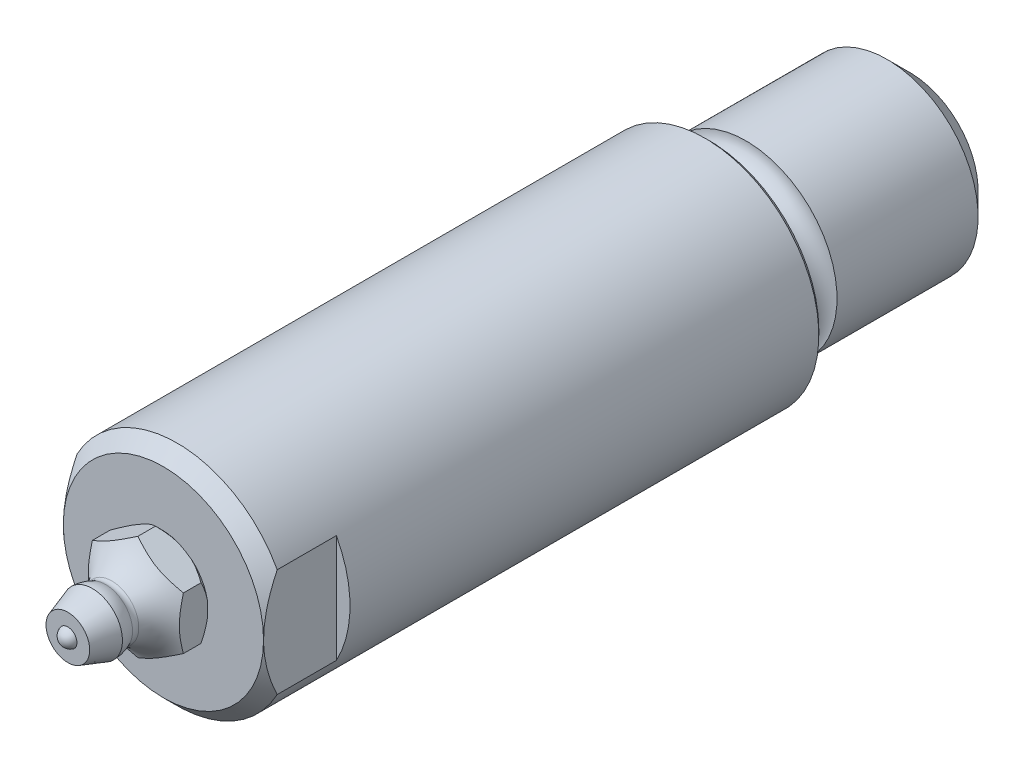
ISO-10303-21;
HEADER;
FILE_DESCRIPTION(('STEP AP214'),'2;1');
FILE_NAME('part.step','',(''),(''),'','','');
FILE_SCHEMA(('AUTOMOTIVE_DESIGN { 1 0 10303 214 1 1 1 1 }'));
ENDSEC;
DATA;
#1=APPLICATION_CONTEXT('core data for automotive mechanical design processes');
#2=APPLICATION_PROTOCOL_DEFINITION('international standard','automotive_design',2000,#1);
#3=PRODUCT_CONTEXT('',#1,'mechanical');
#4=PRODUCT('Part','Part','',(#3));
#5=PRODUCT_RELATED_PRODUCT_CATEGORY('part','',(#4));
#6=PRODUCT_DEFINITION_FORMATION('','',#4);
#7=PRODUCT_DEFINITION_CONTEXT('part definition',#1,'design');
#8=PRODUCT_DEFINITION('design','',#6,#7);
#9=PRODUCT_DEFINITION_SHAPE('','',#8);
#10=(LENGTH_UNIT() NAMED_UNIT(*) SI_UNIT(.MILLI.,.METRE.));
#11=(NAMED_UNIT(*) PLANE_ANGLE_UNIT() SI_UNIT($,.RADIAN.));
#12=(NAMED_UNIT(*) SI_UNIT($,.STERADIAN.) SOLID_ANGLE_UNIT());
#13=UNCERTAINTY_MEASURE_WITH_UNIT(LENGTH_MEASURE(1.E-05),#10,'distance_accuracy_value','');
#14=(GEOMETRIC_REPRESENTATION_CONTEXT(3) GLOBAL_UNCERTAINTY_ASSIGNED_CONTEXT((#13)) GLOBAL_UNIT_ASSIGNED_CONTEXT((#10,
#11,#12)) REPRESENTATION_CONTEXT('',''));
#15=CARTESIAN_POINT('',(0.,0.,0.));
#16=DIRECTION('',(0.,0.,1.));
#17=DIRECTION('',(1.,0.,0.));
#18=AXIS2_PLACEMENT_3D('',#15,#16,#17);
#19=CARTESIAN_POINT('',(0.,0.,58.4999999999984));
#20=DIRECTION('',(0.,0.,-1.));
#21=DIRECTION('',(-1.,0.,0.));
#22=AXIS2_PLACEMENT_3D('',#19,#20,#21);
#23=CONICAL_SURFACE('',#22,12.5,0.785398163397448);
#24=CARTESIAN_POINT('',(-11.,-8.70962839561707,56.969403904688));
#25=CARTESIAN_POINT('',(-11.,-8.49913834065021,57.1000481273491));
#26=CARTESIAN_POINT('',(-11.,-8.28734658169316,57.2286269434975));
#27=CARTESIAN_POINT('',(-11.,-7.86086275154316,57.4809962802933));
#28=CARTESIAN_POINT('',(-11.,-7.64616998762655,57.6047856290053));
#29=CARTESIAN_POINT('',(-11.,-7.21275769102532,57.8473758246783));
#30=CARTESIAN_POINT('',(-11.,-6.99402479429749,57.9661528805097));
#31=CARTESIAN_POINT('',(-11.,-6.55320820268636,58.1972931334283));
#32=CARTESIAN_POINT('',(-11.,-6.33112472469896,58.309656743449));
#33=CARTESIAN_POINT('',(-11.,-5.87852164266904,58.5293526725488));
#34=CARTESIAN_POINT('',(-11.,-5.64792340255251,58.6365241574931));
#35=CARTESIAN_POINT('',(-11.,-5.18279818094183,58.8419642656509));
#36=CARTESIAN_POINT('',(-11.,-4.94827084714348,58.9402320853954));
#37=CARTESIAN_POINT('',(-11.,-4.23935060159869,59.2193485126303));
#38=CARTESIAN_POINT('',(-11.,-3.75868371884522,59.3849756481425));
#39=CARTESIAN_POINT('',(-11.,-2.99638960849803,59.6022244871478));
#40=CARTESIAN_POINT('',(-11.,-2.71987639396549,59.6719947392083));
#41=CARTESIAN_POINT('',(-11.,-2.16269089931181,59.7927115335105));
#42=CARTESIAN_POINT('',(-11.,-1.88201841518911,59.8436571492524));
#43=CARTESIAN_POINT('',(-11.,-1.32033562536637,59.9244948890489));
#44=CARTESIAN_POINT('',(-11.,-1.03935353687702,59.9545812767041));
#45=CARTESIAN_POINT('',(-11.,-0.475898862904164,59.9932988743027));
#46=CARTESIAN_POINT('',(-11.,-0.193426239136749,60.0019295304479));
#47=CARTESIAN_POINT('',(-11.,0.422075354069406,59.9969397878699));
#48=CARTESIAN_POINT('',(-11.,0.755077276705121,59.979046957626));
#49=CARTESIAN_POINT('',(-11.,1.41819757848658,59.9138699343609));
#50=CARTESIAN_POINT('',(-11.,1.74831535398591,59.8665797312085));
#51=CARTESIAN_POINT('',(-11.,2.40778554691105,59.7442899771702));
#52=CARTESIAN_POINT('',(-11.,2.73707131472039,59.6689356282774));
#53=CARTESIAN_POINT('',(-11.,3.38901190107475,59.4940572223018));
#54=CARTESIAN_POINT('',(-11.,3.71166778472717,59.3945370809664));
#55=CARTESIAN_POINT('',(-11.,4.3935915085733,59.1599190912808));
#56=CARTESIAN_POINT('',(-11.,4.75181667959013,59.0218145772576));
#57=CARTESIAN_POINT('',(-11.,5.45924689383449,58.7239936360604));
#58=CARTESIAN_POINT('',(-11.,5.80844773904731,58.5642673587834));
#59=CARTESIAN_POINT('',(-11.,6.49943270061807,58.2269262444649));
#60=CARTESIAN_POINT('',(-11.,6.84118915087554,58.0492551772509));
#61=CARTESIAN_POINT('',(-11.,7.51694097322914,57.679926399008));
#62=CARTESIAN_POINT('',(-11.,7.85093752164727,57.4882708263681));
#63=CARTESIAN_POINT('',(-11.,8.4982672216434,57.1019431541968));
#64=CARTESIAN_POINT('',(-11.,8.8118791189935,56.9077356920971));
#65=CARTESIAN_POINT('',(-11.,9.43367796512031,56.5107956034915));
#66=CARTESIAN_POINT('',(-11.,9.74186448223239,56.3080623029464));
#67=CARTESIAN_POINT('',(-11.,10.3510240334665,55.8972373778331));
#68=CARTESIAN_POINT('',(-11.,10.6520351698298,55.6892020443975));
#69=CARTESIAN_POINT('',(-11.,11.2498768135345,55.2673808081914));
#70=CARTESIAN_POINT('',(-11.,11.5467084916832,55.0535965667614));
#71=CARTESIAN_POINT('',(-11.,11.8417833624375,54.8374558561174));
#72=B_SPLINE_CURVE_WITH_KNOTS('',3,(#24,#25,#26,#27,#28,#29,#30,#31,#32,#33,#34,#35,#36,#37,#38,
#39,#40,#41,#42,#43,#44,#45,#46,#47,#48,#49,#50,#51,#52,#53,#54,#55,#56,#57,#58,#59,#60,#61,#62,
#63,#64,#65,#66,#67,#68,#69,#70,#71),.UNSPECIFIED.,.F.,.F.,(4,2,2,2,2,2,2,2,2,2,2,2,2,2,2,2,2,2,
2,2,2,2,2,4),(0.,0.743225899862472,1.48663252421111,2.23324214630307,2.97980364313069,
3.74247076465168,4.50520664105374,6.02755119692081,6.88255851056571,7.73760789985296,
8.58458312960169,9.43158022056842,10.4306228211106,11.4298697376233,12.442203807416,
13.4543739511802,14.6052617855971,15.7566756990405,16.9118166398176,18.0667813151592,
19.1732457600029,20.279797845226,21.3774397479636,22.47476778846),.UNSPECIFIED.);
#73=CARTESIAN_POINT('',(-11.,-5.93717104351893,58.4999999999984));
#74=VERTEX_POINT('',#73);
#75=CARTESIAN_POINT('',(-11.,0.,60.));
#76=VERTEX_POINT('',#75);
#77=EDGE_CURVE('E29',#74,#76,#72,.T.);
#78=ORIENTED_EDGE('',*,*,#77,.F.);
#79=CARTESIAN_POINT('',(0.,0.,58.4999999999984));
#80=DIRECTION('',(0.,0.,-1.));
#81=DIRECTION('',(-1.,0.,0.));
#82=AXIS2_PLACEMENT_3D('',#79,#80,#81);
#83=CIRCLE('',#82,12.5);
#84=CARTESIAN_POINT('',(11.,-5.93717104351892,58.4999999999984));
#85=VERTEX_POINT('',#84);
#86=EDGE_CURVE('E149',#85,#74,#83,.T.);
#87=ORIENTED_EDGE('',*,*,#86,.F.);
#88=CARTESIAN_POINT('',(11.,-8.70962839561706,56.969403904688));
#89=CARTESIAN_POINT('',(11.,-8.49913834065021,57.1000481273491));
#90=CARTESIAN_POINT('',(11.,-8.28734658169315,57.2286269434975));
#91=CARTESIAN_POINT('',(11.,-7.86086275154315,57.4809962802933));
#92=CARTESIAN_POINT('',(11.,-7.64616998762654,57.6047856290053));
#93=CARTESIAN_POINT('',(11.,-7.21275769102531,57.8473758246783));
#94=CARTESIAN_POINT('',(11.,-6.99402479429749,57.9661528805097));
#95=CARTESIAN_POINT('',(11.,-6.55320820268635,58.1972931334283));
#96=CARTESIAN_POINT('',(11.,-6.33112472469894,58.309656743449));
#97=CARTESIAN_POINT('',(11.,-5.87852164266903,58.5293526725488));
#98=CARTESIAN_POINT('',(11.,-5.6479234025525,58.6365241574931));
#99=CARTESIAN_POINT('',(11.,-5.18279818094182,58.8419642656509));
#100=CARTESIAN_POINT('',(11.,-4.94827084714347,58.9402320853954));
#101=CARTESIAN_POINT('',(11.,-4.23935060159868,59.2193485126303));
#102=CARTESIAN_POINT('',(11.,-3.75868371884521,59.3849756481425));
#103=CARTESIAN_POINT('',(11.,-2.99638960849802,59.6022244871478));
#104=CARTESIAN_POINT('',(11.,-2.71987639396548,59.6719947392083));
#105=CARTESIAN_POINT('',(11.,-2.1626908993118,59.7927115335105));
#106=CARTESIAN_POINT('',(11.,-1.8820184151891,59.8436571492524));
#107=CARTESIAN_POINT('',(11.,-1.32033562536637,59.9244948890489));
#108=CARTESIAN_POINT('',(11.,-1.03935353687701,59.9545812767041));
#109=CARTESIAN_POINT('',(11.,-0.475898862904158,59.9932988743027));
#110=CARTESIAN_POINT('',(11.,-0.193426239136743,60.0019295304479));
#111=CARTESIAN_POINT('',(11.,0.422075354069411,59.9969397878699));
#112=CARTESIAN_POINT('',(11.,0.755077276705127,59.979046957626));
#113=CARTESIAN_POINT('',(11.,1.41819757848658,59.9138699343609));
#114=CARTESIAN_POINT('',(11.,1.74831535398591,59.8665797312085));
#115=CARTESIAN_POINT('',(11.,2.40778554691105,59.7442899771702));
#116=CARTESIAN_POINT('',(11.,2.73707131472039,59.6689356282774));
#117=CARTESIAN_POINT('',(11.,3.38901190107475,59.4940572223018));
#118=CARTESIAN_POINT('',(11.,3.71166778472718,59.3945370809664));
#119=CARTESIAN_POINT('',(11.,4.3935915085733,59.1599190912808));
#120=CARTESIAN_POINT('',(11.,4.75181667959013,59.0218145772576));
#121=CARTESIAN_POINT('',(11.,5.45924689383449,58.7239936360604));
#122=CARTESIAN_POINT('',(11.,5.80844773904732,58.5642673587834));
#123=CARTESIAN_POINT('',(11.,6.49943270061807,58.2269262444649));
#124=CARTESIAN_POINT('',(11.,6.84118915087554,58.0492551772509));
#125=CARTESIAN_POINT('',(11.,7.51694097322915,57.679926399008));
#126=CARTESIAN_POINT('',(11.,7.85093752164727,57.4882708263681));
#127=CARTESIAN_POINT('',(11.,8.4982672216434,57.1019431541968));
#128=CARTESIAN_POINT('',(11.,8.8118791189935,56.9077356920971));
#129=CARTESIAN_POINT('',(11.,9.43367796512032,56.5107956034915));
#130=CARTESIAN_POINT('',(11.,9.74186448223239,56.3080623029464));
#131=CARTESIAN_POINT('',(11.,10.3510240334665,55.8972373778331));
#132=CARTESIAN_POINT('',(11.,10.6520351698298,55.6892020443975));
#133=CARTESIAN_POINT('',(11.,11.2498768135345,55.2673808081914));
#134=CARTESIAN_POINT('',(11.,11.5467084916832,55.0535965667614));
#135=CARTESIAN_POINT('',(11.,11.8417833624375,54.8374558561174));
#136=B_SPLINE_CURVE_WITH_KNOTS('',3,(#88,#89,#90,#91,#92,#93,#94,#95,#96,#97,#98,#99,#100,#101,
#102,#103,#104,#105,#106,#107,#108,#109,#110,#111,#112,#113,#114,#115,#116,#117,#118,#119,#120,
#121,#122,#123,#124,#125,#126,#127,#128,#129,#130,#131,#132,#133,#134,#135),.UNSPECIFIED.,.F.,
.F.,(4,2,2,2,2,2,2,2,2,2,2,2,2,2,2,2,2,2,2,2,2,2,2,4),(0.,0.743225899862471,1.48663252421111,
2.23324214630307,2.9798036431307,3.74247076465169,4.50520664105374,6.02755119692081,
6.88255851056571,7.73760789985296,8.58458312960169,9.43158022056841,10.4306228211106,
11.4298697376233,12.442203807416,13.4543739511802,14.6052617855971,15.7566756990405,
16.9118166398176,18.0667813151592,19.1732457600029,20.279797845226,21.3774397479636,
22.47476778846),.UNSPECIFIED.);
#137=CARTESIAN_POINT('',(11.,0.,60.));
#138=VERTEX_POINT('',#137);
#139=EDGE_CURVE('E153',#138,#85,#136,.F.);
#140=ORIENTED_EDGE('',*,*,#139,.F.);
#141=CARTESIAN_POINT('',(0.,0.,60.));
#142=DIRECTION('',(0.,0.,-1.));
#143=DIRECTION('',(-1.,0.,0.));
#144=AXIS2_PLACEMENT_3D('',#141,#142,#143);
#145=CIRCLE('',#144,10.9999999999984);
#146=EDGE_CURVE('E213',#138,#76,#145,.T.);
#147=ORIENTED_EDGE('',*,*,#146,.T.);
#148=EDGE_LOOP('',(#78,#87,#140,#147));
#149=FACE_BOUND('',#148,.T.);
#150=ADVANCED_FACE('F14',(#149),#23,.T.);
#151=CARTESIAN_POINT('',(0.,0.,60.1858925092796));
#152=DIRECTION('',(0.,0.,1.));
#153=DIRECTION('',(1.,0.,0.));
#154=AXIS2_PLACEMENT_3D('',#151,#152,#153);
#155=CONICAL_SURFACE('',#154,5.08589250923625,0.785398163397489);
#156=CARTESIAN_POINT('',(8.48878292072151,0.8725015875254,63.6335042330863));
#157=CARTESIAN_POINT('',(8.3702601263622,0.940930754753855,63.5226121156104));
#158=CARTESIAN_POINT('',(8.25126667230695,1.00963165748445,63.4123846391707));
#159=CARTESIAN_POINT('',(8.01217528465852,1.1476711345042,63.1935136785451));
#160=CARTESIAN_POINT('',(7.89207725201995,1.21700976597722,63.084870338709));
#161=CARTESIAN_POINT('',(7.65034767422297,1.3565724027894,62.8691862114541));
#162=CARTESIAN_POINT('',(7.52871315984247,1.42679812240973,62.7621498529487));
#163=CARTESIAN_POINT('',(7.28400722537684,1.56807915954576,62.5502945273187));
#164=CARTESIAN_POINT('',(7.16093584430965,1.63913445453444,62.4454755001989));
#165=CARTESIAN_POINT('',(6.90970134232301,1.78418476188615,62.2356134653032));
#166=CARTESIAN_POINT('',(6.78149161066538,1.85820668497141,62.1306446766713));
#167=CARTESIAN_POINT('',(6.52304417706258,2.00742138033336,61.9240928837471));
#168=CARTESIAN_POINT('',(6.39280655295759,2.08261410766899,61.822509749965));
#169=CARTESIAN_POINT('',(6.13008485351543,2.23429655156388,61.6235661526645));
#170=CARTESIAN_POINT('',(5.99760279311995,2.310785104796,61.5262021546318));
#171=CARTESIAN_POINT('',(5.72993169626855,2.46532508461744,61.3365895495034));
#172=CARTESIAN_POINT('',(5.59474300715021,2.54337631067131,61.2443402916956));
#173=CARTESIAN_POINT('',(5.31798007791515,2.70316546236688,61.0640747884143));
#174=CARTESIAN_POINT('',(5.17633043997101,2.78494691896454,60.9762118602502));
#175=CARTESIAN_POINT('',(4.88930478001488,2.95066126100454,60.8088739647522));
#176=CARTESIAN_POINT('',(4.74392823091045,3.03459445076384,60.7294001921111));
#177=CARTESIAN_POINT('',(4.4499299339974,3.20433444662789,60.5814621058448));
#178=CARTESIAN_POINT('',(4.30133007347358,3.29012861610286,60.5129403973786));
#179=CARTESIAN_POINT('',(4.00005645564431,3.46406902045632,60.3890315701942));
#180=CARTESIAN_POINT('',(3.8473839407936,3.55221453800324,60.3336404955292));
#181=CARTESIAN_POINT('',(3.56845756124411,3.71325275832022,60.2481027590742));
#182=CARTESIAN_POINT('',(3.44285507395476,3.78576938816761,60.2151399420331));
#183=CARTESIAN_POINT('',(3.18974736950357,3.93190118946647,60.16100148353));
#184=CARTESIAN_POINT('',(3.06224243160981,4.00551619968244,60.1398241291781));
#185=CARTESIAN_POINT('',(2.80633076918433,4.15326686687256,60.1103446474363));
#186=CARTESIAN_POINT('',(2.67792601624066,4.22740138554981,60.1020200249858));
#187=CARTESIAN_POINT('',(2.42098143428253,4.37574840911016,60.0986321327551));
#188=CARTESIAN_POINT('',(2.29244160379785,4.44996091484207,60.103569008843));
#189=CARTESIAN_POINT('',(2.03658951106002,4.59767718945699,60.1263993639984));
#190=CARTESIAN_POINT('',(1.9092748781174,4.67118232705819,60.1442579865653));
#191=CARTESIAN_POINT('',(1.65633793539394,4.81721553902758,60.1919784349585));
#192=CARTESIAN_POINT('',(1.53071603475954,4.88974337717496,60.2218431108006));
#193=CARTESIAN_POINT('',(1.28139543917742,5.03368869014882,60.2923449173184));
#194=CARTESIAN_POINT('',(1.15770350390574,5.10510226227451,60.3330135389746));
#195=CARTESIAN_POINT('',(0.912917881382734,5.24642930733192,60.4235805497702));
#196=CARTESIAN_POINT('',(0.791824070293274,5.31634285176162,60.4734784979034));
#197=CARTESIAN_POINT('',(0.509345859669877,5.47943172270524,60.6003291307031));
#198=CARTESIAN_POINT('',(0.349072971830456,5.57196531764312,60.6805693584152));
#199=CARTESIAN_POINT('',(0.0330607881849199,5.75441503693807,60.8522554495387));
#200=CARTESIAN_POINT('',(-0.122676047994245,5.84432974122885,60.9437072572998));
#201=CARTESIAN_POINT('',(-0.430382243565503,6.02198399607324,61.1354877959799));
#202=CARTESIAN_POINT('',(-0.582343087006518,6.10971862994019,61.2358346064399));
#203=CARTESIAN_POINT('',(-0.882693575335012,6.28312606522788,61.4433052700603));
#204=CARTESIAN_POINT('',(-1.03108384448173,6.36879922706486,61.5504279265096));
#205=CARTESIAN_POINT('',(-1.32552547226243,6.53879518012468,61.7705324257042));
#206=CARTESIAN_POINT('',(-1.47156290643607,6.62310993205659,61.8835389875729));
#207=CARTESIAN_POINT('',(-1.76106506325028,6.79025408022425,62.1138599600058));
#208=CARTESIAN_POINT('',(-1.90452969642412,6.87308342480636,62.2311745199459));
#209=CARTESIAN_POINT('',(-2.18912370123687,7.03739385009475,62.4691487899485));
#210=CARTESIAN_POINT('',(-2.33025539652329,7.11887627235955,62.589804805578));
#211=CARTESIAN_POINT('',(-2.61067033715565,7.28077391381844,62.8339487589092));
#212=CARTESIAN_POINT('',(-2.74995354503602,7.36118911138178,62.9574367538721));
#213=CARTESIAN_POINT('',(-2.98949671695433,7.49948942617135,63.1730472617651));
#214=CARTESIAN_POINT('',(-3.09012637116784,7.55758798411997,63.2646236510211));
#215=CARTESIAN_POINT('',(-3.2902065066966,7.67310430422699,63.4484812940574));
#216=CARTESIAN_POINT('',(-3.38966017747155,7.73052390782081,63.5407579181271));
#217=CARTESIAN_POINT('',(-3.4887829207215,7.78775245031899,63.6335042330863));
#218=B_SPLINE_CURVE_WITH_KNOTS('',3,(#156,#157,#158,#159,#160,#161,#162,#163,#164,#165,#166,
#167,#168,#169,#170,#171,#172,#173,#174,#175,#176,#177,#178,#179,#180,#181,#182,#183,#184,#185,
#186,#187,#188,#189,#190,#191,#192,#193,#194,#195,#196,#197,#198,#199,#200,#201,#202,#203,#204,
#205,#206,#207,#208,#209,#210,#211,#212,#213,#214,#215,#216,#217),.UNSPECIFIED.,.F.,.F.,(4,2,2,
2,2,2,2,2,2,2,2,2,2,2,2,2,2,2,2,2,2,2,2,2,2,2,2,2,2,2,4),(0.,0.528440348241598,1.05692855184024,
1.58667441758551,2.1164059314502,2.66081070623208,3.2051946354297,3.7491133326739,
4.2929626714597,4.84977566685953,5.40666785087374,5.96053848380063,6.51424203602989,
6.96001282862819,7.40571881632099,7.85064383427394,8.29557374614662,8.73930790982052,
9.18314747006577,9.62829518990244,10.0734216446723,10.6780535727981,11.2830074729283,
11.8892204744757,12.495326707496,13.1042252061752,13.7131448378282,14.3214161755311,
14.9296998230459,15.3735313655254,15.8154826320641),.UNSPECIFIED.);
#219=CARTESIAN_POINT('',(1.69394357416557,4.79550391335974,60.1858925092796));
#220=VERTEX_POINT('',#219);
#221=CARTESIAN_POINT('',(0.,5.77350269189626,60.873502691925));
#222=VERTEX_POINT('',#221);
#223=EDGE_CURVE('E419',#220,#222,#218,.T.);
#224=ORIENTED_EDGE('',*,*,#223,.F.);
#225=CARTESIAN_POINT('',(0.,0.,60.1858925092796));
#226=DIRECTION('',(0.,0.,-1.));
#227=DIRECTION('',(-1.,0.,0.));
#228=AXIS2_PLACEMENT_3D('',#225,#226,#227);
#229=CIRCLE('',#228,5.08589250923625);
#230=CARTESIAN_POINT('',(-1.69394357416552,4.79550391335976,60.1858925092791));
#231=VERTEX_POINT('',#230);
#232=EDGE_CURVE('E382',#231,#220,#229,.T.);
#233=ORIENTED_EDGE('',*,*,#232,.F.);
#234=CARTESIAN_POINT('',(3.4887829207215,7.78775245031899,63.6335042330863));
#235=CARTESIAN_POINT('',(3.37026012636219,7.71932328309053,63.5226121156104));
#236=CARTESIAN_POINT('',(3.25126667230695,7.65062238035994,63.4123846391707));
#237=CARTESIAN_POINT('',(3.01217528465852,7.51258290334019,63.1935136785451));
#238=CARTESIAN_POINT('',(2.89207725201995,7.44324427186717,63.084870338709));
#239=CARTESIAN_POINT('',(2.65034767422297,7.30368163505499,62.8691862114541));
#240=CARTESIAN_POINT('',(2.52871315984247,7.23345591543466,62.7621498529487));
#241=CARTESIAN_POINT('',(2.28400722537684,7.09217487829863,62.5502945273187));
#242=CARTESIAN_POINT('',(2.16093584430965,7.02111958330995,62.4454755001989));
#243=CARTESIAN_POINT('',(1.90970134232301,6.87606927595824,62.2356134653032));
#244=CARTESIAN_POINT('',(1.78149161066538,6.80204735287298,62.1306446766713));
#245=CARTESIAN_POINT('',(1.52304417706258,6.65283265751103,61.9240928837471));
#246=CARTESIAN_POINT('',(1.39280655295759,6.5776399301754,61.822509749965));
#247=CARTESIAN_POINT('',(1.13008485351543,6.42595748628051,61.6235661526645));
#248=CARTESIAN_POINT('',(0.997602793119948,6.34946893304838,61.5262021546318));
#249=CARTESIAN_POINT('',(0.729931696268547,6.19492895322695,61.3365895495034));
#250=CARTESIAN_POINT('',(0.594743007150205,6.11687772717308,61.2443402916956));
#251=CARTESIAN_POINT('',(0.317980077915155,5.95708857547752,61.0640747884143));
#252=CARTESIAN_POINT('',(0.176330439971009,5.87530711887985,60.9762118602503));
#253=CARTESIAN_POINT('',(-0.11069521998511,5.70959277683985,60.8088739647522));
#254=CARTESIAN_POINT('',(-0.256071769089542,5.62565958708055,60.7294001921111));
#255=CARTESIAN_POINT('',(-0.550070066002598,5.4559195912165,60.5814621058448));
#256=CARTESIAN_POINT('',(-0.698669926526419,5.37012542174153,60.5129403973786));
#257=CARTESIAN_POINT('',(-0.999943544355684,5.19618501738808,60.3890315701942));
#258=CARTESIAN_POINT('',(-1.1526160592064,5.10803949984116,60.3336404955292));
#259=CARTESIAN_POINT('',(-1.43154243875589,4.94700127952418,60.2481027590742));
#260=CARTESIAN_POINT('',(-1.55714492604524,4.87448464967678,60.2151399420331));
#261=CARTESIAN_POINT('',(-1.81025263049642,4.72835284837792,60.16100148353));
#262=CARTESIAN_POINT('',(-1.93775756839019,4.65473783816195,60.1398241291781));
#263=CARTESIAN_POINT('',(-2.19366923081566,4.50698717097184,60.1103446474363));
#264=CARTESIAN_POINT('',(-2.32207398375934,4.43285265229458,60.1020200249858));
#265=CARTESIAN_POINT('',(-2.57901856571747,4.28450562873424,60.0986321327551));
#266=CARTESIAN_POINT('',(-2.70755839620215,4.21029312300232,60.103569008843));
#267=CARTESIAN_POINT('',(-2.96341048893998,4.06257684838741,60.1263993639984));
#268=CARTESIAN_POINT('',(-3.0907251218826,3.9890717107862,60.1442579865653));
#269=CARTESIAN_POINT('',(-3.34366206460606,3.84303849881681,60.1919784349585));
#270=CARTESIAN_POINT('',(-3.46928396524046,3.77051066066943,60.2218431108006));
#271=CARTESIAN_POINT('',(-3.71860456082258,3.62656534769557,60.2923449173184));
#272=CARTESIAN_POINT('',(-3.84229649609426,3.55515177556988,60.3330135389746));
#273=CARTESIAN_POINT('',(-4.08708211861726,3.41382473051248,60.4235805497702));
#274=CARTESIAN_POINT('',(-4.20817592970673,3.34391118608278,60.4734784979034));
#275=CARTESIAN_POINT('',(-4.49065414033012,3.18082231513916,60.6003291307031));
#276=CARTESIAN_POINT('',(-4.65092702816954,3.08828872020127,60.6805693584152));
#277=CARTESIAN_POINT('',(-4.96693921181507,2.90583900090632,60.8522554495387));
#278=CARTESIAN_POINT('',(-5.12267604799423,2.81592429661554,60.9437072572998));
#279=CARTESIAN_POINT('',(-5.43038224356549,2.63827004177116,61.1354877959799));
#280=CARTESIAN_POINT('',(-5.58234308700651,2.55053540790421,61.2358346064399));
#281=CARTESIAN_POINT('',(-5.882693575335,2.37712797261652,61.4433052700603));
#282=CARTESIAN_POINT('',(-6.03108384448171,2.29145481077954,61.5504279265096));
#283=CARTESIAN_POINT('',(-6.32552547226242,2.12145885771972,61.7705324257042));
#284=CARTESIAN_POINT('',(-6.47156290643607,2.0371441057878,61.8835389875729));
#285=CARTESIAN_POINT('',(-6.76106506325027,1.86999995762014,62.1138599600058));
#286=CARTESIAN_POINT('',(-6.90452969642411,1.78717061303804,62.2311745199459));
#287=CARTESIAN_POINT('',(-7.18912370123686,1.62286018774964,62.4691487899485));
#288=CARTESIAN_POINT('',(-7.33025539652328,1.54137776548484,62.589804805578));
#289=CARTESIAN_POINT('',(-7.61067033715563,1.37948012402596,62.8339487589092));
#290=CARTESIAN_POINT('',(-7.749953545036,1.29906492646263,62.9574367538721));
#291=CARTESIAN_POINT('',(-7.98949671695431,1.16076461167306,63.1730472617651));
#292=CARTESIAN_POINT('',(-8.09012637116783,1.10266605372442,63.2646236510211));
#293=CARTESIAN_POINT('',(-8.2902065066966,0.987149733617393,63.4484812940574));
#294=CARTESIAN_POINT('',(-8.38966017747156,0.929730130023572,63.5407579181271));
#295=CARTESIAN_POINT('',(-8.48878292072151,0.872501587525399,63.6335042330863));
#296=B_SPLINE_CURVE_WITH_KNOTS('',3,(#234,#235,#236,#237,#238,#239,#240,#241,#242,#243,#244,
#245,#246,#247,#248,#249,#250,#251,#252,#253,#254,#255,#256,#257,#258,#259,#260,#261,#262,#263,
#264,#265,#266,#267,#268,#269,#270,#271,#272,#273,#274,#275,#276,#277,#278,#279,#280,#281,#282,
#283,#284,#285,#286,#287,#288,#289,#290,#291,#292,#293,#294,#295),.UNSPECIFIED.,.F.,.F.,(4,2,2,
2,2,2,2,2,2,2,2,2,2,2,2,2,2,2,2,2,2,2,2,2,2,2,2,2,2,2,4),(0.,0.528440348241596,1.05692855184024,
1.58667441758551,2.11640593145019,2.66081070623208,3.2051946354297,3.7491133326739,
4.29296267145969,4.84977566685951,5.40666785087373,5.96053848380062,6.51424203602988,
6.96001282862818,7.40571881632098,7.85064383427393,8.29557374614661,8.73930790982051,
9.18314747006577,9.62829518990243,10.0734216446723,10.6780535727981,11.2830074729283,
11.8892204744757,12.495326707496,13.1042252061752,13.7131448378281,14.321416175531,
14.9296998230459,15.3735313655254,15.8154826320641),.UNSPECIFIED.);
#297=EDGE_CURVE('E325',#222,#231,#296,.T.);
#298=ORIENTED_EDGE('',*,*,#297,.F.);
#299=EDGE_LOOP('',(#224,#233,#298));
#300=FACE_BOUND('',#299,.T.);
#301=ADVANCED_FACE('F200',(#300),#155,.T.);
#302=CARTESIAN_POINT('',(-3.30605642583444,3.86475012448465,60.1858925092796));
#303=VERTEX_POINT('',#302);
#304=CARTESIAN_POINT('',(-5.,2.88675134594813,60.873502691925));
#305=VERTEX_POINT('',#304);
#306=EDGE_CURVE('E316',#303,#305,#296,.T.);
#307=ORIENTED_EDGE('',*,*,#306,.F.);
#308=CARTESIAN_POINT('',(-5.,0.930753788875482,60.1858925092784));
#309=VERTEX_POINT('',#308);
#310=EDGE_CURVE('E380',#309,#303,#229,.T.);
#311=ORIENTED_EDGE('',*,*,#310,.F.);
#312=CARTESIAN_POINT('',(-5.,6.37553426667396,63.2023106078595));
#313=CARTESIAN_POINT('',(-5.,6.23261652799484,63.0898716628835));
#314=CARTESIAN_POINT('',(-5.,6.08901235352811,62.9782940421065));
#315=CARTESIAN_POINT('',(-5.,5.80016557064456,62.7572314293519));
#316=CARTESIAN_POINT('',(-5.,5.65492269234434,62.6477467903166));
#317=CARTESIAN_POINT('',(-5.,5.36184089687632,62.4307302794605));
#318=CARTESIAN_POINT('',(-5.,5.21399256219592,62.3232110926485));
#319=CARTESIAN_POINT('',(-5.,4.91612654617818,62.1112299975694));
#320=CARTESIAN_POINT('',(-5.,4.7661089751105,62.006767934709));
#321=CARTESIAN_POINT('',(-5.,4.45606019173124,61.7964806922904));
#322=CARTESIAN_POINT('',(-5.,4.29590078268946,61.6908438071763));
#323=CARTESIAN_POINT('',(-5.,3.97230809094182,61.4846437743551));
#324=CARTESIAN_POINT('',(-5.,3.80887444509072,61.3840811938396));
#325=CARTESIAN_POINT('',(-5.,3.47854729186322,61.1895405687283));
#326=CARTESIAN_POINT('',(-5.,3.31166125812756,61.0955499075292));
#327=CARTESIAN_POINT('',(-5.,2.97361075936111,60.9156585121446));
#328=CARTESIAN_POINT('',(-5.,2.80244762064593,60.829755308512));
#329=CARTESIAN_POINT('',(-5.,2.47330037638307,60.6765818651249));
#330=CARTESIAN_POINT('',(-5.,2.31578903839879,60.6083032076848));
#331=CARTESIAN_POINT('',(-5.,1.99666642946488,60.4819342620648));
#332=CARTESIAN_POINT('',(-5.,1.83505476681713,60.4238449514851));
#333=CARTESIAN_POINT('',(-5.,1.50971772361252,60.3207033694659));
#334=CARTESIAN_POINT('',(-5.,1.34603812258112,60.275508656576));
#335=CARTESIAN_POINT('',(-5.,1.01533762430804,60.1995142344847));
#336=CARTESIAN_POINT('',(-5.,0.848317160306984,60.1687126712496));
#337=CARTESIAN_POINT('',(-5.,0.508911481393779,60.1229701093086));
#338=CARTESIAN_POINT('',(-5.,0.336484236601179,60.1083342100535));
#339=CARTESIAN_POINT('',(-5.,-0.00895458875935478,60.0970281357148));
#340=CARTESIAN_POINT('',(-5.,-0.181966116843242,60.1003563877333));
#341=CARTESIAN_POINT('',(-5.,-0.527237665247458,60.1247605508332));
#342=CARTESIAN_POINT('',(-5.,-0.699493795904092,60.1458904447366));
#343=CARTESIAN_POINT('',(-5.,-1.0411898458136,60.2044779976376));
#344=CARTESIAN_POINT('',(-5.,-1.21062899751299,60.2419400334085));
#345=CARTESIAN_POINT('',(-5.,-1.59762700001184,60.3447720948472));
#346=CARTESIAN_POINT('',(-5.,-1.81383292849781,60.415192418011));
#347=CARTESIAN_POINT('',(-5.,-2.2391129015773,60.5749127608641));
#348=CARTESIAN_POINT('',(-5.,-2.44818257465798,60.6642241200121));
#349=CARTESIAN_POINT('',(-5.,-2.86105076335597,60.8577879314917));
#350=CARTESIAN_POINT('',(-5.,-3.06479988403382,60.9621443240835));
#351=CARTESIAN_POINT('',(-5.,-3.46625569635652,61.1816694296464));
#352=CARTESIAN_POINT('',(-5.,-3.66396378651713,61.2968356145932));
#353=CARTESIAN_POINT('',(-5.,-4.08118718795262,61.5517574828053));
#354=CARTESIAN_POINT('',(-5.,-4.29996225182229,61.6927166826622));
#355=CARTESIAN_POINT('',(-5.,-4.73227138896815,61.982491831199));
#356=CARTESIAN_POINT('',(-5.,-4.94580430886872,62.1313094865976));
#357=CARTESIAN_POINT('',(-5.,-5.36392250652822,62.4315055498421));
#358=CARTESIAN_POINT('',(-5.,-5.5686012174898,62.5827543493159));
#359=CARTESIAN_POINT('',(-5.,-5.87304874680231,62.8128664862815));
#360=CARTESIAN_POINT('',(-5.,-5.9740691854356,62.8900837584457));
#361=CARTESIAN_POINT('',(-5.,-6.17535077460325,63.0454939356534));
#362=CARTESIAN_POINT('',(-5.,-6.27561195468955,63.1236868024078));
#363=CARTESIAN_POINT('',(-5.,-6.37553426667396,63.2023106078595));
#364=B_SPLINE_CURVE_WITH_KNOTS('',3,(#312,#313,#314,#315,#316,#317,#318,#319,#320,#321,#322,
#323,#324,#325,#326,#327,#328,#329,#330,#331,#332,#333,#334,#335,#336,#337,#338,#339,#340,#341,
#342,#343,#344,#345,#346,#347,#348,#349,#350,#351,#352,#353,#354,#355,#356,#357,#358,#359,#360,
#361,#362,#363),.UNSPECIFIED.,.F.,.F.,(4,2,2,2,2,2,2,2,2,2,2,2,2,2,2,2,2,2,2,2,2,2,2,2,2,4),(0.,
0.545545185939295,1.09118157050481,1.63957901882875,2.18794868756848,2.76345108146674,
3.33901766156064,3.91344708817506,4.48770054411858,5.00243485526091,5.51721852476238,
6.0260734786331,6.53486286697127,7.05309888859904,7.57128953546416,8.09105725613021,
8.61096435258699,9.29192318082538,9.97329192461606,10.6596161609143,11.3457802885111,
12.1263092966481,12.9070085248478,13.6704259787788,14.051877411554,14.4333139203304),.UNSPECIFIED.);
#365=EDGE_CURVE('E324',#305,#309,#364,.T.);
#366=ORIENTED_EDGE('',*,*,#365,.F.);
#367=EDGE_LOOP('',(#307,#311,#366));
#368=FACE_BOUND('',#367,.T.);
#369=ADVANCED_FACE('F206',(#368),#155,.T.);
#370=CARTESIAN_POINT('',(-5.,-0.930753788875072,60.1858925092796));
#371=VERTEX_POINT('',#370);
#372=CARTESIAN_POINT('',(-5.,-2.88675134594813,60.873502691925));
#373=VERTEX_POINT('',#372);
#374=EDGE_CURVE('E308',#371,#373,#364,.T.);
#375=ORIENTED_EDGE('',*,*,#374,.F.);
#376=CARTESIAN_POINT('',(-3.30605642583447,-3.86475012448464,60.1858925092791));
#377=VERTEX_POINT('',#376);
#378=EDGE_CURVE('E383',#377,#371,#229,.T.);
#379=ORIENTED_EDGE('',*,*,#378,.F.);
#380=CARTESIAN_POINT('',(-8.48878292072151,-0.8725015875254,63.6335042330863));
#381=CARTESIAN_POINT('',(-8.3702601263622,-0.940930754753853,63.5226121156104));
#382=CARTESIAN_POINT('',(-8.25126667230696,-1.00963165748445,63.4123846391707));
#383=CARTESIAN_POINT('',(-8.01217528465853,-1.14767113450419,63.1935136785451));
#384=CARTESIAN_POINT('',(-7.89207725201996,-1.21700976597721,63.084870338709));
#385=CARTESIAN_POINT('',(-7.65034767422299,-1.35657240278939,62.8691862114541));
#386=CARTESIAN_POINT('',(-7.52871315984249,-1.42679812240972,62.7621498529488));
#387=CARTESIAN_POINT('',(-7.28400722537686,-1.56807915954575,62.5502945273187));
#388=CARTESIAN_POINT('',(-7.16093584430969,-1.63913445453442,62.4454755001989));
#389=CARTESIAN_POINT('',(-6.90970134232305,-1.78418476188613,62.2356134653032));
#390=CARTESIAN_POINT('',(-6.78149161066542,-1.85820668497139,62.1306446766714));
#391=CARTESIAN_POINT('',(-6.52304417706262,-2.00742138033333,61.9240928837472));
#392=CARTESIAN_POINT('',(-6.39280655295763,-2.08261410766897,61.822509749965));
#393=CARTESIAN_POINT('',(-6.13008485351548,-2.23429655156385,61.6235661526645));
#394=CARTESIAN_POINT('',(-5.99760279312,-2.31078510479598,61.5262021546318));
#395=CARTESIAN_POINT('',(-5.72993169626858,-2.46532508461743,61.3365895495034));
#396=CARTESIAN_POINT('',(-5.59474300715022,-2.54337631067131,61.2443402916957));
#397=CARTESIAN_POINT('',(-5.31798007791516,-2.70316546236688,61.0640747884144));
#398=CARTESIAN_POINT('',(-5.17633043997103,-2.78494691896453,60.9762118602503));
#399=CARTESIAN_POINT('',(-4.88930478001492,-2.95066126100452,60.8088739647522));
#400=CARTESIAN_POINT('',(-4.74392823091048,-3.03459445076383,60.7294001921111));
#401=CARTESIAN_POINT('',(-4.44992993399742,-3.20433444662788,60.5814621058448));
#402=CARTESIAN_POINT('',(-4.30133007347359,-3.29012861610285,60.5129403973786));
#403=CARTESIAN_POINT('',(-4.00005645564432,-3.46406902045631,60.3890315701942));
#404=CARTESIAN_POINT('',(-3.8473839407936,-3.55221453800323,60.3336404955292));
#405=CARTESIAN_POINT('',(-3.56845756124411,-3.71325275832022,60.2481027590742));
#406=CARTESIAN_POINT('',(-3.44285507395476,-3.78576938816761,60.2151399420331));
#407=CARTESIAN_POINT('',(-3.18974736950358,-3.93190118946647,60.16100148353));
#408=CARTESIAN_POINT('',(-3.06224243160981,-4.00551619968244,60.1398241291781));
#409=CARTESIAN_POINT('',(-2.80633076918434,-4.15326686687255,60.1103446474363));
#410=CARTESIAN_POINT('',(-2.67792601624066,-4.22740138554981,60.1020200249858));
#411=CARTESIAN_POINT('',(-2.42098143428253,-4.37574840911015,60.0986321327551));
#412=CARTESIAN_POINT('',(-2.29244160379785,-4.44996091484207,60.103569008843));
#413=CARTESIAN_POINT('',(-2.03658951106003,-4.59767718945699,60.1263993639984));
#414=CARTESIAN_POINT('',(-1.9092748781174,-4.67118232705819,60.1442579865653));
#415=CARTESIAN_POINT('',(-1.65633793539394,-4.81721553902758,60.1919784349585));
#416=CARTESIAN_POINT('',(-1.53071603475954,-4.88974337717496,60.2218431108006));
#417=CARTESIAN_POINT('',(-1.28139543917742,-5.03368869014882,60.2923449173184));
#418=CARTESIAN_POINT('',(-1.15770350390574,-5.10510226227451,60.3330135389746));
#419=CARTESIAN_POINT('',(-0.912917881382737,-5.24642930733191,60.4235805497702));
#420=CARTESIAN_POINT('',(-0.79182407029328,-5.31634285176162,60.4734784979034));
#421=CARTESIAN_POINT('',(-0.509345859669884,-5.47943172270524,60.6003291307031));
#422=CARTESIAN_POINT('',(-0.34907297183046,-5.57196531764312,60.6805693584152));
#423=CARTESIAN_POINT('',(-0.0330607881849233,-5.75441503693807,60.8522554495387));
#424=CARTESIAN_POINT('',(0.12267604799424,-5.84432974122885,60.9437072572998));
#425=CARTESIAN_POINT('',(0.430382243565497,-6.02198399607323,61.1354877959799));
#426=CARTESIAN_POINT('',(0.582343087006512,-6.10971862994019,61.2358346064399));
#427=CARTESIAN_POINT('',(0.882693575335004,-6.28312606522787,61.4433052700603));
#428=CARTESIAN_POINT('',(1.03108384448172,-6.36879922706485,61.5504279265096));
#429=CARTESIAN_POINT('',(1.32552547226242,-6.53879518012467,61.7705324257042));
#430=CARTESIAN_POINT('',(1.47156290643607,-6.62310993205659,61.8835389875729));
#431=CARTESIAN_POINT('',(1.76106506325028,-6.79025408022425,62.1138599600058));
#432=CARTESIAN_POINT('',(1.90452969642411,-6.87308342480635,62.2311745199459));
#433=CARTESIAN_POINT('',(2.18912370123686,-7.03739385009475,62.4691487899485));
#434=CARTESIAN_POINT('',(2.33025539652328,-7.11887627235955,62.589804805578));
#435=CARTESIAN_POINT('',(2.61067033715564,-7.28077391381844,62.8339487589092));
#436=CARTESIAN_POINT('',(2.749953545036,-7.36118911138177,62.9574367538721));
#437=CARTESIAN_POINT('',(2.98949671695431,-7.49948942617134,63.1730472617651));
#438=CARTESIAN_POINT('',(3.09012637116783,-7.55758798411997,63.2646236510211));
#439=CARTESIAN_POINT('',(3.2902065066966,-7.673104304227,63.4484812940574));
#440=CARTESIAN_POINT('',(3.38966017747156,-7.73052390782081,63.5407579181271));
#441=CARTESIAN_POINT('',(3.4887829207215,-7.78775245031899,63.6335042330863));
#442=B_SPLINE_CURVE_WITH_KNOTS('',3,(#380,#381,#382,#383,#384,#385,#386,#387,#388,#389,#390,
#391,#392,#393,#394,#395,#396,#397,#398,#399,#400,#401,#402,#403,#404,#405,#406,#407,#408,#409,
#410,#411,#412,#413,#414,#415,#416,#417,#418,#419,#420,#421,#422,#423,#424,#425,#426,#427,#428,
#429,#430,#431,#432,#433,#434,#435,#436,#437,#438,#439,#440,#441),.UNSPECIFIED.,.F.,.F.,(4,2,2,
2,2,2,2,2,2,2,2,2,2,2,2,2,2,2,2,2,2,2,2,2,2,2,2,2,2,2,4),(0.,0.528440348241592,1.05692855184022,
1.58667441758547,2.11640593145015,2.66081070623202,3.20519463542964,3.74911333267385,
4.29296267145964,4.84977566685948,5.40666785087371,5.96053848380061,6.51424203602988,
6.96001282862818,7.40571881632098,7.85064383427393,8.29557374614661,8.73930790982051,
9.18314747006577,9.62829518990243,10.0734216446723,10.6780535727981,11.2830074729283,
11.8892204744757,12.495326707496,13.1042252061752,13.7131448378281,14.321416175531,
14.9296998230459,15.3735313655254,15.8154826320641),.UNSPECIFIED.);
#443=EDGE_CURVE('E451',#373,#377,#442,.T.);
#444=ORIENTED_EDGE('',*,*,#443,.F.);
#445=EDGE_LOOP('',(#375,#379,#444));
#446=FACE_BOUND('',#445,.T.);
#447=ADVANCED_FACE('F621',(#446),#155,.T.);
#448=CARTESIAN_POINT('',(-1.69394357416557,-4.79550391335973,60.1858925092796));
#449=VERTEX_POINT('',#448);
#450=CARTESIAN_POINT('',(0.,-5.77350269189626,60.873502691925));
#451=VERTEX_POINT('',#450);
#452=EDGE_CURVE('E301',#449,#451,#442,.T.);
#453=ORIENTED_EDGE('',*,*,#452,.F.);
#454=CARTESIAN_POINT('',(1.69394357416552,-4.79550391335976,60.1858925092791));
#455=VERTEX_POINT('',#454);
#456=EDGE_CURVE('E391',#455,#449,#229,.T.);
#457=ORIENTED_EDGE('',*,*,#456,.F.);
#458=CARTESIAN_POINT('',(-3.48878292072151,-7.78775245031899,63.6335042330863));
#459=CARTESIAN_POINT('',(-3.37026012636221,-7.71932328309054,63.5226121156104));
#460=CARTESIAN_POINT('',(-3.25126667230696,-7.65062238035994,63.4123846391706));
#461=CARTESIAN_POINT('',(-3.01217528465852,-7.51258290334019,63.1935136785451));
#462=CARTESIAN_POINT('',(-2.89207725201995,-7.44324427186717,63.084870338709));
#463=CARTESIAN_POINT('',(-2.65034767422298,-7.30368163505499,62.8691862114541));
#464=CARTESIAN_POINT('',(-2.52871315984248,-7.23345591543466,62.7621498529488));
#465=CARTESIAN_POINT('',(-2.28400722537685,-7.09217487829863,62.5502945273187));
#466=CARTESIAN_POINT('',(-2.16093584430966,-7.02111958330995,62.4454755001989));
#467=CARTESIAN_POINT('',(-1.90970134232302,-6.87606927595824,62.2356134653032));
#468=CARTESIAN_POINT('',(-1.78149161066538,-6.80204735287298,62.1306446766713));
#469=CARTESIAN_POINT('',(-1.52304417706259,-6.65283265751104,61.9240928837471));
#470=CARTESIAN_POINT('',(-1.3928065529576,-6.5776399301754,61.822509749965));
#471=CARTESIAN_POINT('',(-1.13008485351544,-6.42595748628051,61.6235661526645));
#472=CARTESIAN_POINT('',(-0.997602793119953,-6.34946893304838,61.5262021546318));
#473=CARTESIAN_POINT('',(-0.72993169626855,-6.19492895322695,61.3365895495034));
#474=CARTESIAN_POINT('',(-0.594743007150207,-6.11687772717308,61.2443402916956));
#475=CARTESIAN_POINT('',(-0.317980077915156,-5.95708857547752,61.0640747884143));
#476=CARTESIAN_POINT('',(-0.17633043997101,-5.87530711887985,60.9762118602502));
#477=CARTESIAN_POINT('',(0.11069521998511,-5.70959277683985,60.8088739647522));
#478=CARTESIAN_POINT('',(0.256071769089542,-5.62565958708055,60.7294001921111));
#479=CARTESIAN_POINT('',(0.550070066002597,-5.4559195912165,60.5814621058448));
#480=CARTESIAN_POINT('',(0.698669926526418,-5.37012542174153,60.5129403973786));
#481=CARTESIAN_POINT('',(0.999943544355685,-5.19618501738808,60.3890315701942));
#482=CARTESIAN_POINT('',(1.15261605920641,-5.10803949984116,60.3336404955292));
#483=CARTESIAN_POINT('',(1.43154243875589,-4.94700127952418,60.2481027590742));
#484=CARTESIAN_POINT('',(1.55714492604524,-4.87448464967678,60.2151399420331));
#485=CARTESIAN_POINT('',(1.81025263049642,-4.72835284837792,60.16100148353));
#486=CARTESIAN_POINT('',(1.93775756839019,-4.65473783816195,60.1398241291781));
#487=CARTESIAN_POINT('',(2.19366923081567,-4.50698717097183,60.1103446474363));
#488=CARTESIAN_POINT('',(2.32207398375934,-4.43285265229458,60.1020200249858));
#489=CARTESIAN_POINT('',(2.57901856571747,-4.28450562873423,60.0986321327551));
#490=CARTESIAN_POINT('',(2.70755839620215,-4.21029312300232,60.103569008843));
#491=CARTESIAN_POINT('',(2.96341048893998,-4.0625768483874,60.1263993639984));
#492=CARTESIAN_POINT('',(3.0907251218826,-3.9890717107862,60.1442579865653));
#493=CARTESIAN_POINT('',(3.34366206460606,-3.84303849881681,60.1919784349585));
#494=CARTESIAN_POINT('',(3.46928396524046,-3.77051066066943,60.2218431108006));
#495=CARTESIAN_POINT('',(3.71860456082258,-3.62656534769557,60.2923449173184));
#496=CARTESIAN_POINT('',(3.84229649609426,-3.55515177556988,60.3330135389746));
#497=CARTESIAN_POINT('',(4.08708211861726,-3.41382473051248,60.4235805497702));
#498=CARTESIAN_POINT('',(4.20817592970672,-3.34391118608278,60.4734784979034));
#499=CARTESIAN_POINT('',(4.49065414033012,-3.18082231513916,60.6003291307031));
#500=CARTESIAN_POINT('',(4.65092702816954,-3.08828872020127,60.6805693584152));
#501=CARTESIAN_POINT('',(4.96693921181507,-2.90583900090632,60.8522554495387));
#502=CARTESIAN_POINT('',(5.12267604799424,-2.81592429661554,60.9437072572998));
#503=CARTESIAN_POINT('',(5.43038224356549,-2.63827004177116,61.1354877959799));
#504=CARTESIAN_POINT('',(5.5823430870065,-2.55053540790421,61.2358346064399));
#505=CARTESIAN_POINT('',(5.882693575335,-2.37712797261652,61.4433052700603));
#506=CARTESIAN_POINT('',(6.03108384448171,-2.29145481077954,61.5504279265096));
#507=CARTESIAN_POINT('',(6.32552547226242,-2.12145885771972,61.7705324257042));
#508=CARTESIAN_POINT('',(6.47156290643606,-2.0371441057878,61.8835389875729));
#509=CARTESIAN_POINT('',(6.76106506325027,-1.86999995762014,62.1138599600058));
#510=CARTESIAN_POINT('',(6.9045296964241,-1.78717061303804,62.2311745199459));
#511=CARTESIAN_POINT('',(7.18912370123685,-1.62286018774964,62.4691487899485));
#512=CARTESIAN_POINT('',(7.33025539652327,-1.54137776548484,62.589804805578));
#513=CARTESIAN_POINT('',(7.61067033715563,-1.37948012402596,62.8339487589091));
#514=CARTESIAN_POINT('',(7.749953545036,-1.29906492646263,62.9574367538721));
#515=CARTESIAN_POINT('',(7.98949671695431,-1.16076461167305,63.1730472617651));
#516=CARTESIAN_POINT('',(8.09012637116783,-1.10266605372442,63.2646236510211));
#517=CARTESIAN_POINT('',(8.2902065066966,-0.98714973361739,63.4484812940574));
#518=CARTESIAN_POINT('',(8.38966017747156,-0.92973013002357,63.5407579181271));
#519=CARTESIAN_POINT('',(8.48878292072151,-0.872501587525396,63.6335042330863));
#520=B_SPLINE_CURVE_WITH_KNOTS('',3,(#458,#459,#460,#461,#462,#463,#464,#465,#466,#467,#468,
#469,#470,#471,#472,#473,#474,#475,#476,#477,#478,#479,#480,#481,#482,#483,#484,#485,#486,#487,
#488,#489,#490,#491,#492,#493,#494,#495,#496,#497,#498,#499,#500,#501,#502,#503,#504,#505,#506,
#507,#508,#509,#510,#511,#512,#513,#514,#515,#516,#517,#518,#519),.UNSPECIFIED.,.F.,.F.,(4,2,2,
2,2,2,2,2,2,2,2,2,2,2,2,2,2,2,2,2,2,2,2,2,2,2,2,2,2,2,4),(0.,0.528440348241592,1.05692855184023,
1.58667441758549,2.11640593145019,2.66081070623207,3.20519463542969,3.7491133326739,
4.2929626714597,4.84977566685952,5.40666785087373,5.96053848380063,6.51424203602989,
6.96001282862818,7.40571881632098,7.85064383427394,8.29557374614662,8.73930790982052,
9.18314747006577,9.62829518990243,10.0734216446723,10.6780535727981,11.2830074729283,
11.8892204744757,12.495326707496,13.1042252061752,13.7131448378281,14.321416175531,
14.9296998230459,15.3735313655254,15.8154826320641),.UNSPECIFIED.);
#521=EDGE_CURVE('E447',#451,#455,#520,.T.);
#522=ORIENTED_EDGE('',*,*,#521,.F.);
#523=EDGE_LOOP('',(#453,#457,#522));
#524=FACE_BOUND('',#523,.T.);
#525=ADVANCED_FACE('F627',(#524),#155,.T.);
#526=CARTESIAN_POINT('',(3.30605642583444,-3.86475012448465,60.1858925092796));
#527=VERTEX_POINT('',#526);
#528=CARTESIAN_POINT('',(5.,-2.88675134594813,60.873502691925));
#529=VERTEX_POINT('',#528);
#530=EDGE_CURVE('E293',#527,#529,#520,.T.);
#531=ORIENTED_EDGE('',*,*,#530,.F.);
#532=CARTESIAN_POINT('',(5.,-0.930753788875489,60.1858925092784));
#533=VERTEX_POINT('',#532);
#534=EDGE_CURVE('E396',#533,#527,#229,.T.);
#535=ORIENTED_EDGE('',*,*,#534,.F.);
#536=CARTESIAN_POINT('',(5.,-6.37553426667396,63.2023106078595));
#537=CARTESIAN_POINT('',(5.,-6.23261652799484,63.0898716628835));
#538=CARTESIAN_POINT('',(5.,-6.08901235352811,62.9782940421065));
#539=CARTESIAN_POINT('',(5.,-5.80016557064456,62.7572314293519));
#540=CARTESIAN_POINT('',(5.,-5.65492269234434,62.6477467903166));
#541=CARTESIAN_POINT('',(5.,-5.36184089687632,62.4307302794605));
#542=CARTESIAN_POINT('',(5.,-5.21399256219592,62.3232110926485));
#543=CARTESIAN_POINT('',(5.,-4.91612654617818,62.1112299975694));
#544=CARTESIAN_POINT('',(5.,-4.7661089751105,62.0067679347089));
#545=CARTESIAN_POINT('',(5.,-4.45606019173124,61.7964806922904));
#546=CARTESIAN_POINT('',(5.,-4.29590078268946,61.6908438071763));
#547=CARTESIAN_POINT('',(5.,-3.97230809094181,61.4846437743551));
#548=CARTESIAN_POINT('',(5.,-3.80887444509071,61.3840811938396));
#549=CARTESIAN_POINT('',(5.,-3.47854729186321,61.1895405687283));
#550=CARTESIAN_POINT('',(5.,-3.31166125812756,61.0955499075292));
#551=CARTESIAN_POINT('',(5.,-2.9736107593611,60.9156585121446));
#552=CARTESIAN_POINT('',(5.,-2.80244762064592,60.829755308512));
#553=CARTESIAN_POINT('',(5.,-2.47330037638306,60.6765818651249));
#554=CARTESIAN_POINT('',(5.,-2.31578903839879,60.6083032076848));
#555=CARTESIAN_POINT('',(5.,-1.99666642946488,60.4819342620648));
#556=CARTESIAN_POINT('',(5.,-1.83505476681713,60.4238449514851));
#557=CARTESIAN_POINT('',(5.,-1.50971772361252,60.3207033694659));
#558=CARTESIAN_POINT('',(5.,-1.34603812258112,60.275508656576));
#559=CARTESIAN_POINT('',(5.,-1.01533762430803,60.1995142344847));
#560=CARTESIAN_POINT('',(5.,-0.84831716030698,60.1687126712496));
#561=CARTESIAN_POINT('',(5.,-0.508911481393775,60.1229701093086));
#562=CARTESIAN_POINT('',(5.,-0.336484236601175,60.1083342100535));
#563=CARTESIAN_POINT('',(5.,0.00895458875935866,60.0970281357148));
#564=CARTESIAN_POINT('',(5.,0.181966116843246,60.1003563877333));
#565=CARTESIAN_POINT('',(5.,0.527237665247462,60.1247605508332));
#566=CARTESIAN_POINT('',(5.,0.699493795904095,60.1458904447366));
#567=CARTESIAN_POINT('',(5.,1.04118984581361,60.2044779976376));
#568=CARTESIAN_POINT('',(5.,1.21062899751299,60.2419400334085));
#569=CARTESIAN_POINT('',(5.,1.59762700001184,60.3447720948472));
#570=CARTESIAN_POINT('',(5.,1.81383292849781,60.415192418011));
#571=CARTESIAN_POINT('',(5.,2.23911290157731,60.5749127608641));
#572=CARTESIAN_POINT('',(5.,2.44818257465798,60.6642241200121));
#573=CARTESIAN_POINT('',(5.,2.86105076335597,60.8577879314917));
#574=CARTESIAN_POINT('',(5.,3.06479988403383,60.9621443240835));
#575=CARTESIAN_POINT('',(5.,3.46625569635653,61.1816694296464));
#576=CARTESIAN_POINT('',(5.,3.66396378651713,61.2968356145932));
#577=CARTESIAN_POINT('',(5.,4.08118718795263,61.5517574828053));
#578=CARTESIAN_POINT('',(5.,4.2999622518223,61.6927166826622));
#579=CARTESIAN_POINT('',(5.,4.73227138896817,61.982491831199));
#580=CARTESIAN_POINT('',(5.,4.94580430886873,62.1313094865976));
#581=CARTESIAN_POINT('',(5.,5.36392250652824,62.4315055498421));
#582=CARTESIAN_POINT('',(5.,5.56860121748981,62.5827543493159));
#583=CARTESIAN_POINT('',(5.,5.87304874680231,62.8128664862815));
#584=CARTESIAN_POINT('',(5.,5.97406918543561,62.8900837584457));
#585=CARTESIAN_POINT('',(5.,6.17535077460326,63.0454939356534));
#586=CARTESIAN_POINT('',(5.,6.27561195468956,63.1236868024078));
#587=CARTESIAN_POINT('',(5.,6.37553426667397,63.2023106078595));
#588=B_SPLINE_CURVE_WITH_KNOTS('',3,(#536,#537,#538,#539,#540,#541,#542,#543,#544,#545,#546,
#547,#548,#549,#550,#551,#552,#553,#554,#555,#556,#557,#558,#559,#560,#561,#562,#563,#564,#565,
#566,#567,#568,#569,#570,#571,#572,#573,#574,#575,#576,#577,#578,#579,#580,#581,#582,#583,#584,
#585,#586,#587),.UNSPECIFIED.,.F.,.F.,(4,2,2,2,2,2,2,2,2,2,2,2,2,2,2,2,2,2,2,2,2,2,2,2,2,4),(0.,
0.545545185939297,1.09118157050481,1.63957901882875,2.18794868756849,2.76345108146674,
3.33901766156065,3.91344708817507,4.48770054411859,5.00243485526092,5.51721852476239,
6.02607347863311,6.53486286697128,7.05309888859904,7.57128953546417,8.09105725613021,
8.61096435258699,9.29192318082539,9.97329192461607,10.6596161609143,11.3457802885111,
12.1263092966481,12.9070085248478,13.6704259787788,14.051877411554,14.4333139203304),.UNSPECIFIED.);
#589=EDGE_CURVE('E275',#529,#533,#588,.T.);
#590=ORIENTED_EDGE('',*,*,#589,.F.);
#591=EDGE_LOOP('',(#531,#535,#590));
#592=FACE_BOUND('',#591,.T.);
#593=ADVANCED_FACE('F286',(#592),#155,.T.);
#594=CARTESIAN_POINT('',(0.,7.49999999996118,-22.));
#595=DIRECTION('',(0.,0.,-1.));
#596=DIRECTION('',(-1.,0.,0.));
#597=AXIS2_PLACEMENT_3D('',#594,#595,#596);
#598=PLANE('',#597);
#599=CARTESIAN_POINT('',(0.,0.,-22.));
#600=DIRECTION('',(0.,0.,-1.));
#601=DIRECTION('',(-1.,0.,0.));
#602=AXIS2_PLACEMENT_3D('',#599,#600,#601);
#603=CIRCLE('',#602,7.49999999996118);
#604=CARTESIAN_POINT('',(-7.49999999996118,0.,-22.));
#605=VERTEX_POINT('',#604);
#606=EDGE_CURVE('E237',#605,#605,#603,.T.);
#607=ORIENTED_EDGE('',*,*,#606,.T.);
#608=EDGE_LOOP('',(#607));
#609=FACE_BOUND('',#608,.T.);
#610=ADVANCED_FACE('F16',(#609),#598,.T.);
#611=CARTESIAN_POINT('',(0.,0.,-22.));
#612=DIRECTION('',(0.,0.,1.));
#613=DIRECTION('',(1.,0.,0.));
#614=AXIS2_PLACEMENT_3D('',#611,#612,#613);
#615=CONICAL_SURFACE('',#614,7.49999999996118,0.785398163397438);
#616=CARTESIAN_POINT('',(0.,0.,-19.4999999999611));
#617=DIRECTION('',(0.,0.,-1.));
#618=DIRECTION('',(-1.,0.,0.));
#619=AXIS2_PLACEMENT_3D('',#616,#617,#618);
#620=CIRCLE('',#619,10.);
#621=CARTESIAN_POINT('',(-10.,0.,-19.4999999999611));
#622=VERTEX_POINT('',#621);
#623=EDGE_CURVE('E234',#622,#622,#620,.T.);
#624=ORIENTED_EDGE('',*,*,#623,.T.);
#625=EDGE_LOOP('',(#624));
#626=FACE_BOUND('',#625,.T.);
#627=ORIENTED_EDGE('',*,*,#606,.F.);
#628=EDGE_LOOP('',(#627));
#629=FACE_BOUND('',#628,.T.);
#630=ADVANCED_FACE('F648',(#626,#629),#615,.T.);
#631=CARTESIAN_POINT('',(0.,0.,-32.));
#632=DIRECTION('',(0.,0.,-1.));
#633=DIRECTION('',(-1.,0.,0.));
#634=AXIS2_PLACEMENT_3D('',#631,#632,#633);
#635=CYLINDRICAL_SURFACE('',#634,10.);
#636=CARTESIAN_POINT('',(0.,0.,-4.));
#637=DIRECTION('',(0.,0.,-1.));
#638=DIRECTION('',(-1.,0.,0.));
#639=AXIS2_PLACEMENT_3D('',#636,#637,#638);
#640=CIRCLE('',#639,10.);
#641=CARTESIAN_POINT('',(-10.,0.,-4.));
#642=VERTEX_POINT('',#641);
#643=EDGE_CURVE('E231',#642,#642,#640,.T.);
#644=ORIENTED_EDGE('',*,*,#643,.T.);
#645=EDGE_LOOP('',(#644));
#646=FACE_BOUND('',#645,.T.);
#647=ORIENTED_EDGE('',*,*,#623,.F.);
#648=EDGE_LOOP('',(#647));
#649=FACE_BOUND('',#648,.T.);
#650=ADVANCED_FACE('F656',(#646,#649),#635,.T.);
#651=CARTESIAN_POINT('',(0.,0.,-2.));
#652=DIRECTION('',(0.,0.,-1.));
#653=DIRECTION('',(-1.,0.,0.));
#654=AXIS2_PLACEMENT_3D('',#651,#652,#653);
#655=TOROIDAL_SURFACE('',#654,10.,2.);
#656=CARTESIAN_POINT('',(0.,0.,0.));
#657=DIRECTION('',(0.,0.,-1.));
#658=DIRECTION('',(-1.,0.,0.));
#659=AXIS2_PLACEMENT_3D('',#656,#657,#658);
#660=CIRCLE('',#659,10.);
#661=CARTESIAN_POINT('',(-10.,0.,0.));
#662=VERTEX_POINT('',#661);
#663=EDGE_CURVE('E228',#662,#662,#660,.T.);
#664=ORIENTED_EDGE('',*,*,#663,.T.);
#665=EDGE_LOOP('',(#664));
#666=FACE_BOUND('',#665,.T.);
#667=ORIENTED_EDGE('',*,*,#643,.F.);
#668=EDGE_LOOP('',(#667));
#669=FACE_BOUND('',#668,.T.);
#670=ADVANCED_FACE('F664',(#666,#669),#655,.F.);
#671=CARTESIAN_POINT('',(0.,12.,0.));
#672=DIRECTION('',(0.,0.,-1.));
#673=DIRECTION('',(-1.,0.,0.));
#674=AXIS2_PLACEMENT_3D('',#671,#672,#673);
#675=PLANE('',#674);
#676=CARTESIAN_POINT('',(0.,0.,0.));
#677=DIRECTION('',(0.,0.,-1.));
#678=DIRECTION('',(-1.,0.,0.));
#679=AXIS2_PLACEMENT_3D('',#676,#677,#678);
#680=CIRCLE('',#679,12.);
#681=CARTESIAN_POINT('',(-12.,0.,0.));
#682=VERTEX_POINT('',#681);
#683=EDGE_CURVE('E225',#682,#682,#680,.T.);
#684=ORIENTED_EDGE('',*,*,#683,.T.);
#685=EDGE_LOOP('',(#684));
#686=FACE_BOUND('',#685,.T.);
#687=ORIENTED_EDGE('',*,*,#663,.F.);
#688=EDGE_LOOP('',(#687));
#689=FACE_BOUND('',#688,.T.);
#690=ADVANCED_FACE('F673',(#686,#689),#675,.T.);
#691=CARTESIAN_POINT('',(0.,0.,0.));
#692=DIRECTION('',(0.,0.,1.));
#693=DIRECTION('',(1.,0.,0.));
#694=AXIS2_PLACEMENT_3D('',#691,#692,#693);
#695=CONICAL_SURFACE('',#694,12.,0.785398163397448);
#696=CARTESIAN_POINT('',(0.,0.,0.500000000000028));
#697=DIRECTION('',(0.,0.,-1.));
#698=DIRECTION('',(-1.,0.,0.));
#699=AXIS2_PLACEMENT_3D('',#696,#697,#698);
#700=CIRCLE('',#699,12.5);
#701=CARTESIAN_POINT('',(-12.5,0.,0.500000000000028));
#702=VERTEX_POINT('',#701);
#703=EDGE_CURVE('E222',#702,#702,#700,.T.);
#704=ORIENTED_EDGE('',*,*,#703,.T.);
#705=EDGE_LOOP('',(#704));
#706=FACE_BOUND('',#705,.T.);
#707=ORIENTED_EDGE('',*,*,#683,.F.);
#708=EDGE_LOOP('',(#707));
#709=FACE_BOUND('',#708,.T.);
#710=ADVANCED_FACE('F682',(#706,#709),#695,.T.);
#711=CARTESIAN_POINT('',(0.,0.,-32.));
#712=DIRECTION('',(0.,0.,-1.));
#713=DIRECTION('',(-1.,0.,0.));
#714=AXIS2_PLACEMENT_3D('',#711,#712,#713);
#715=CYLINDRICAL_SURFACE('',#714,12.5);
#716=DIRECTION('',(0.,0.,-1.));
#717=VECTOR('',#716,1.);
#718=CARTESIAN_POINT('',(-11.,-5.93717104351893,-32.));
#719=LINE('',#718,#717);
#720=CARTESIAN_POINT('',(-11.,-5.93717104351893,52.));
#721=VERTEX_POINT('',#720);
#722=EDGE_CURVE('E140',#721,#74,#719,.F.);
#723=ORIENTED_EDGE('',*,*,#722,.F.);
#724=CARTESIAN_POINT('',(0.,0.,52.));
#725=DIRECTION('',(0.,0.,-1.));
#726=DIRECTION('',(-1.,0.,0.));
#727=AXIS2_PLACEMENT_3D('',#724,#725,#726);
#728=CIRCLE('',#727,12.5);
#729=CARTESIAN_POINT('',(-11.,5.93717104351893,52.));
#730=VERTEX_POINT('',#729);
#731=EDGE_CURVE('E9',#730,#721,#728,.F.);
#732=ORIENTED_EDGE('',*,*,#731,.F.);
#733=DIRECTION('',(0.,0.,-1.));
#734=VECTOR('',#733,1.);
#735=CARTESIAN_POINT('',(-11.,5.93717104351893,-32.));
#736=LINE('',#735,#734);
#737=CARTESIAN_POINT('',(-11.,5.93717104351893,58.4999999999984));
#738=VERTEX_POINT('',#737);
#739=EDGE_CURVE('E141',#738,#730,#736,.T.);
#740=ORIENTED_EDGE('',*,*,#739,.F.);
#741=CARTESIAN_POINT('',(11.,5.93717104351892,58.4999999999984));
#742=VERTEX_POINT('',#741);
#743=EDGE_CURVE('E215',#738,#742,#83,.T.);
#744=ORIENTED_EDGE('',*,*,#743,.T.);
#745=DIRECTION('',(0.,0.,-1.));
#746=VECTOR('',#745,1.);
#747=CARTESIAN_POINT('',(11.,5.93717104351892,-32.));
#748=LINE('',#747,#746);
#749=CARTESIAN_POINT('',(11.,5.93717104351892,52.));
#750=VERTEX_POINT('',#749);
#751=EDGE_CURVE('E366',#750,#742,#748,.F.);
#752=ORIENTED_EDGE('',*,*,#751,.F.);
#753=CARTESIAN_POINT('',(0.,0.,52.));
#754=DIRECTION('',(0.,0.,1.));
#755=DIRECTION('',(1.,0.,0.));
#756=AXIS2_PLACEMENT_3D('',#753,#754,#755);
#757=CIRCLE('',#756,12.5);
#758=CARTESIAN_POINT('',(11.,-5.93717104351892,52.));
#759=VERTEX_POINT('',#758);
#760=EDGE_CURVE('E22',#750,#759,#757,.F.);
#761=ORIENTED_EDGE('',*,*,#760,.T.);
#762=DIRECTION('',(0.,0.,-1.));
#763=VECTOR('',#762,1.);
#764=CARTESIAN_POINT('',(11.,-5.93717104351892,-32.));
#765=LINE('',#764,#763);
#766=EDGE_CURVE('E166',#85,#759,#765,.T.);
#767=ORIENTED_EDGE('',*,*,#766,.F.);
#768=ORIENTED_EDGE('',*,*,#86,.T.);
#769=EDGE_LOOP('',(#723,#732,#740,#744,#752,#761,#767,#768));
#770=FACE_BOUND('',#769,.T.);
#771=ORIENTED_EDGE('',*,*,#703,.F.);
#772=EDGE_LOOP('',(#771));
#773=FACE_BOUND('',#772,.T.);
#774=ADVANCED_FACE('F145',(#770,#773),#715,.T.);
#775=EDGE_CURVE('E142',#76,#738,#72,.T.);
#776=ORIENTED_EDGE('',*,*,#775,.F.);
#777=EDGE_CURVE('E36',#76,#138,#145,.T.);
#778=ORIENTED_EDGE('',*,*,#777,.T.);
#779=EDGE_CURVE('E165',#742,#138,#136,.F.);
#780=ORIENTED_EDGE('',*,*,#779,.F.);
#781=ORIENTED_EDGE('',*,*,#743,.F.);
#782=EDGE_LOOP('',(#776,#778,#780,#781));
#783=FACE_BOUND('',#782,.T.);
#784=ADVANCED_FACE('F172',(#783),#23,.T.);
#785=CARTESIAN_POINT('',(0.,10.9999999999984,60.));
#786=DIRECTION('',(0.,0.,1.));
#787=DIRECTION('',(1.,0.,0.));
#788=AXIS2_PLACEMENT_3D('',#785,#786,#787);
#789=PLANE('',#788);
#790=CARTESIAN_POINT('',(0.,0.,60.));
#791=DIRECTION('',(0.,0.,-1.));
#792=DIRECTION('',(-1.,0.,0.));
#793=AXIS2_PLACEMENT_3D('',#790,#791,#792);
#794=CIRCLE('',#793,4.33012701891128);
#795=CARTESIAN_POINT('',(-4.33012701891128,0.,60.));
#796=VERTEX_POINT('',#795);
#797=EDGE_CURVE('E218',#796,#796,#794,.T.);
#798=ORIENTED_EDGE('',*,*,#797,.T.);
#799=EDGE_LOOP('',(#798));
#800=FACE_BOUND('',#799,.T.);
#801=ORIENTED_EDGE('',*,*,#146,.F.);
#802=ORIENTED_EDGE('',*,*,#777,.F.);
#803=EDGE_LOOP('',(#801,#802));
#804=FACE_BOUND('',#803,.T.);
#805=ADVANCED_FACE('F177',(#800,#804),#789,.T.);
#806=CARTESIAN_POINT('',(0.,0.,61.6292681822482));
#807=DIRECTION('',(0.,0.,-1.));
#808=DIRECTION('',(-1.,0.,0.));
#809=AXIS2_PLACEMENT_3D('',#806,#807,#808);
#810=TOROIDAL_SURFACE('',#809,4.33012701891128,1.62926818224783);
#811=CARTESIAN_POINT('',(3.30786142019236,3.86370801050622,60.1860925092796));
#812=CARTESIAN_POINT('',(3.24067689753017,3.90249701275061,60.1786535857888));
#813=CARTESIAN_POINT('',(3.17340486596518,3.94133653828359,60.1723404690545));
#814=CARTESIAN_POINT('',(3.03874961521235,4.01907978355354,60.1617399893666));
#815=CARTESIAN_POINT('',(2.97136641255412,4.05798349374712,60.157452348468));
#816=CARTESIAN_POINT('',(2.83666980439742,4.13575061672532,60.1506818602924));
#817=CARTESIAN_POINT('',(2.76935653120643,4.17461395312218,60.148195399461));
#818=CARTESIAN_POINT('',(2.63469550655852,4.252360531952,60.1448942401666));
#819=CARTESIAN_POINT('',(2.56734775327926,4.2912437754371,60.1440796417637));
#820=CARTESIAN_POINT('',(2.43265224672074,4.36901026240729,60.1440796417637));
#821=CARTESIAN_POINT('',(2.36530449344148,4.40789350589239,60.1448942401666));
#822=CARTESIAN_POINT('',(2.23064346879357,4.48564008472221,60.148195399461));
#823=CARTESIAN_POINT('',(2.16333019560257,4.52450342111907,60.1506818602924));
#824=CARTESIAN_POINT('',(2.02863358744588,4.60227054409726,60.157452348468));
#825=CARTESIAN_POINT('',(1.96125038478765,4.64117425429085,60.1617399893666));
#826=CARTESIAN_POINT('',(1.82659513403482,4.71891749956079,60.1723404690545));
#827=CARTESIAN_POINT('',(1.75932310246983,4.75775702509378,60.1786535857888));
#828=CARTESIAN_POINT('',(1.69213857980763,4.79654602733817,60.1860925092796));
#829=B_SPLINE_CURVE_WITH_KNOTS('',3,(#811,#812,#813,#814,#815,#816,#817,#818,#819,#820,#821,
#822,#823,#824,#825,#826,#827,#828),.UNSPECIFIED.,.F.,.F.,(4,2,2,2,2,2,2,2,4),(0.,
0.233783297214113,0.467534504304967,0.700815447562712,0.934110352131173,1.16740525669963,
1.40068619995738,1.63443740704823,1.86822070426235),.UNSPECIFIED.);
#830=CARTESIAN_POINT('',(3.30605642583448,3.86475012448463,60.1858925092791));
#831=VERTEX_POINT('',#830);
#832=EDGE_CURVE('E414',#831,#220,#829,.T.);
#833=ORIENTED_EDGE('',*,*,#832,.F.);
#834=CARTESIAN_POINT('',(5.,0.930753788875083,60.1858925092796));
#835=VERTEX_POINT('',#834);
#836=EDGE_CURVE('E388',#831,#835,#229,.T.);
#837=ORIENTED_EDGE('',*,*,#836,.T.);
#838=CARTESIAN_POINT('',(5.,0.,60.1440796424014));
#839=CARTESIAN_POINT('',(5.,0.139969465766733,60.1440756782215));
#840=CARTESIAN_POINT('',(5.,0.279942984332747,60.1466935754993));
#841=CARTESIAN_POINT('',(5.,0.559730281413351,60.1575901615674));
#842=CARTESIAN_POINT('',(5.,0.699543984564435,60.1658708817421));
#843=CARTESIAN_POINT('',(5.,0.978254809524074,60.1893775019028));
#844=CARTESIAN_POINT('',(5.,1.11715335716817,60.2045857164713));
#845=CARTESIAN_POINT('',(5.,1.39360322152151,60.2441197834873));
#846=CARTESIAN_POINT('',(5.,1.53115557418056,60.2684379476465));
#847=CARTESIAN_POINT('',(5.,1.77942370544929,60.3239687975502));
#848=CARTESIAN_POINT('',(5.,1.89057303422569,60.3531942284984));
#849=CARTESIAN_POINT('',(5.,2.10981148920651,60.4223927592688));
#850=CARTESIAN_POINT('',(5.,2.21789475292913,60.4623850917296));
#851=CARTESIAN_POINT('',(5.,2.42957201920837,60.5565823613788));
#852=CARTESIAN_POINT('',(5.,2.53308703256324,60.6109695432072));
#853=CARTESIAN_POINT('',(5.,2.72896784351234,60.737073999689));
#854=CARTESIAN_POINT('',(5.,2.82138264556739,60.8087105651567));
#855=CARTESIAN_POINT('',(5.,2.94809528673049,60.9337628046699));
#856=CARTESIAN_POINT('',(5.,2.98938778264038,60.9800794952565));
#857=CARTESIAN_POINT('',(5.,3.06460802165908,61.0784338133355));
#858=CARTESIAN_POINT('',(5.,3.09853769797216,61.1304699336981));
#859=CARTESIAN_POINT('',(5.,3.15721365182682,61.240298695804));
#860=CARTESIAN_POINT('',(5.,3.18185710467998,61.2981472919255));
#861=CARTESIAN_POINT('',(5.,3.21926100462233,61.417573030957));
#862=CARTESIAN_POINT('',(5.,3.23203763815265,61.4791449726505));
#863=CARTESIAN_POINT('',(5.,3.24358522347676,61.595232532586));
#864=CARTESIAN_POINT('',(5.,3.24400453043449,61.6495872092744));
#865=CARTESIAN_POINT('',(5.,3.2349508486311,61.757458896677));
#866=CARTESIAN_POINT('',(5.,3.22547856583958,61.810975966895));
#867=CARTESIAN_POINT('',(5.,3.19839587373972,61.9118609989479));
#868=CARTESIAN_POINT('',(5.,3.18139949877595,61.959397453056));
#869=CARTESIAN_POINT('',(5.,3.14055446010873,62.0513970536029));
#870=CARTESIAN_POINT('',(5.,3.1167039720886,62.0958593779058));
#871=CARTESIAN_POINT('',(5.,3.05139747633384,62.2001883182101));
#872=CARTESIAN_POINT('',(5.,3.00682966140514,62.2581074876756));
#873=CARTESIAN_POINT('',(5.,2.90899231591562,62.3660620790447));
#874=CARTESIAN_POINT('',(5.,2.85570226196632,62.4160783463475));
#875=CARTESIAN_POINT('',(5.,2.71317250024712,62.533111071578));
#876=CARTESIAN_POINT('',(5.,2.61983868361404,62.595105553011));
#877=CARTESIAN_POINT('',(5.,2.42505851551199,62.7043271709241));
#878=CARTESIAN_POINT('',(5.,2.32359832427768,62.7515284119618));
#879=CARTESIAN_POINT('',(5.,2.12023675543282,62.8324044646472));
#880=CARTESIAN_POINT('',(5.,2.01851628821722,62.8665458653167));
#881=CARTESIAN_POINT('',(5.,1.81251251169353,62.926123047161));
#882=CARTESIAN_POINT('',(5.,1.708226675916,62.9515498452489));
#883=CARTESIAN_POINT('',(5.,1.49784078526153,62.9955426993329));
#884=CARTESIAN_POINT('',(5.,1.3917353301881,63.0140822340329));
#885=CARTESIAN_POINT('',(5.,1.17876802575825,63.045593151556));
#886=CARTESIAN_POINT('',(5.,1.07190650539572,63.0585668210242));
#887=CARTESIAN_POINT('',(5.,0.86679870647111,63.0791322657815));
#888=CARTESIAN_POINT('',(5.,0.768587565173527,63.0870862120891));
#889=CARTESIAN_POINT('',(5.,0.571953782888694,63.0998372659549));
#890=CARTESIAN_POINT('',(5.,0.473531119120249,63.1046340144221));
#891=CARTESIAN_POINT('',(5.,0.276497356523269,63.1114503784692));
#892=CARTESIAN_POINT('',(5.,0.177886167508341,63.1134673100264));
#893=CARTESIAN_POINT('',(5.,-0.0193494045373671,63.114879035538));
#894=CARTESIAN_POINT('',(5.,-0.117973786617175,63.1142739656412));
#895=CARTESIAN_POINT('',(5.,-0.315254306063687,63.1103909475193));
#896=CARTESIAN_POINT('',(5.,-0.413910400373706,63.1071107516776));
#897=CARTESIAN_POINT('',(5.,-0.611092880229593,63.0976103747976));
#898=CARTESIAN_POINT('',(5.,-0.709619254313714,63.0913899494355));
#899=CARTESIAN_POINT('',(5.,-0.906285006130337,63.0755378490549));
#900=CARTESIAN_POINT('',(5.,-1.0044247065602,63.0659102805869));
#901=CARTESIAN_POINT('',(5.,-1.20020314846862,63.0425440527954));
#902=CARTESIAN_POINT('',(5.,-1.29784199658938,63.0288063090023));
#903=CARTESIAN_POINT('',(5.,-1.49321325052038,62.9961313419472));
#904=CARTESIAN_POINT('',(5.,-1.5909378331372,62.9771462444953));
#905=CARTESIAN_POINT('',(5.,-1.78502979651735,62.9327949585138));
#906=CARTESIAN_POINT('',(5.,-1.88139627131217,62.9074247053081));
#907=CARTESIAN_POINT('',(5.,-2.07096784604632,62.8490323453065));
#908=CARTESIAN_POINT('',(5.,-2.1641923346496,62.8160744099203));
#909=CARTESIAN_POINT('',(5.,-2.34665256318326,62.7406561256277));
#910=CARTESIAN_POINT('',(5.,-2.43589498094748,62.6982124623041));
#911=CARTESIAN_POINT('',(5.,-2.58356427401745,62.6154732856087));
#912=CARTESIAN_POINT('',(5.,-2.64355197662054,62.5779831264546));
#913=CARTESIAN_POINT('',(5.,-2.75894244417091,62.4962521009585));
#914=CARTESIAN_POINT('',(5.,-2.8143389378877,62.4520022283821));
#915=CARTESIAN_POINT('',(5.,-2.91898320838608,62.3557315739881));
#916=CARTESIAN_POINT('',(5.,-2.96816923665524,62.3036425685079));
#917=CARTESIAN_POINT('',(5.,-3.05700688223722,62.1918696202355));
#918=CARTESIAN_POINT('',(5.,-3.09667801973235,62.1322016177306));
#919=CARTESIAN_POINT('',(5.,-3.15489039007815,62.0220572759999));
#920=CARTESIAN_POINT('',(5.,-3.17623784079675,61.9730680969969));
#921=CARTESIAN_POINT('',(5.,-3.21052772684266,61.8722158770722));
#922=CARTESIAN_POINT('',(5.,-3.22347590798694,61.8203548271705));
#923=CARTESIAN_POINT('',(5.,-3.24004388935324,61.7149127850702));
#924=CARTESIAN_POINT('',(5.,-3.24362344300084,61.6613253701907));
#925=CARTESIAN_POINT('',(5.,-3.24103974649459,61.5543873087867));
#926=CARTESIAN_POINT('',(5.,-3.23487652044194,61.5010366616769));
#927=CARTESIAN_POINT('',(5.,-3.21399160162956,61.3995447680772));
#928=CARTESIAN_POINT('',(5.,-3.19982782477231,61.3512861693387));
#929=CARTESIAN_POINT('',(5.,-3.16429766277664,61.2575217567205));
#930=CARTESIAN_POINT('',(5.,-3.14292865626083,61.2120169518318));
#931=CARTESIAN_POINT('',(5.,-3.08483804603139,61.1078286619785));
#932=CARTESIAN_POINT('',(5.,-3.045366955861,61.0506787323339));
#933=CARTESIAN_POINT('',(5.,-2.95773101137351,60.9435059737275));
#934=CARTESIAN_POINT('',(5.,-2.90954897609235,60.8934975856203));
#935=CARTESIAN_POINT('',(5.,-2.7818265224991,60.7776946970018));
#936=CARTESIAN_POINT('',(5.,-2.69847165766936,60.7161356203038));
#937=CARTESIAN_POINT('',(5.,-2.52343895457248,60.6064169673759));
#938=CARTESIAN_POINT('',(5.,-2.43174282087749,60.5582878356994));
#939=CARTESIAN_POINT('',(5.,-2.25109153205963,60.4765814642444));
#940=CARTESIAN_POINT('',(5.,-2.16251779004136,60.4421402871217));
#941=CARTESIAN_POINT('',(5.,-1.98271684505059,60.3809361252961));
#942=CARTESIAN_POINT('',(5.,-1.8914872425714,60.3541803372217));
#943=CARTESIAN_POINT('',(5.,-1.70728052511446,60.3069269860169));
#944=CARTESIAN_POINT('',(5.,-1.61430056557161,60.2864407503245));
#945=CARTESIAN_POINT('',(5.,-1.42740415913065,60.2506269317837));
#946=CARTESIAN_POINT('',(5.,-1.33348801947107,60.2352977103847));
#947=CARTESIAN_POINT('',(5.,-1.1367312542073,60.2076746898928));
#948=CARTESIAN_POINT('',(5.,-1.0338370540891,60.195770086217));
#949=CARTESIAN_POINT('',(5.,-0.827661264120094,60.1760140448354));
#950=CARTESIAN_POINT('',(5.,-0.724379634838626,60.1681630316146));
#951=CARTESIAN_POINT('',(5.,-0.517625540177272,60.1558612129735));
#952=CARTESIAN_POINT('',(5.,-0.41415308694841,60.15141019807));
#953=CARTESIAN_POINT('',(5.,-0.207121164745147,60.1455208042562));
#954=CARTESIAN_POINT('',(5.,-0.103561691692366,60.1440825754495));
#955=CARTESIAN_POINT('',(5.,0.,60.1440796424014));
#956=B_SPLINE_CURVE_WITH_KNOTS('',3,(#838,#839,#840,#841,#842,#843,#844,#845,#846,#847,#848,
#849,#850,#851,#852,#853,#854,#855,#856,#857,#858,#859,#860,#861,#862,#863,#864,#865,#866,#867,
#868,#869,#870,#871,#872,#873,#874,#875,#876,#877,#878,#879,#880,#881,#882,#883,#884,#885,#886,
#887,#888,#889,#890,#891,#892,#893,#894,#895,#896,#897,#898,#899,#900,#901,#902,#903,#904,#905,
#906,#907,#908,#909,#910,#911,#912,#913,#914,#915,#916,#917,#918,#919,#920,#921,#922,#923,#924,
#925,#926,#927,#928,#929,#930,#931,#932,#933,#934,#935,#936,#937,#938,#939,#940,#941,#942,#943,
#944,#945,#946,#947,#948,#949,#950,#951,#952,#953,#954,#955),.UNSPECIFIED.,.T.,.F.,(4,2,2,2,2,2,
2,2,2,2,2,2,2,2,2,2,2,2,2,2,2,2,2,2,2,2,2,2,2,2,2,2,2,2,2,2,2,2,2,2,2,2,2,2,2,2,2,2,2,2,2,2,2,2,
2,2,2,2,4),(0.,0.41988892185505,0.83992854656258,1.25890179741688,1.6775222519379,
2.02191030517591,2.36691765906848,2.71652125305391,3.06451980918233,3.25011035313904,
3.43565210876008,3.62319184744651,3.81047540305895,3.97264506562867,4.13480315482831,
4.28564528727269,4.43652760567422,4.6545382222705,4.87306939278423,5.20731588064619,
5.54214423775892,5.86354325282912,6.18527257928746,6.50822827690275,6.83105116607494,
7.12659185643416,7.42216615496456,7.71802564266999,8.01386976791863,8.30996271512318,
8.60608027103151,8.90184213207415,9.19753816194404,9.49602647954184,9.79470529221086,
10.0909452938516,10.3866682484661,10.5985124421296,10.8106413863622,11.0247364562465,
11.2383884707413,11.3980541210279,11.557610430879,11.7178510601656,11.8780912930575,
12.0283347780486,12.1786329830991,12.3858371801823,12.5934546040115,12.9025767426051,
13.2123940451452,13.4970698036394,13.7820112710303,14.0674645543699,14.3528270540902,
14.6634688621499,14.9741431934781,15.2847983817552,15.5954690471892),.UNSPECIFIED.);
#957=EDGE_CURVE('E273',#533,#835,#956,.T.);
#958=ORIENTED_EDGE('',*,*,#957,.F.);
#959=ORIENTED_EDGE('',*,*,#534,.T.);
#960=CARTESIAN_POINT('',(1.69213857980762,-4.79654602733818,60.1860925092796));
#961=CARTESIAN_POINT('',(1.75932310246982,-4.75775702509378,60.1786535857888));
#962=CARTESIAN_POINT('',(1.82659513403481,-4.7189174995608,60.1723404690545));
#963=CARTESIAN_POINT('',(1.96125038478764,-4.64117425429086,60.1617399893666));
#964=CARTESIAN_POINT('',(2.02863358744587,-4.60227054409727,60.157452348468));
#965=CARTESIAN_POINT('',(2.16333019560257,-4.52450342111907,60.1506818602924));
#966=CARTESIAN_POINT('',(2.23064346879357,-4.48564008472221,60.148195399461));
#967=CARTESIAN_POINT('',(2.36530449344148,-4.40789350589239,60.1448942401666));
#968=CARTESIAN_POINT('',(2.43265224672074,-4.36901026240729,60.1440796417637));
#969=CARTESIAN_POINT('',(2.56734775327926,-4.2912437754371,60.1440796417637));
#970=CARTESIAN_POINT('',(2.63469550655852,-4.252360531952,60.1448942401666));
#971=CARTESIAN_POINT('',(2.76935653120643,-4.17461395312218,60.148195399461));
#972=CARTESIAN_POINT('',(2.83666980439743,-4.13575061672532,60.1506818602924));
#973=CARTESIAN_POINT('',(2.97136641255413,-4.05798349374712,60.157452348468));
#974=CARTESIAN_POINT('',(3.03874961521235,-4.01907978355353,60.1617399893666));
#975=CARTESIAN_POINT('',(3.17340486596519,-3.94133653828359,60.1723404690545));
#976=CARTESIAN_POINT('',(3.24067689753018,-3.90249701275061,60.1786535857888));
#977=CARTESIAN_POINT('',(3.30786142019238,-3.86370801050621,60.1860925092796));
#978=B_SPLINE_CURVE_WITH_KNOTS('',3,(#960,#961,#962,#963,#964,#965,#966,#967,#968,#969,#970,
#971,#972,#973,#974,#975,#976,#977),.UNSPECIFIED.,.F.,.F.,(4,2,2,2,2,2,2,2,4),(0.,
0.233783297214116,0.467534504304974,0.700815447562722,0.934110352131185,1.16740525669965,
1.4006861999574,1.63443740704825,1.86822070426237),.UNSPECIFIED.);
#979=EDGE_CURVE('E439',#455,#527,#978,.T.);
#980=ORIENTED_EDGE('',*,*,#979,.F.);
#981=ORIENTED_EDGE('',*,*,#456,.T.);
#982=CARTESIAN_POINT('',(-3.30786142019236,-3.86370801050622,60.1860925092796));
#983=CARTESIAN_POINT('',(-3.24067689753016,-3.90249701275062,60.1786535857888));
#984=CARTESIAN_POINT('',(-3.17340486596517,-3.9413365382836,60.1723404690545));
#985=CARTESIAN_POINT('',(-3.03874961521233,-4.01907978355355,60.1617399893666));
#986=CARTESIAN_POINT('',(-2.9713664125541,-4.05798349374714,60.157452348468));
#987=CARTESIAN_POINT('',(-2.8366698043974,-4.13575061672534,60.1506818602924));
#988=CARTESIAN_POINT('',(-2.7693565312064,-4.1746139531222,60.148195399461));
#989=CARTESIAN_POINT('',(-2.63469550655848,-4.25236053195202,60.1448942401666));
#990=CARTESIAN_POINT('',(-2.56734775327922,-4.29124377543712,60.1440796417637));
#991=CARTESIAN_POINT('',(-2.4326522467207,-4.36901026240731,60.1440796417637));
#992=CARTESIAN_POINT('',(-2.36530449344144,-4.40789350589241,60.1448942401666));
#993=CARTESIAN_POINT('',(-2.23064346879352,-4.48564008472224,60.148195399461));
#994=CARTESIAN_POINT('',(-2.16333019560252,-4.5245034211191,60.1506818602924));
#995=CARTESIAN_POINT('',(-2.02863358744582,-4.6022705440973,60.157452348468));
#996=CARTESIAN_POINT('',(-1.96125038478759,-4.64117425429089,60.1617399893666));
#997=CARTESIAN_POINT('',(-1.82659513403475,-4.71891749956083,60.1723404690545));
#998=CARTESIAN_POINT('',(-1.75932310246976,-4.75775702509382,60.1786535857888));
#999=CARTESIAN_POINT('',(-1.69213857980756,-4.79654602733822,60.1860925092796));
#1000=B_SPLINE_CURVE_WITH_KNOTS('',3,(#982,#983,#984,#985,#986,#987,#988,#989,#990,#991,#992,
#993,#994,#995,#996,#997,#998,#999),.UNSPECIFIED.,.F.,.F.,(4,2,2,2,2,2,2,2,4),(0.,
0.233783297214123,0.467534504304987,0.700815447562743,0.934110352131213,1.16740525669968,
1.40068619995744,1.6344374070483,1.86822070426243),.UNSPECIFIED.);
#1001=EDGE_CURVE('E450',#377,#449,#1000,.T.);
#1002=ORIENTED_EDGE('',*,*,#1001,.F.);
#1003=ORIENTED_EDGE('',*,*,#378,.T.);
#1004=CARTESIAN_POINT('',(-5.,0.,60.1440796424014));
#1005=CARTESIAN_POINT('',(-5.,-0.139969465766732,60.1440756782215));
#1006=CARTESIAN_POINT('',(-5.,-0.279942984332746,60.1466935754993));
#1007=CARTESIAN_POINT('',(-5.,-0.55973028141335,60.1575901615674));
#1008=CARTESIAN_POINT('',(-5.,-0.699543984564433,60.1658708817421));
#1009=CARTESIAN_POINT('',(-5.,-0.978254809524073,60.1893775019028));
#1010=CARTESIAN_POINT('',(-5.,-1.11715335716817,60.2045857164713));
#1011=CARTESIAN_POINT('',(-5.,-1.39360322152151,60.2441197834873));
#1012=CARTESIAN_POINT('',(-5.,-1.53115557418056,60.2684379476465));
#1013=CARTESIAN_POINT('',(-5.,-1.77942370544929,60.3239687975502));
#1014=CARTESIAN_POINT('',(-5.,-1.89057303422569,60.3531942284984));
#1015=CARTESIAN_POINT('',(-5.,-2.10981148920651,60.4223927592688));
#1016=CARTESIAN_POINT('',(-5.,-2.21789475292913,60.4623850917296));
#1017=CARTESIAN_POINT('',(-5.,-2.42957201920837,60.5565823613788));
#1018=CARTESIAN_POINT('',(-5.,-2.53308703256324,60.6109695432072));
#1019=CARTESIAN_POINT('',(-5.,-2.72896784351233,60.737073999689));
#1020=CARTESIAN_POINT('',(-5.,-2.82138264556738,60.8087105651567));
#1021=CARTESIAN_POINT('',(-5.,-2.94809528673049,60.9337628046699));
#1022=CARTESIAN_POINT('',(-5.,-2.98938778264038,60.9800794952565));
#1023=CARTESIAN_POINT('',(-5.,-3.06460802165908,61.0784338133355));
#1024=CARTESIAN_POINT('',(-5.,-3.09853769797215,61.1304699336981));
#1025=CARTESIAN_POINT('',(-5.,-3.15721365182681,61.240298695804));
#1026=CARTESIAN_POINT('',(-5.,-3.18185710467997,61.2981472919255));
#1027=CARTESIAN_POINT('',(-5.,-3.21926100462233,61.417573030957));
#1028=CARTESIAN_POINT('',(-5.,-3.23203763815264,61.4791449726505));
#1029=CARTESIAN_POINT('',(-5.,-3.24358522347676,61.595232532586));
#1030=CARTESIAN_POINT('',(-5.,-3.24400453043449,61.6495872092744));
#1031=CARTESIAN_POINT('',(-5.,-3.2349508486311,61.757458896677));
#1032=CARTESIAN_POINT('',(-5.,-3.22547856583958,61.810975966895));
#1033=CARTESIAN_POINT('',(-5.,-3.19839587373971,61.9118609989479));
#1034=CARTESIAN_POINT('',(-5.,-3.18139949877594,61.959397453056));
#1035=CARTESIAN_POINT('',(-5.,-3.14055446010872,62.0513970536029));
#1036=CARTESIAN_POINT('',(-5.,-3.11670397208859,62.0958593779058));
#1037=CARTESIAN_POINT('',(-5.,-3.05139747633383,62.2001883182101));
#1038=CARTESIAN_POINT('',(-5.,-3.00682966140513,62.2581074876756));
#1039=CARTESIAN_POINT('',(-5.,-2.90899231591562,62.3660620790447));
#1040=CARTESIAN_POINT('',(-5.,-2.85570226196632,62.4160783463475));
#1041=CARTESIAN_POINT('',(-5.,-2.71317250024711,62.533111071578));
#1042=CARTESIAN_POINT('',(-5.,-2.61983868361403,62.595105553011));
#1043=CARTESIAN_POINT('',(-5.,-2.42505851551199,62.7043271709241));
#1044=CARTESIAN_POINT('',(-5.,-2.32359832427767,62.7515284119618));
#1045=CARTESIAN_POINT('',(-5.,-2.12023675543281,62.8324044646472));
#1046=CARTESIAN_POINT('',(-5.,-2.01851628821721,62.8665458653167));
#1047=CARTESIAN_POINT('',(-5.,-1.81251251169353,62.926123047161));
#1048=CARTESIAN_POINT('',(-5.,-1.708226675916,62.9515498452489));
#1049=CARTESIAN_POINT('',(-5.,-1.49784078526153,62.9955426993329));
#1050=CARTESIAN_POINT('',(-5.,-1.39173533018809,63.0140822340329));
#1051=CARTESIAN_POINT('',(-5.,-1.17876802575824,63.045593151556));
#1052=CARTESIAN_POINT('',(-5.,-1.07190650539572,63.0585668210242));
#1053=CARTESIAN_POINT('',(-5.,-0.866798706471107,63.0791322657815));
#1054=CARTESIAN_POINT('',(-5.,-0.768587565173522,63.0870862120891));
#1055=CARTESIAN_POINT('',(-5.,-0.571953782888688,63.0998372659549));
#1056=CARTESIAN_POINT('',(-5.,-0.473531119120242,63.1046340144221));
#1057=CARTESIAN_POINT('',(-5.,-0.276497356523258,63.1114503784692));
#1058=CARTESIAN_POINT('',(-5.,-0.177886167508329,63.1134673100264));
#1059=CARTESIAN_POINT('',(-5.,0.0193494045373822,63.114879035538));
#1060=CARTESIAN_POINT('',(-5.,0.117973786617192,63.1142739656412));
#1061=CARTESIAN_POINT('',(-5.,0.315254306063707,63.1103909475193));
#1062=CARTESIAN_POINT('',(-5.,0.413910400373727,63.1071107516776));
#1063=CARTESIAN_POINT('',(-5.,0.611092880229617,63.0976103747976));
#1064=CARTESIAN_POINT('',(-5.,0.70961925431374,63.0913899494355));
#1065=CARTESIAN_POINT('',(-5.,0.906285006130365,63.0755378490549));
#1066=CARTESIAN_POINT('',(-5.,1.00442470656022,63.0659102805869));
#1067=CARTESIAN_POINT('',(-5.,1.20020314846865,63.0425440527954));
#1068=CARTESIAN_POINT('',(-5.,1.29784199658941,63.0288063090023));
#1069=CARTESIAN_POINT('',(-5.,1.49321325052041,62.9961313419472));
#1070=CARTESIAN_POINT('',(-5.,1.59093783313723,62.9771462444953));
#1071=CARTESIAN_POINT('',(-5.,1.78502979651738,62.9327949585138));
#1072=CARTESIAN_POINT('',(-5.,1.8813962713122,62.9074247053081));
#1073=CARTESIAN_POINT('',(-5.,2.07096784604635,62.8490323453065));
#1074=CARTESIAN_POINT('',(-5.,2.16419233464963,62.8160744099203));
#1075=CARTESIAN_POINT('',(-5.,2.3466525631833,62.7406561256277));
#1076=CARTESIAN_POINT('',(-5.,2.43589498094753,62.6982124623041));
#1077=CARTESIAN_POINT('',(-5.,2.58356427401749,62.6154732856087));
#1078=CARTESIAN_POINT('',(-5.,2.64355197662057,62.5779831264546));
#1079=CARTESIAN_POINT('',(-5.,2.75894244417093,62.4962521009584));
#1080=CARTESIAN_POINT('',(-5.,2.81433893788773,62.4520022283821));
#1081=CARTESIAN_POINT('',(-5.,2.91898320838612,62.3557315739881));
#1082=CARTESIAN_POINT('',(-5.,2.96816923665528,62.3036425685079));
#1083=CARTESIAN_POINT('',(-5.,3.05700688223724,62.1918696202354));
#1084=CARTESIAN_POINT('',(-5.,3.09667801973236,62.1322016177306));
#1085=CARTESIAN_POINT('',(-5.,3.15489039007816,62.0220572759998));
#1086=CARTESIAN_POINT('',(-5.,3.17623784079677,61.9730680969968));
#1087=CARTESIAN_POINT('',(-5.,3.21052772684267,61.8722158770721));
#1088=CARTESIAN_POINT('',(-5.,3.22347590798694,61.8203548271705));
#1089=CARTESIAN_POINT('',(-5.,3.24004388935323,61.7149127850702));
#1090=CARTESIAN_POINT('',(-5.,3.24362344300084,61.6613253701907));
#1091=CARTESIAN_POINT('',(-5.,3.24103974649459,61.5543873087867));
#1092=CARTESIAN_POINT('',(-5.,3.23487652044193,61.5010366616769));
#1093=CARTESIAN_POINT('',(-5.,3.21399160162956,61.3995447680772));
#1094=CARTESIAN_POINT('',(-5.,3.19982782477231,61.3512861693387));
#1095=CARTESIAN_POINT('',(-5.,3.16429766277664,61.2575217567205));
#1096=CARTESIAN_POINT('',(-5.,3.14292865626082,61.2120169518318));
#1097=CARTESIAN_POINT('',(-5.,3.08483804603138,61.1078286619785));
#1098=CARTESIAN_POINT('',(-5.,3.045366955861,61.0506787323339));
#1099=CARTESIAN_POINT('',(-5.,2.95773101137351,60.9435059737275));
#1100=CARTESIAN_POINT('',(-5.,2.90954897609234,60.8934975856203));
#1101=CARTESIAN_POINT('',(-5.,2.78182652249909,60.7776946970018));
#1102=CARTESIAN_POINT('',(-5.,2.69847165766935,60.7161356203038));
#1103=CARTESIAN_POINT('',(-5.,2.52343895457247,60.6064169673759));
#1104=CARTESIAN_POINT('',(-5.,2.43174282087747,60.5582878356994));
#1105=CARTESIAN_POINT('',(-5.,2.25109153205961,60.4765814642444));
#1106=CARTESIAN_POINT('',(-5.,2.16251779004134,60.4421402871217));
#1107=CARTESIAN_POINT('',(-5.,1.98271684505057,60.3809361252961));
#1108=CARTESIAN_POINT('',(-5.,1.89148724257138,60.3541803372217));
#1109=CARTESIAN_POINT('',(-5.,1.70728052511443,60.3069269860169));
#1110=CARTESIAN_POINT('',(-5.,1.61430056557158,60.2864407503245));
#1111=CARTESIAN_POINT('',(-5.,1.42740415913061,60.2506269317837));
#1112=CARTESIAN_POINT('',(-5.,1.33348801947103,60.2352977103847));
#1113=CARTESIAN_POINT('',(-5.,1.13673125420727,60.2076746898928));
#1114=CARTESIAN_POINT('',(-5.,1.03383705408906,60.195770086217));
#1115=CARTESIAN_POINT('',(-5.,0.827661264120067,60.1760140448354));
#1116=CARTESIAN_POINT('',(-5.,0.724379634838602,60.1681630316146));
#1117=CARTESIAN_POINT('',(-5.,0.517625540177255,60.1558612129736));
#1118=CARTESIAN_POINT('',(-5.,0.414153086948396,60.15141019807));
#1119=CARTESIAN_POINT('',(-5.,0.207121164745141,60.1455208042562));
#1120=CARTESIAN_POINT('',(-5.,0.103561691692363,60.1440825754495));
#1121=CARTESIAN_POINT('',(-5.,0.,60.1440796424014));
#1122=B_SPLINE_CURVE_WITH_KNOTS('',3,(#1004,#1005,#1006,#1007,#1008,#1009,#1010,#1011,#1012,
#1013,#1014,#1015,#1016,#1017,#1018,#1019,#1020,#1021,#1022,#1023,#1024,#1025,#1026,#1027,#1028,
#1029,#1030,#1031,#1032,#1033,#1034,#1035,#1036,#1037,#1038,#1039,#1040,#1041,#1042,#1043,#1044,
#1045,#1046,#1047,#1048,#1049,#1050,#1051,#1052,#1053,#1054,#1055,#1056,#1057,#1058,#1059,#1060,
#1061,#1062,#1063,#1064,#1065,#1066,#1067,#1068,#1069,#1070,#1071,#1072,#1073,#1074,#1075,#1076,
#1077,#1078,#1079,#1080,#1081,#1082,#1083,#1084,#1085,#1086,#1087,#1088,#1089,#1090,#1091,#1092,
#1093,#1094,#1095,#1096,#1097,#1098,#1099,#1100,#1101,#1102,#1103,#1104,#1105,#1106,#1107,#1108,
#1109,#1110,#1111,#1112,#1113,#1114,#1115,#1116,#1117,#1118,#1119,#1120,#1121),.UNSPECIFIED.,
.T.,.F.,(4,2,2,2,2,2,2,2,2,2,2,2,2,2,2,2,2,2,2,2,2,2,2,2,2,2,2,2,2,2,2,2,2,2,2,2,2,2,2,2,2,2,2,
2,2,2,2,2,2,2,2,2,2,2,2,2,2,2,4),(0.,0.41988892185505,0.839928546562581,1.25890179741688,
1.6775222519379,2.02191030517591,2.36691765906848,2.71652125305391,3.06451980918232,
3.25011035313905,3.43565210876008,3.62319184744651,3.81047540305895,3.97264506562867,
4.1348031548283,4.28564528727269,4.43652760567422,4.6545382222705,4.87306939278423,
5.20731588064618,5.54214423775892,5.86354325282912,6.18527257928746,6.50822827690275,
6.83105116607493,7.12659185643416,7.42216615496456,7.71802564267,8.01386976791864,
8.30996271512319,8.60608027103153,8.90184213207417,9.19753816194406,9.49602647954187,
9.79470529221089,10.0909452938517,10.3866682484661,10.5985124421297,10.8106413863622,
11.0247364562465,11.2383884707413,11.3980541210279,11.557610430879,11.7178510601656,
11.8780912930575,12.0283347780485,12.1786329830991,12.3858371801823,12.5934546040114,
12.9025767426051,13.2123940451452,13.4970698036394,13.7820112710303,14.06746455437,
14.3528270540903,14.6634688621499,14.9741431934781,15.2847983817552,15.5954690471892),.UNSPECIFIED.);
#1123=EDGE_CURVE('E326',#309,#371,#1122,.T.);
#1124=ORIENTED_EDGE('',*,*,#1123,.F.);
#1125=ORIENTED_EDGE('',*,*,#310,.T.);
#1126=CARTESIAN_POINT('',(-1.69213857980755,4.79654602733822,60.1860925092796));
#1127=CARTESIAN_POINT('',(-1.75932310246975,4.75775702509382,60.1786535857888));
#1128=CARTESIAN_POINT('',(-1.82659513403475,4.71891749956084,60.1723404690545));
#1129=CARTESIAN_POINT('',(-1.96125038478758,4.64117425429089,60.1617399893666));
#1130=CARTESIAN_POINT('',(-2.02863358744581,4.6022705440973,60.157452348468));
#1131=CARTESIAN_POINT('',(-2.16333019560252,4.5245034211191,60.1506818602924));
#1132=CARTESIAN_POINT('',(-2.23064346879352,4.48564008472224,60.148195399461));
#1133=CARTESIAN_POINT('',(-2.36530449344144,4.40789350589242,60.1448942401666));
#1134=CARTESIAN_POINT('',(-2.4326522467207,4.36901026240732,60.1440796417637));
#1135=CARTESIAN_POINT('',(-2.56734775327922,4.29124377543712,60.1440796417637));
#1136=CARTESIAN_POINT('',(-2.63469550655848,4.25236053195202,60.1448942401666));
#1137=CARTESIAN_POINT('',(-2.7693565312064,4.1746139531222,60.148195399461));
#1138=CARTESIAN_POINT('',(-2.8366698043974,4.13575061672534,60.1506818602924));
#1139=CARTESIAN_POINT('',(-2.97136641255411,4.05798349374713,60.157452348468));
#1140=CARTESIAN_POINT('',(-3.03874961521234,4.01907978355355,60.1617399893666));
#1141=CARTESIAN_POINT('',(-3.17340486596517,3.9413365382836,60.1723404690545));
#1142=CARTESIAN_POINT('',(-3.24067689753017,3.90249701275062,60.1786535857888));
#1143=CARTESIAN_POINT('',(-3.30786142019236,3.86370801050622,60.1860925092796));
#1144=B_SPLINE_CURVE_WITH_KNOTS('',3,(#1126,#1127,#1128,#1129,#1130,#1131,#1132,#1133,#1134,
#1135,#1136,#1137,#1138,#1139,#1140,#1141,#1142,#1143),.UNSPECIFIED.,.F.,.F.,(4,2,2,2,2,2,2,2,
4),(0.,0.233783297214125,0.46753450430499,0.700815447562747,0.93411035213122,1.16740525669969,
1.40068619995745,1.63443740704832,1.86822070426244),.UNSPECIFIED.);
#1145=EDGE_CURVE('E323',#231,#303,#1144,.T.);
#1146=ORIENTED_EDGE('',*,*,#1145,.F.);
#1147=ORIENTED_EDGE('',*,*,#232,.T.);
#1148=EDGE_LOOP('',(#833,#837,#958,#959,#980,#981,#1002,#1003,#1124,#1125,#1146,#1147));
#1149=FACE_BOUND('',#1148,.T.);
#1150=ORIENTED_EDGE('',*,*,#797,.F.);
#1151=EDGE_LOOP('',(#1150));
#1152=FACE_BOUND('',#1151,.T.);
#1153=ADVANCED_FACE('F284',(#1149,#1152),#810,.T.);
#1154=CARTESIAN_POINT('',(5.,2.88675134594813,60.873502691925));
#1155=VERTEX_POINT('',#1154);
#1156=EDGE_CURVE('E413',#1155,#831,#218,.T.);
#1157=ORIENTED_EDGE('',*,*,#1156,.F.);
#1158=EDGE_CURVE('E267',#835,#1155,#588,.T.);
#1159=ORIENTED_EDGE('',*,*,#1158,.F.);
#1160=ORIENTED_EDGE('',*,*,#836,.F.);
#1161=EDGE_LOOP('',(#1157,#1159,#1160));
#1162=FACE_BOUND('',#1161,.T.);
#1163=ADVANCED_FACE('F209',(#1162),#155,.T.);
#1164=CARTESIAN_POINT('',(5.,2.88675134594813,70.));
#1165=DIRECTION('',(-0.5,-0.866025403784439,0.));
#1166=DIRECTION('',(-0.866025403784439,0.5,0.));
#1167=AXIS2_PLACEMENT_3D('',#1164,#1165,#1166);
#1168=PLANE('',#1167);
#1169=ORIENTED_EDGE('',*,*,#1156,.T.);
#1170=ORIENTED_EDGE('',*,*,#832,.T.);
#1171=ORIENTED_EDGE('',*,*,#223,.T.);
#1172=DIRECTION('',(0.,0.,-1.));
#1173=VECTOR('',#1172,1.);
#1174=CARTESIAN_POINT('',(0.,5.77350269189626,70.));
#1175=LINE('',#1174,#1173);
#1176=CARTESIAN_POINT('',(0.,5.77350269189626,62.8068473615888));
#1177=VERTEX_POINT('',#1176);
#1178=EDGE_CURVE('E274',#1177,#222,#1175,.T.);
#1179=ORIENTED_EDGE('',*,*,#1178,.F.);
#1180=CARTESIAN_POINT('',(-0.000200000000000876,5.7736181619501,62.8067910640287));
#1181=CARTESIAN_POINT('',(0.142399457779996,5.69128832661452,62.8468858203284));
#1182=CARTESIAN_POINT('',(0.285059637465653,5.60892343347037,62.8868467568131));
#1183=CARTESIAN_POINT('',(0.57110778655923,5.44377345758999,62.964175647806));
#1184=CARTESIAN_POINT('',(0.714496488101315,5.36098795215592,63.0015399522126));
#1185=CARTESIAN_POINT('',(1.00284339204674,5.19451078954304,63.0713782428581));
#1186=CARTESIAN_POINT('',(1.1478057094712,5.11081675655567,63.1038302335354));
#1187=CARTESIAN_POINT('',(1.43883325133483,4.94279192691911,63.1610103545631));
#1188=CARTESIAN_POINT('',(1.58489793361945,4.85846144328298,63.1857420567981));
#1189=CARTESIAN_POINT('',(1.87398185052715,4.69155876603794,63.2245668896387));
#1190=CARTESIAN_POINT('',(2.01697218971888,4.60900325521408,63.2389378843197));
#1191=CARTESIAN_POINT('',(2.30348244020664,4.44358648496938,63.2566368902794));
#1192=CARTESIAN_POINT('',(2.44700234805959,4.36072522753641,63.2599649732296));
#1193=CARTESIAN_POINT('',(2.73348325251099,4.1953254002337,63.255211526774));
#1194=CARTESIAN_POINT('',(2.87644467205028,4.11278658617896,63.2471626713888));
#1195=CARTESIAN_POINT('',(3.1616184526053,3.9481414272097,63.2205960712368));
#1196=CARTESIAN_POINT('',(3.30383077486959,3.86603510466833,63.2020777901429));
#1197=CARTESIAN_POINT('',(3.57564227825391,3.70910466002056,63.1582751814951));
#1198=CARTESIAN_POINT('',(3.70532561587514,3.63423195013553,63.1336645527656));
#1199=CARTESIAN_POINT('',(3.96391082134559,3.48493771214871,63.0789197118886));
#1200=CARTESIAN_POINT('',(4.09281193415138,3.41051661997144,63.0487808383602));
#1201=CARTESIAN_POINT('',(4.35179046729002,3.26099529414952,62.9843715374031));
#1202=CARTESIAN_POINT('',(4.48185759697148,3.18590100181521,62.9500472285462));
#1203=CARTESIAN_POINT('',(4.74136467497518,3.03607452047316,62.8794508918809));
#1204=CARTESIAN_POINT('',(4.87080531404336,2.96134193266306,62.8431822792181));
#1205=CARTESIAN_POINT('',(5.0002,2.88663587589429,62.8067910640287));
#1206=B_SPLINE_CURVE_WITH_KNOTS('',3,(#1180,#1181,#1182,#1183,#1184,#1185,#1186,#1187,#1188,
#1189,#1190,#1191,#1192,#1193,#1194,#1195,#1196,#1197,#1198,#1199,#1200,#1201,#1202,#1203,#1204,
#1205),.UNSPECIFIED.,.F.,.F.,(4,2,2,2,2,2,2,2,2,2,2,2,4),(0.,0.508473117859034,1.01764711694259,
1.52903755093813,2.04019103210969,2.537066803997,3.03393935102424,3.52938779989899,
4.02486163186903,4.47999167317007,4.93550725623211,5.3976712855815,5.85904855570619),.UNSPECIFIED.);
#1207=CARTESIAN_POINT('',(5.,2.88675134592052,62.8068473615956));
#1208=VERTEX_POINT('',#1207);
#1209=EDGE_CURVE('E353',#1177,#1208,#1206,.T.);
#1210=ORIENTED_EDGE('',*,*,#1209,.T.);
#1211=DIRECTION('',(0.,0.,-1.));
#1212=VECTOR('',#1211,1.);
#1213=CARTESIAN_POINT('',(5.,2.88675134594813,70.));
#1214=LINE('',#1213,#1212);
#1215=EDGE_CURVE('E368',#1208,#1155,#1214,.T.);
#1216=ORIENTED_EDGE('',*,*,#1215,.T.);
#1217=EDGE_LOOP('',(#1169,#1170,#1171,#1179,#1210,#1216));
#1218=FACE_BOUND('',#1217,.T.);
#1219=ADVANCED_FACE('F283',(#1218),#1168,.F.);
#1220=CARTESIAN_POINT('',(0.,5.77350269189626,70.));
#1221=DIRECTION('',(0.5,-0.866025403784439,0.));
#1222=DIRECTION('',(-0.866025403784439,-0.5,0.));
#1223=AXIS2_PLACEMENT_3D('',#1220,#1221,#1222);
#1224=PLANE('',#1223);
#1225=ORIENTED_EDGE('',*,*,#297,.T.);
#1226=ORIENTED_EDGE('',*,*,#1145,.T.);
#1227=ORIENTED_EDGE('',*,*,#306,.T.);
#1228=DIRECTION('',(0.,0.,-1.));
#1229=VECTOR('',#1228,1.);
#1230=CARTESIAN_POINT('',(-5.,2.88675134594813,70.));
#1231=LINE('',#1230,#1229);
#1232=CARTESIAN_POINT('',(-5.,2.88675134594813,62.8068473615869));
#1233=VERTEX_POINT('',#1232);
#1234=EDGE_CURVE('E463',#1233,#305,#1231,.T.);
#1235=ORIENTED_EDGE('',*,*,#1234,.F.);
#1236=CARTESIAN_POINT('',(-5.0002,2.88663587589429,62.8067910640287));
#1237=CARTESIAN_POINT('',(-4.85760054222,2.96896571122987,62.8468858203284));
#1238=CARTESIAN_POINT('',(-4.71494036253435,3.05133060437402,62.8868467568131));
#1239=CARTESIAN_POINT('',(-4.42889221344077,3.2164805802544,62.964175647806));
#1240=CARTESIAN_POINT('',(-4.28550351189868,3.29926608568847,63.0015399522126));
#1241=CARTESIAN_POINT('',(-3.99715660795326,3.46574324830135,63.0713782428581));
#1242=CARTESIAN_POINT('',(-3.8521942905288,3.54943728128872,63.1038302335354));
#1243=CARTESIAN_POINT('',(-3.56116674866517,3.71746211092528,63.1610103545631));
#1244=CARTESIAN_POINT('',(-3.41510206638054,3.80179259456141,63.1857420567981));
#1245=CARTESIAN_POINT('',(-3.12601814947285,3.96869527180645,63.2245668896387));
#1246=CARTESIAN_POINT('',(-2.98302781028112,4.05125078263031,63.2389378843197));
#1247=CARTESIAN_POINT('',(-2.69651755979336,4.21666755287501,63.2566368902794));
#1248=CARTESIAN_POINT('',(-2.55299765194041,4.29952881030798,63.2599649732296));
#1249=CARTESIAN_POINT('',(-2.26651674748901,4.46492863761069,63.255211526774));
#1250=CARTESIAN_POINT('',(-2.12355532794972,4.54746745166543,63.2471626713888));
#1251=CARTESIAN_POINT('',(-1.8383815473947,4.71211261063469,63.2205960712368));
#1252=CARTESIAN_POINT('',(-1.69616922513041,4.79421893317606,63.2020777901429));
#1253=CARTESIAN_POINT('',(-1.42435772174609,4.95114937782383,63.1582751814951));
#1254=CARTESIAN_POINT('',(-1.29467438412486,5.02602208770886,63.1336645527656));
#1255=CARTESIAN_POINT('',(-1.03608917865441,5.17531632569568,63.0789197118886));
#1256=CARTESIAN_POINT('',(-0.907188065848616,5.24973741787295,63.0487808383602));
#1257=CARTESIAN_POINT('',(-0.648209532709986,5.39925874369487,62.9843715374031));
#1258=CARTESIAN_POINT('',(-0.518142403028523,5.47435303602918,62.9500472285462));
#1259=CARTESIAN_POINT('',(-0.258635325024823,5.62417951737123,62.8794508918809));
#1260=CARTESIAN_POINT('',(-0.129194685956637,5.69891210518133,62.8431822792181));
#1261=CARTESIAN_POINT('',(0.000200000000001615,5.7736181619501,62.8067910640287));
#1262=B_SPLINE_CURVE_WITH_KNOTS('',3,(#1236,#1237,#1238,#1239,#1240,#1241,#1242,#1243,#1244,
#1245,#1246,#1247,#1248,#1249,#1250,#1251,#1252,#1253,#1254,#1255,#1256,#1257,#1258,#1259,#1260,
#1261),.UNSPECIFIED.,.F.,.F.,(4,2,2,2,2,2,2,2,2,2,2,2,4),(0.,0.508473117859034,1.01764711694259,
1.52903755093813,2.04019103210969,2.53706680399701,3.03393935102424,3.52938779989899,
4.02486163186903,4.47999167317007,4.93550725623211,5.3976712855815,5.85904855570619),.UNSPECIFIED.);
#1263=EDGE_CURVE('E346',#1233,#1177,#1262,.T.);
#1264=ORIENTED_EDGE('',*,*,#1263,.T.);
#1265=ORIENTED_EDGE('',*,*,#1178,.T.);
#1266=EDGE_LOOP('',(#1225,#1226,#1227,#1235,#1264,#1265));
#1267=FACE_BOUND('',#1266,.T.);
#1268=ADVANCED_FACE('F334',(#1267),#1224,.F.);
#1269=CARTESIAN_POINT('',(-5.,2.88675134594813,70.));
#1270=DIRECTION('',(1.,0.,0.));
#1271=DIRECTION('',(0.,-1.,0.));
#1272=AXIS2_PLACEMENT_3D('',#1269,#1270,#1271);
#1273=PLANE('',#1272);
#1274=ORIENTED_EDGE('',*,*,#365,.T.);
#1275=ORIENTED_EDGE('',*,*,#1123,.T.);
#1276=ORIENTED_EDGE('',*,*,#374,.T.);
#1277=DIRECTION('',(0.,0.,-1.));
#1278=VECTOR('',#1277,1.);
#1279=CARTESIAN_POINT('',(-5.,-2.88675134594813,70.));
#1280=LINE('',#1279,#1278);
#1281=CARTESIAN_POINT('',(-5.,-2.88675134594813,62.8068473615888));
#1282=VERTEX_POINT('',#1281);
#1283=EDGE_CURVE('E469',#1282,#373,#1280,.T.);
#1284=ORIENTED_EDGE('',*,*,#1283,.F.);
#1285=CARTESIAN_POINT('',(-5.,0.,63.2583357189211));
#1286=CARTESIAN_POINT('',(-5.,0.120633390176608,63.2583370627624));
#1287=CARTESIAN_POINT('',(-5.,0.241264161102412,63.2553147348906));
#1288=CARTESIAN_POINT('',(-5.,0.482232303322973,63.2434082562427));
#1289=CARTESIAN_POINT('',(-5.,0.602569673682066,63.2345240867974));
#1290=CARTESIAN_POINT('',(-5.,0.842826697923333,63.2113864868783));
#1291=CARTESIAN_POINT('',(-5.,0.962745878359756,63.1971282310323));
#1292=CARTESIAN_POINT('',(-5.,1.20195080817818,63.1639874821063));
#1293=CARTESIAN_POINT('',(-5.,1.32123646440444,63.1451043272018));
#1294=CARTESIAN_POINT('',(-5.,1.68169441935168,63.0822101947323));
#1295=CARTESIAN_POINT('',(-5.,1.92183001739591,63.032354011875));
#1296=CARTESIAN_POINT('',(-5.,2.40024098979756,62.9249254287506));
#1297=CARTESIAN_POINT('',(-5.,2.638516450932,62.8673533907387));
#1298=CARTESIAN_POINT('',(-5.,3.04578641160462,62.7680833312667));
#1299=CARTESIAN_POINT('',(-5.,3.21483861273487,62.7266223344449));
#1300=CARTESIAN_POINT('',(-5.,3.55331877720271,62.645240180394));
#1301=CARTESIAN_POINT('',(-5.,3.72274674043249,62.6053190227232));
#1302=CARTESIAN_POINT('',(-5.,4.06236539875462,62.5287851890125));
#1303=CARTESIAN_POINT('',(-5.,4.23255611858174,62.4921726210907));
#1304=CARTESIAN_POINT('',(-5.,4.57391743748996,62.4237889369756));
#1305=CARTESIAN_POINT('',(-5.,4.74508801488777,62.3920177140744));
#1306=CARTESIAN_POINT('',(-5.,5.08662987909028,62.3349682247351));
#1307=CARTESIAN_POINT('',(-5.,5.25698995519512,62.309623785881));
#1308=CARTESIAN_POINT('',(-5.,5.59862311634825,62.2661387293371));
#1309=CARTESIAN_POINT('',(-5.,5.76989610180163,62.2479973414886));
#1310=CARTESIAN_POINT('',(-5.,6.11304830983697,62.2199411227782));
#1311=CARTESIAN_POINT('',(-5.,6.28492720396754,62.2100223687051));
#1312=CARTESIAN_POINT('',(-5.,6.62894974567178,62.1992964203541));
#1313=CARTESIAN_POINT('',(-5.,6.80109334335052,62.1984876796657));
#1314=CARTESIAN_POINT('',(-5.,7.17599401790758,62.2075087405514));
#1315=CARTESIAN_POINT('',(-5.,7.37871084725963,62.2192703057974));
#1316=CARTESIAN_POINT('',(-5.,7.78274005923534,62.2576405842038));
#1317=CARTESIAN_POINT('',(-5.,7.98405255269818,62.2842481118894));
#1318=CARTESIAN_POINT('',(-5.,8.38470356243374,62.35328646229));
#1319=CARTESIAN_POINT('',(-5.,8.58403263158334,62.395772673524));
#1320=CARTESIAN_POINT('',(-5.,8.97849309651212,62.4971783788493));
#1321=CARTESIAN_POINT('',(-5.,9.17362443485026,62.5560980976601));
#1322=CARTESIAN_POINT('',(-5.,9.55928376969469,62.6911676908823));
#1323=CARTESIAN_POINT('',(-5.,9.7497734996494,62.7674273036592));
#1324=CARTESIAN_POINT('',(-5.,10.1230143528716,62.9370416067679));
#1325=CARTESIAN_POINT('',(-5.,10.3057652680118,63.0303967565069));
#1326=CARTESIAN_POINT('',(-5.,10.6614078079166,63.2338533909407));
#1327=CARTESIAN_POINT('',(-5.,10.8343116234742,63.3439335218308));
#1328=CARTESIAN_POINT('',(-5.,11.1685854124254,63.5804003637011));
#1329=CARTESIAN_POINT('',(-5.,11.329956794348,63.706785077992));
#1330=CARTESIAN_POINT('',(-5.,11.6235750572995,63.9614061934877));
#1331=CARTESIAN_POINT('',(-5.,11.7571156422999,64.0881530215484));
#1332=CARTESIAN_POINT('',(-5.,12.0120433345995,64.3533294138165));
#1333=CARTESIAN_POINT('',(-5.,12.1334315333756,64.4917579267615));
#1334=CARTESIAN_POINT('',(-5.,12.362791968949,64.7792860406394));
#1335=CARTESIAN_POINT('',(-5.,12.4707663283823,64.9283839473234));
#1336=CARTESIAN_POINT('',(-5.,12.6721705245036,65.2360996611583));
#1337=CARTESIAN_POINT('',(-5.,12.7656014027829,65.3947167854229));
#1338=CARTESIAN_POINT('',(-5.,12.9291375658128,65.7053861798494));
#1339=CARTESIAN_POINT('',(-5.,13.0005891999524,65.8567313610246));
#1340=CARTESIAN_POINT('',(-5.,13.1299684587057,66.1650919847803));
#1341=CARTESIAN_POINT('',(-5.,13.1878970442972,66.322107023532));
#1342=CARTESIAN_POINT('',(-5.,13.2896746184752,66.6405817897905));
#1343=CARTESIAN_POINT('',(-5.,13.333528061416,66.8020400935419));
#1344=CARTESIAN_POINT('',(-5.,13.4067654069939,67.1282072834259));
#1345=CARTESIAN_POINT('',(-5.,13.4361495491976,67.2929161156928));
#1346=CARTESIAN_POINT('',(-5.,13.4792386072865,67.6172881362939));
#1347=CARTESIAN_POINT('',(-5.,13.4935533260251,67.7768706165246));
#1348=CARTESIAN_POINT('',(-5.,13.5085314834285,68.0967309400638));
#1349=CARTESIAN_POINT('',(-5.,13.5091903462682,68.2570089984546));
#1350=CARTESIAN_POINT('',(-5.,13.4968416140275,68.5769622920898));
#1351=CARTESIAN_POINT('',(-5.,13.4838403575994,68.7366377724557));
#1352=CARTESIAN_POINT('',(-5.,13.4442883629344,69.0543613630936));
#1353=CARTESIAN_POINT('',(-5.,13.417732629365,69.2124088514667));
#1354=CARTESIAN_POINT('',(-5.,13.3516849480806,69.5238733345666));
#1355=CARTESIAN_POINT('',(-5.,13.3123454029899,69.6773226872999));
#1356=CARTESIAN_POINT('',(-5.,13.2209703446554,69.9804533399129));
#1357=CARTESIAN_POINT('',(-5.,13.1689301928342,70.1301332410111));
#1358=CARTESIAN_POINT('',(-5.,13.0526194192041,70.4246014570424));
#1359=CARTESIAN_POINT('',(-5.,12.988352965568,70.5693914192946));
#1360=CARTESIAN_POINT('',(-5.,12.848080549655,70.8532447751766));
#1361=CARTESIAN_POINT('',(-5.,12.7720693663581,70.9923055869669));
#1362=CARTESIAN_POINT('',(-5.,12.6077792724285,71.265698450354));
#1363=CARTESIAN_POINT('',(-5.,12.5193402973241,71.3999342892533));
#1364=CARTESIAN_POINT('',(-5.,12.3318080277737,71.6606573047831));
#1365=CARTESIAN_POINT('',(-5.,12.232718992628,71.7871475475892));
#1366=CARTESIAN_POINT('',(-5.,12.0246370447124,72.0317232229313));
#1367=CARTESIAN_POINT('',(-5.,11.9156428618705,72.1498075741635));
#1368=CARTESIAN_POINT('',(-5.,11.6886443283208,72.376892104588));
#1369=CARTESIAN_POINT('',(-5.,11.5706426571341,72.485894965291));
#1370=CARTESIAN_POINT('',(-5.,11.3214268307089,72.6986585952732));
#1371=CARTESIAN_POINT('',(-5.,11.1898679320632,72.8020155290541));
#1372=CARTESIAN_POINT('',(-5.,10.9189732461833,72.997881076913));
#1373=CARTESIAN_POINT('',(-5.,10.779639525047,73.0903925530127));
#1374=CARTESIAN_POINT('',(-5.,10.4939961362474,73.2644092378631));
#1375=CARTESIAN_POINT('',(-5.,10.3476767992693,73.3458985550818));
#1376=CARTESIAN_POINT('',(-5.,10.0493226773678,73.4975143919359));
#1377=CARTESIAN_POINT('',(-5.,9.8972892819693,73.567643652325));
#1378=CARTESIAN_POINT('',(-5.,9.57611586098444,73.7016765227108));
#1379=CARTESIAN_POINT('',(-5.,9.4065804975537,73.7646328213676));
#1380=CARTESIAN_POINT('',(-5.,9.06319445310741,73.8773756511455));
#1381=CARTESIAN_POINT('',(-5.,8.88934352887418,73.9271614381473));
#1382=CARTESIAN_POINT('',(-5.,8.53901740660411,74.0137061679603));
#1383=CARTESIAN_POINT('',(-5.,8.36255211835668,74.0505053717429));
#1384=CARTESIAN_POINT('',(-5.,8.00751175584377,74.1117345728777));
#1385=CARTESIAN_POINT('',(-5.,7.82893662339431,74.1361642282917));
#1386=CARTESIAN_POINT('',(-5.,7.37396246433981,74.183221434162));
#1387=CARTESIAN_POINT('',(-5.,7.09670824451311,74.1977826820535));
#1388=CARTESIAN_POINT('',(-5.,6.54197218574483,74.2017485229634));
#1389=CARTESIAN_POINT('',(-5.,6.26449032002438,74.1911360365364));
#1390=CARTESIAN_POINT('',(-5.,5.70806823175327,74.1480646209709));
#1391=CARTESIAN_POINT('',(-5.,5.42914859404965,74.1153529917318));
#1392=CARTESIAN_POINT('',(-5.,4.87414097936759,74.0323662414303));
#1393=CARTESIAN_POINT('',(-5.,4.59805206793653,73.982097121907));
#1394=CARTESIAN_POINT('',(-5.,4.08970720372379,73.8779826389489));
#1395=CARTESIAN_POINT('',(-5.,3.8570961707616,73.825808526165));
#1396=CARTESIAN_POINT('',(-5.,3.39292336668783,73.716892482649));
#1397=CARTESIAN_POINT('',(-5.,3.16136180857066,73.6601496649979));
#1398=CARTESIAN_POINT('',(-5.,2.69817520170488,73.5471382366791));
#1399=CARTESIAN_POINT('',(-5.,2.46655017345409,73.4908695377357));
#1400=CARTESIAN_POINT('',(-5.,2.00168046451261,73.3849257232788));
#1401=CARTESIAN_POINT('',(-5.,1.76843563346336,73.3352512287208));
#1402=CARTESIAN_POINT('',(-5.,1.41850281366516,73.2713054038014));
#1403=CARTESIAN_POINT('',(-5.,1.30277403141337,73.2518657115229));
#1404=CARTESIAN_POINT('',(-5.,1.0707036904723,73.2171209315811));
#1405=CARTESIAN_POINT('',(-5.,0.95436221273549,73.2018153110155));
#1406=CARTESIAN_POINT('',(-5.,0.72121328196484,73.1760755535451));
#1407=CARTESIAN_POINT('',(-5.,0.604406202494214,73.1656380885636));
#1408=CARTESIAN_POINT('',(-5.,0.370431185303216,73.1501661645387));
#1409=CARTESIAN_POINT('',(-5.,0.253263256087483,73.1451315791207));
#1410=CARTESIAN_POINT('',(-5.,0.0190333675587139,73.1407483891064));
#1411=CARTESIAN_POINT('',(-5.,-0.0980283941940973,73.1413894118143));
#1412=CARTESIAN_POINT('',(-5.,-0.33198437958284,73.1482965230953));
#1413=CARTESIAN_POINT('',(-5.,-0.448878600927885,73.1545626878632));
#1414=CARTESIAN_POINT('',(-5.,-0.682325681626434,73.1723825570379));
#1415=CARTESIAN_POINT('',(-5.,-0.79887829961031,73.1839393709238));
#1416=CARTESIAN_POINT('',(-5.,-1.0314268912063,73.2117488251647));
#1417=CARTESIAN_POINT('',(-5.,-1.14742279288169,73.228002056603));
#1418=CARTESIAN_POINT('',(-5.,-1.44257465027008,73.2745025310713));
#1419=CARTESIAN_POINT('',(-5.,-1.621289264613,73.3075243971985));
#1420=CARTESIAN_POINT('',(-5.,-1.97733346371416,73.3799178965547));
#1421=CARTESIAN_POINT('',(-5.,-2.1546633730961,73.4192879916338));
#1422=CARTESIAN_POINT('',(-5.,-2.50900665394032,73.5014489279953));
#1423=CARTESIAN_POINT('',(-5.,-2.68601795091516,73.5442485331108));
#1424=CARTESIAN_POINT('',(-5.,-3.03989132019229,73.6304582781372));
#1425=CARTESIAN_POINT('',(-5.,-3.21675338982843,73.6738684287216));
#1426=CARTESIAN_POINT('',(-5.,-3.57340208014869,73.7595560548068));
#1427=CARTESIAN_POINT('',(-5.,-3.75319473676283,73.8018088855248));
#1428=CARTESIAN_POINT('',(-5.,-4.11366122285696,73.8824401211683));
#1429=CARTESIAN_POINT('',(-5.,-4.29433505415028,73.9208185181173));
#1430=CARTESIAN_POINT('',(-5.,-4.65655941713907,73.9918478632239));
#1431=CARTESIAN_POINT('',(-5.,-4.83810835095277,74.0245068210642));
#1432=CARTESIAN_POINT('',(-5.,-5.20235072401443,74.0825972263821));
#1433=CARTESIAN_POINT('',(-5.,-5.38504402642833,74.108029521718));
#1434=CARTESIAN_POINT('',(-5.,-5.7971847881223,74.1555700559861));
#1435=CARTESIAN_POINT('',(-5.,-6.02692194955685,74.1752647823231));
#1436=CARTESIAN_POINT('',(-5.,-6.48731318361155,74.1989044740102));
#1437=CARTESIAN_POINT('',(-5.,-6.71796749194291,74.2028450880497));
#1438=CARTESIAN_POINT('',(-5.,-7.1788027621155,74.193022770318));
#1439=CARTESIAN_POINT('',(-5.,-7.40898392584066,74.1792705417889));
#1440=CARTESIAN_POINT('',(-5.,-7.86738640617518,74.1325000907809));
#1441=CARTESIAN_POINT('',(-5.,-8.09560814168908,74.0994860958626));
#1442=CARTESIAN_POINT('',(-5.,-8.51195457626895,74.0199311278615));
#1443=CARTESIAN_POINT('',(-5.,-8.7006550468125,73.9763976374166));
#1444=CARTESIAN_POINT('',(-5.,-9.07397520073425,73.8744269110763));
#1445=CARTESIAN_POINT('',(-5.,-9.25859563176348,73.8159924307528));
#1446=CARTESIAN_POINT('',(-5.,-9.62220913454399,73.6839939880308));
#1447=CARTESIAN_POINT('',(-5.,-9.80120627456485,73.6104412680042));
#1448=CARTESIAN_POINT('',(-5.,-10.1521931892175,73.4481356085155));
#1449=CARTESIAN_POINT('',(-5.,-10.3241828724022,73.359382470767));
#1450=CARTESIAN_POINT('',(-5.,-10.660566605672,73.1662945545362));
#1451=CARTESIAN_POINT('',(-5.,-10.824909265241,73.0618700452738));
#1452=CARTESIAN_POINT('',(-5.,-11.1432612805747,72.8382738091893));
#1453=CARTESIAN_POINT('',(-5.,-11.2972703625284,72.7191016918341));
#1454=CARTESIAN_POINT('',(-5.,-11.5933532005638,72.4666824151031));
#1455=CARTESIAN_POINT('',(-5.,-11.7354246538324,72.3334325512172));
#1456=CARTESIAN_POINT('',(-5.,-12.0060158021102,72.0538222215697));
#1457=CARTESIAN_POINT('',(-5.,-12.1345370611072,71.9074632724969));
#1458=CARTESIAN_POINT('',(-5.,-12.3637986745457,71.6188723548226));
#1459=CARTESIAN_POINT('',(-5.,-12.4660393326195,71.4778297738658));
#1460=CARTESIAN_POINT('',(-5.,-12.6575265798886,71.1871849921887));
#1461=CARTESIAN_POINT('',(-5.,-12.7467741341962,71.0375834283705));
#1462=CARTESIAN_POINT('',(-5.,-12.9113628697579,70.731017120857));
#1463=CARTESIAN_POINT('',(-5.,-12.9867114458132,70.5740563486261));
#1464=CARTESIAN_POINT('',(-5.,-13.1228101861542,70.2539268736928));
#1465=CARTESIAN_POINT('',(-5.,-13.183560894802,70.0907584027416));
#1466=CARTESIAN_POINT('',(-5.,-13.2864688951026,69.7700813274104));
#1467=CARTESIAN_POINT('',(-5.,-13.3295628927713,69.6128726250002));
#1468=CARTESIAN_POINT('',(-5.,-13.4020411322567,69.2952662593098));
#1469=CARTESIAN_POINT('',(-5.,-13.4314208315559,69.1348675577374));
#1470=CARTESIAN_POINT('',(-5.,-13.4761702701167,68.8122077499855));
#1471=CARTESIAN_POINT('',(-5.,-13.4915468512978,68.6499475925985));
#1472=CARTESIAN_POINT('',(-5.,-13.5081778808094,68.3246438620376));
#1473=CARTESIAN_POINT('',(-5.,-13.5094271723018,68.1616000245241));
#1474=CARTESIAN_POINT('',(-5.,-13.4979307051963,67.8402481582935));
#1475=CARTESIAN_POINT('',(-5.,-13.4855473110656,67.6819270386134));
#1476=CARTESIAN_POINT('',(-5.,-13.4474597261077,67.3668363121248));
#1477=CARTESIAN_POINT('',(-5.,-13.4217506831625,67.2100672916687));
#1478=CARTESIAN_POINT('',(-5.,-13.3572460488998,66.8993250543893));
#1479=CARTESIAN_POINT('',(-5.,-13.3184567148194,66.7453505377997));
#1480=CARTESIAN_POINT('',(-5.,-13.2281001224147,66.4411245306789));
#1481=CARTESIAN_POINT('',(-5.,-13.1765271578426,66.2908747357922));
#1482=CARTESIAN_POINT('',(-5.,-13.060966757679,65.9949844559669));
#1483=CARTESIAN_POINT('',(-5.,-12.9969618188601,65.8493508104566));
#1484=CARTESIAN_POINT('',(-5.,-12.8571500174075,65.5639431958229));
#1485=CARTESIAN_POINT('',(-5.,-12.7813481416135,65.424166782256));
#1486=CARTESIAN_POINT('',(-5.,-12.6185101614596,65.1512393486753));
#1487=CARTESIAN_POINT('',(-5.,-12.5314691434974,65.0180912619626));
#1488=CARTESIAN_POINT('',(-5.,-12.3469103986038,64.7593359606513));
#1489=CARTESIAN_POINT('',(-5.,-12.2493959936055,64.6337263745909));
#1490=CARTESIAN_POINT('',(-5.,-12.0418378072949,64.3873987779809));
#1491=CARTESIAN_POINT('',(-5.,-11.9315248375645,64.2669076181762));
#1492=CARTESIAN_POINT('',(-5.,-11.7015483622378,64.0352870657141));
#1493=CARTESIAN_POINT('',(-5.,-11.5818876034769,63.9241549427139));
#1494=CARTESIAN_POINT('',(-5.,-11.3340866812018,63.7117326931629));
#1495=CARTESIAN_POINT('',(-5.,-11.2059445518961,63.6104448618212));
#1496=CARTESIAN_POINT('',(-5.,-10.9421989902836,63.4181913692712));
#1497=CARTESIAN_POINT('',(-5.,-10.8065974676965,63.3272230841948));
#1498=CARTESIAN_POINT('',(-5.,-10.5208622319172,63.1509411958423));
#1499=CARTESIAN_POINT('',(-5.,-10.370341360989,63.0662551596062));
#1500=CARTESIAN_POINT('',(-5.,-10.0631341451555,62.9089393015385));
#1501=CARTESIAN_POINT('',(-5.,-9.90644759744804,62.836309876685));
#1502=CARTESIAN_POINT('',(-5.,-9.58790969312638,62.7031172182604));
#1503=CARTESIAN_POINT('',(-5.,-9.42605482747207,62.6425623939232));
#1504=CARTESIAN_POINT('',(-5.,-9.09833671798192,62.5334842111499));
#1505=CARTESIAN_POINT('',(-5.,-8.93247304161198,62.4849621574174));
#1506=CARTESIAN_POINT('',(-5.,-8.58001153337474,62.3952066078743));
#1507=CARTESIAN_POINT('',(-5.,-8.39307851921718,62.3552896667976));
#1508=CARTESIAN_POINT('',(-5.,-8.01678446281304,62.2893870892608));
#1509=CARTESIAN_POINT('',(-5.,-7.82742325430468,62.2634024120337));
#1510=CARTESIAN_POINT('',(-5.,-7.44776452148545,62.2247063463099));
#1511=CARTESIAN_POINT('',(-5.,-7.25746975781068,62.2119675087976));
#1512=CARTESIAN_POINT('',(-5.,-6.87644592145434,62.198787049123));
#1513=CARTESIAN_POINT('',(-5.,-6.68571677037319,62.1983478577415));
#1514=CARTESIAN_POINT('',(-5.,-6.22178690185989,62.2109955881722));
#1515=CARTESIAN_POINT('',(-5.,-5.94874554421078,62.230040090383));
#1516=CARTESIAN_POINT('',(-5.,-5.40475667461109,62.2876275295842));
#1517=CARTESIAN_POINT('',(-5.,-5.13380990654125,62.3261770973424));
#1518=CARTESIAN_POINT('',(-5.,-4.59242544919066,62.4186332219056));
#1519=CARTESIAN_POINT('',(-5.,-4.32200879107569,62.4726589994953));
#1520=CARTESIAN_POINT('',(-5.,-3.78336557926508,62.5903503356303));
#1521=CARTESIAN_POINT('',(-5.,-3.51513899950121,62.6540157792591));
#1522=CARTESIAN_POINT('',(-5.,-3.11258933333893,62.7516449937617));
#1523=CARTESIAN_POINT('',(-5.,-2.97801878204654,62.7846323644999));
#1524=CARTESIAN_POINT('',(-5.,-2.70877582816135,62.8501869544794));
#1525=CARTESIAN_POINT('',(-5.,-2.57410342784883,62.8827541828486));
#1526=CARTESIAN_POINT('',(-5.,-2.30432910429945,62.9463021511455));
#1527=CARTESIAN_POINT('',(-5.,-2.16922704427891,62.9772823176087));
#1528=CARTESIAN_POINT('',(-5.,-1.89837351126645,63.0363362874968));
#1529=CARTESIAN_POINT('',(-5.,-1.76262201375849,63.064409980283));
#1530=CARTESIAN_POINT('',(-5.,-1.49229937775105,63.115877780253));
#1531=CARTESIAN_POINT('',(-5.,-1.35774045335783,63.1393349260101));
#1532=CARTESIAN_POINT('',(-5.,-1.08778881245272,63.1807561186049));
#1533=CARTESIAN_POINT('',(-5.,-0.952396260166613,63.1987212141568));
#1534=CARTESIAN_POINT('',(-5.,-0.681043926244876,63.2279865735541));
#1535=CARTESIAN_POINT('',(-5.,-0.545085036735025,63.2392949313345));
#1536=CARTESIAN_POINT('',(-5.,-0.272749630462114,63.2544685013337));
#1537=CARTESIAN_POINT('',(-5.,-0.136373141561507,63.2583341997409));
#1538=CARTESIAN_POINT('',(-5.,0.,63.2583357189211));
#1539=B_SPLINE_CURVE_WITH_KNOTS('',3,(#1285,#1286,#1287,#1288,#1289,#1290,#1291,#1292,#1293,
#1294,#1295,#1296,#1297,#1298,#1299,#1300,#1301,#1302,#1303,#1304,#1305,#1306,#1307,#1308,#1309,
#1310,#1311,#1312,#1313,#1314,#1315,#1316,#1317,#1318,#1319,#1320,#1321,#1322,#1323,#1324,#1325,
#1326,#1327,#1328,#1329,#1330,#1331,#1332,#1333,#1334,#1335,#1336,#1337,#1338,#1339,#1340,#1341,
#1342,#1343,#1344,#1345,#1346,#1347,#1348,#1349,#1350,#1351,#1352,#1353,#1354,#1355,#1356,#1357,
#1358,#1359,#1360,#1361,#1362,#1363,#1364,#1365,#1366,#1367,#1368,#1369,#1370,#1371,#1372,#1373,
#1374,#1375,#1376,#1377,#1378,#1379,#1380,#1381,#1382,#1383,#1384,#1385,#1386,#1387,#1388,#1389,
#1390,#1391,#1392,#1393,#1394,#1395,#1396,#1397,#1398,#1399,#1400,#1401,#1402,#1403,#1404,#1405,
#1406,#1407,#1408,#1409,#1410,#1411,#1412,#1413,#1414,#1415,#1416,#1417,#1418,#1419,#1420,#1421,
#1422,#1423,#1424,#1425,#1426,#1427,#1428,#1429,#1430,#1431,#1432,#1433,#1434,#1435,#1436,#1437,
#1438,#1439,#1440,#1441,#1442,#1443,#1444,#1445,#1446,#1447,#1448,#1449,#1450,#1451,#1452,#1453,
#1454,#1455,#1456,#1457,#1458,#1459,#1460,#1461,#1462,#1463,#1464,#1465,#1466,#1467,#1468,#1469,
#1470,#1471,#1472,#1473,#1474,#1475,#1476,#1477,#1478,#1479,#1480,#1481,#1482,#1483,#1484,#1485,
#1486,#1487,#1488,#1489,#1490,#1491,#1492,#1493,#1494,#1495,#1496,#1497,#1498,#1499,#1500,#1501,
#1502,#1503,#1504,#1505,#1506,#1507,#1508,#1509,#1510,#1511,#1512,#1513,#1514,#1515,#1516,#1517,
#1518,#1519,#1520,#1521,#1522,#1523,#1524,#1525,#1526,#1527,#1528,#1529,#1530,#1531,#1532,#1533,
#1534,#1535,#1536,#1537,#1538),.UNSPECIFIED.,.T.,.F.,(4,2,2,2,2,2,2,2,2,2,2,2,2,2,2,2,2,2,2,2,2,
2,2,2,2,2,2,2,2,2,2,2,2,2,2,2,2,2,2,2,2,2,2,2,2,2,2,2,2,2,2,2,2,2,2,2,2,2,2,2,2,2,2,2,2,2,2,2,2,
2,2,2,2,2,2,2,2,2,2,2,2,2,2,2,2,2,2,2,2,2,2,2,2,2,2,2,2,2,2,2,2,2,2,2,2,2,2,2,2,2,2,2,2,2,2,2,2,
2,2,2,2,2,2,2,2,2,4),(0.,0.361859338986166,0.723719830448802,1.08590601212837,1.44814405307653,
2.18357439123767,2.91897021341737,3.44115663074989,3.96334289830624,4.48554622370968,
5.00773803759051,5.52431227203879,6.04083125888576,6.55710366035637,7.07328842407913,
7.6819435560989,8.29055009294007,8.90129971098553,9.51205768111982,10.1267941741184,
10.7415471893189,11.3555218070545,11.9694213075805,12.5210193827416,13.0725678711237,
13.6240289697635,14.1754505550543,14.6769163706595,15.1783465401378,15.6796178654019,
16.1808808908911,16.6609728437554,17.1412256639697,17.6212557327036,18.1014628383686,
18.5761431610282,19.0509971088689,19.5256894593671,20.0005934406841,20.4822969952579,
20.9638086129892,21.445382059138,21.926812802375,22.4281743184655,22.9294032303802,
23.4313472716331,23.9331700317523,24.4751510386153,25.0171626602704,25.5574788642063,
26.0978100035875,26.9293343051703,27.7614229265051,28.6031911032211,29.4446718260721,
30.159760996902,30.874989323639,31.5900814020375,32.3052407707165,32.6572299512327,
33.0091737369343,33.3608765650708,33.7125711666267,34.0636231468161,34.4146798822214,
34.7659432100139,35.1172507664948,35.6622702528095,36.2071578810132,36.7534852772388,
37.2998222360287,37.8538726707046,38.4079242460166,38.9611935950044,39.5143980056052,
40.2056612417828,40.8971153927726,41.5881514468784,42.2790358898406,42.85943595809,
43.4397287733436,44.0195916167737,44.5994620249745,45.18278913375,45.766131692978,
46.3495865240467,46.9329739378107,47.4549062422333,47.9767997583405,48.4984148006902,
49.0200103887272,49.5084373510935,49.997025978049,50.4853757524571,50.9739037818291,
51.4497533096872,51.9257762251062,52.401571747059,52.8775800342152,53.3542634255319,
53.8307458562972,54.3074373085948,54.7839780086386,55.2735159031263,55.7629104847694,
56.2524188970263,56.741802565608,57.2593761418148,57.7769667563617,58.294916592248,
58.8129225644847,59.3858010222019,59.9587189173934,60.5304471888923,61.102288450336,
61.9224947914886,62.7429801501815,63.5699643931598,64.3969387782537,64.8126068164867,
65.2282658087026,65.6440739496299,66.0598979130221,66.4695752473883,66.8791743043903,
67.2882742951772,67.6973475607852),.UNSPECIFIED.);
#1540=EDGE_CURVE('E354',#1282,#1233,#1539,.T.);
#1541=ORIENTED_EDGE('',*,*,#1540,.T.);
#1542=ORIENTED_EDGE('',*,*,#1234,.T.);
#1543=EDGE_LOOP('',(#1274,#1275,#1276,#1284,#1541,#1542));
#1544=FACE_BOUND('',#1543,.T.);
#1545=ADVANCED_FACE('F338',(#1544),#1273,.F.);
#1546=CARTESIAN_POINT('',(-5.,-2.88675134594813,70.));
#1547=DIRECTION('',(0.5,0.866025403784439,0.));
#1548=DIRECTION('',(0.866025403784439,-0.5,0.));
#1549=AXIS2_PLACEMENT_3D('',#1546,#1547,#1548);
#1550=PLANE('',#1549);
#1551=ORIENTED_EDGE('',*,*,#443,.T.);
#1552=ORIENTED_EDGE('',*,*,#1001,.T.);
#1553=ORIENTED_EDGE('',*,*,#452,.T.);
#1554=DIRECTION('',(0.,0.,-1.));
#1555=VECTOR('',#1554,1.);
#1556=CARTESIAN_POINT('',(0.,-5.77350269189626,70.));
#1557=LINE('',#1556,#1555);
#1558=CARTESIAN_POINT('',(0.,-5.77350269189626,62.8068473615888));
#1559=VERTEX_POINT('',#1558);
#1560=EDGE_CURVE('E470',#1559,#451,#1557,.T.);
#1561=ORIENTED_EDGE('',*,*,#1560,.F.);
#1562=CARTESIAN_POINT('',(0.00019999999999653,-5.7736181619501,62.8067910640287));
#1563=CARTESIAN_POINT('',(-0.142399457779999,-5.69128832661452,62.8468858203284));
#1564=CARTESIAN_POINT('',(-0.285059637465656,-5.60892343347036,62.8868467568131));
#1565=CARTESIAN_POINT('',(-0.571107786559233,-5.44377345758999,62.964175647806));
#1566=CARTESIAN_POINT('',(-0.714496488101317,-5.36098795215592,63.0015399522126));
#1567=CARTESIAN_POINT('',(-1.00284339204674,-5.19451078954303,63.0713782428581));
#1568=CARTESIAN_POINT('',(-1.1478057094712,-5.11081675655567,63.1038302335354));
#1569=CARTESIAN_POINT('',(-1.43883325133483,-4.94279192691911,63.1610103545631));
#1570=CARTESIAN_POINT('',(-1.58489793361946,-4.85846144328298,63.1857420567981));
#1571=CARTESIAN_POINT('',(-1.87398185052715,-4.69155876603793,63.2245668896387));
#1572=CARTESIAN_POINT('',(-2.01697218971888,-4.60900325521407,63.2389378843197));
#1573=CARTESIAN_POINT('',(-2.30348244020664,-4.44358648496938,63.2566368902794));
#1574=CARTESIAN_POINT('',(-2.44700234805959,-4.36072522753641,63.2599649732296));
#1575=CARTESIAN_POINT('',(-2.73348325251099,-4.1953254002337,63.255211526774));
#1576=CARTESIAN_POINT('',(-2.87644467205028,-4.11278658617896,63.2471626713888));
#1577=CARTESIAN_POINT('',(-3.1616184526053,-3.9481414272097,63.2205960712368));
#1578=CARTESIAN_POINT('',(-3.3038307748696,-3.86603510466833,63.2020777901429));
#1579=CARTESIAN_POINT('',(-3.57564227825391,-3.70910466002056,63.1582751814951));
#1580=CARTESIAN_POINT('',(-3.70532561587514,-3.63423195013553,63.1336645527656));
#1581=CARTESIAN_POINT('',(-3.96391082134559,-3.48493771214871,63.0789197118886));
#1582=CARTESIAN_POINT('',(-4.09281193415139,-3.41051661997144,63.0487808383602));
#1583=CARTESIAN_POINT('',(-4.35179046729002,-3.26099529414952,62.9843715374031));
#1584=CARTESIAN_POINT('',(-4.48185759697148,-3.18590100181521,62.9500472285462));
#1585=CARTESIAN_POINT('',(-4.74136467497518,-3.03607452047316,62.8794508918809));
#1586=CARTESIAN_POINT('',(-4.87080531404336,-2.96134193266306,62.8431822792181));
#1587=CARTESIAN_POINT('',(-5.0002,-2.88663587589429,62.8067910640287));
#1588=B_SPLINE_CURVE_WITH_KNOTS('',3,(#1562,#1563,#1564,#1565,#1566,#1567,#1568,#1569,#1570,
#1571,#1572,#1573,#1574,#1575,#1576,#1577,#1578,#1579,#1580,#1581,#1582,#1583,#1584,#1585,#1586,
#1587),.UNSPECIFIED.,.F.,.F.,(4,2,2,2,2,2,2,2,2,2,2,2,4),(0.,0.508473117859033,1.01764711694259,
1.52903755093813,2.04019103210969,2.537066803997,3.03393935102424,3.52938779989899,
4.02486163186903,4.47999167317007,4.93550725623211,5.3976712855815,5.85904855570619),.UNSPECIFIED.);
#1589=EDGE_CURVE('E481',#1559,#1282,#1588,.T.);
#1590=ORIENTED_EDGE('',*,*,#1589,.T.);
#1591=ORIENTED_EDGE('',*,*,#1283,.T.);
#1592=EDGE_LOOP('',(#1551,#1552,#1553,#1561,#1590,#1591));
#1593=FACE_BOUND('',#1592,.T.);
#1594=ADVANCED_FACE('F486',(#1593),#1550,.F.);
#1595=CARTESIAN_POINT('',(0.,-5.77350269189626,70.));
#1596=DIRECTION('',(-0.5,0.866025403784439,0.));
#1597=DIRECTION('',(0.866025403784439,0.5,0.));
#1598=AXIS2_PLACEMENT_3D('',#1595,#1596,#1597);
#1599=PLANE('',#1598);
#1600=ORIENTED_EDGE('',*,*,#521,.T.);
#1601=ORIENTED_EDGE('',*,*,#979,.T.);
#1602=ORIENTED_EDGE('',*,*,#530,.T.);
#1603=DIRECTION('',(0.,0.,-1.));
#1604=VECTOR('',#1603,1.);
#1605=CARTESIAN_POINT('',(5.,-2.88675134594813,70.));
#1606=LINE('',#1605,#1604);
#1607=CARTESIAN_POINT('',(5.,-2.88675134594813,62.8068473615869));
#1608=VERTEX_POINT('',#1607);
#1609=EDGE_CURVE('E474',#1608,#529,#1606,.T.);
#1610=ORIENTED_EDGE('',*,*,#1609,.F.);
#1611=CARTESIAN_POINT('',(5.0002,-2.88663587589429,62.8067910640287));
#1612=CARTESIAN_POINT('',(4.85760054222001,-2.96896571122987,62.8468858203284));
#1613=CARTESIAN_POINT('',(4.71494036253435,-3.05133060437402,62.8868467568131));
#1614=CARTESIAN_POINT('',(4.42889221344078,-3.21648058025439,62.964175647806));
#1615=CARTESIAN_POINT('',(4.28550351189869,-3.29926608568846,63.0015399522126));
#1616=CARTESIAN_POINT('',(3.99715660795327,-3.46574324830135,63.071378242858));
#1617=CARTESIAN_POINT('',(3.8521942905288,-3.54943728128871,63.1038302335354));
#1618=CARTESIAN_POINT('',(3.56116674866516,-3.71746211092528,63.1610103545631));
#1619=CARTESIAN_POINT('',(3.41510206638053,-3.80179259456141,63.1857420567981));
#1620=CARTESIAN_POINT('',(3.12601814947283,-3.96869527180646,63.2245668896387));
#1621=CARTESIAN_POINT('',(2.98302781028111,-4.05125078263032,63.2389378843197));
#1622=CARTESIAN_POINT('',(2.69651755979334,-4.21666755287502,63.2566368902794));
#1623=CARTESIAN_POINT('',(2.5529976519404,-4.29952881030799,63.2599649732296));
#1624=CARTESIAN_POINT('',(2.266516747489,-4.46492863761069,63.255211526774));
#1625=CARTESIAN_POINT('',(2.12355532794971,-4.54746745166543,63.2471626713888));
#1626=CARTESIAN_POINT('',(1.8383815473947,-4.71211261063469,63.2205960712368));
#1627=CARTESIAN_POINT('',(1.6961692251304,-4.79421893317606,63.202077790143));
#1628=CARTESIAN_POINT('',(1.42435772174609,-4.95114937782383,63.1582751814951));
#1629=CARTESIAN_POINT('',(1.29467438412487,-5.02602208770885,63.1336645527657));
#1630=CARTESIAN_POINT('',(1.03608917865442,-5.17531632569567,63.0789197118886));
#1631=CARTESIAN_POINT('',(0.907188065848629,-5.24973741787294,63.0487808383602));
#1632=CARTESIAN_POINT('',(0.648209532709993,-5.39925874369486,62.9843715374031));
#1633=CARTESIAN_POINT('',(0.518142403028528,-5.47435303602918,62.9500472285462));
#1634=CARTESIAN_POINT('',(0.258635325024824,-5.62417951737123,62.8794508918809));
#1635=CARTESIAN_POINT('',(0.129194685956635,-5.69891210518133,62.843182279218));
#1636=CARTESIAN_POINT('',(-0.000200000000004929,-5.7736181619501,62.8067910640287));
#1637=B_SPLINE_CURVE_WITH_KNOTS('',3,(#1611,#1612,#1613,#1614,#1615,#1616,#1617,#1618,#1619,
#1620,#1621,#1622,#1623,#1624,#1625,#1626,#1627,#1628,#1629,#1630,#1631,#1632,#1633,#1634,#1635,
#1636),.UNSPECIFIED.,.F.,.F.,(4,2,2,2,2,2,2,2,2,2,2,2,4),(0.,0.508473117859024,1.01764711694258,
1.52903755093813,2.04019103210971,2.53706680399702,3.03393935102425,3.52938779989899,
4.02486163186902,4.47999167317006,4.9355072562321,5.39767128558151,5.8590485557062),.UNSPECIFIED.);
#1638=EDGE_CURVE('E246',#1608,#1559,#1637,.T.);
#1639=ORIENTED_EDGE('',*,*,#1638,.T.);
#1640=ORIENTED_EDGE('',*,*,#1560,.T.);
#1641=EDGE_LOOP('',(#1600,#1601,#1602,#1610,#1639,#1640));
#1642=FACE_BOUND('',#1641,.T.);
#1643=ADVANCED_FACE('F259',(#1642),#1599,.F.);
#1644=CARTESIAN_POINT('',(5.,-2.88675134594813,70.));
#1645=DIRECTION('',(-1.,0.,0.));
#1646=DIRECTION('',(0.,1.,0.));
#1647=AXIS2_PLACEMENT_3D('',#1644,#1645,#1646);
#1648=PLANE('',#1647);
#1649=ORIENTED_EDGE('',*,*,#589,.T.);
#1650=ORIENTED_EDGE('',*,*,#957,.T.);
#1651=ORIENTED_EDGE('',*,*,#1158,.T.);
#1652=ORIENTED_EDGE('',*,*,#1215,.F.);
#1653=CARTESIAN_POINT('',(5.,0.,63.2583357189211));
#1654=CARTESIAN_POINT('',(5.,-0.120633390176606,63.2583370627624));
#1655=CARTESIAN_POINT('',(5.,-0.241264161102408,63.2553147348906));
#1656=CARTESIAN_POINT('',(5.,-0.482232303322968,63.2434082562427));
#1657=CARTESIAN_POINT('',(5.,-0.60256967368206,63.2345240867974));
#1658=CARTESIAN_POINT('',(5.,-0.842826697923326,63.2113864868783));
#1659=CARTESIAN_POINT('',(5.,-0.962745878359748,63.1971282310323));
#1660=CARTESIAN_POINT('',(5.,-1.20195080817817,63.1639874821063));
#1661=CARTESIAN_POINT('',(5.,-1.32123646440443,63.1451043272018));
#1662=CARTESIAN_POINT('',(5.,-1.68169441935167,63.0822101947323));
#1663=CARTESIAN_POINT('',(5.,-1.9218300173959,63.032354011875));
#1664=CARTESIAN_POINT('',(5.,-2.40024098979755,62.9249254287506));
#1665=CARTESIAN_POINT('',(5.,-2.63851645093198,62.8673533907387));
#1666=CARTESIAN_POINT('',(5.,-3.04578641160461,62.7680833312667));
#1667=CARTESIAN_POINT('',(5.,-3.21483861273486,62.7266223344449));
#1668=CARTESIAN_POINT('',(5.,-3.5533187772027,62.645240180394));
#1669=CARTESIAN_POINT('',(5.,-3.72274674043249,62.6053190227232));
#1670=CARTESIAN_POINT('',(5.,-4.06236539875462,62.5287851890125));
#1671=CARTESIAN_POINT('',(5.,-4.23255611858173,62.4921726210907));
#1672=CARTESIAN_POINT('',(5.,-4.57391743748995,62.4237889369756));
#1673=CARTESIAN_POINT('',(5.,-4.74508801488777,62.3920177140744));
#1674=CARTESIAN_POINT('',(5.,-5.08662987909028,62.3349682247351));
#1675=CARTESIAN_POINT('',(5.,-5.25698995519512,62.309623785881));
#1676=CARTESIAN_POINT('',(5.,-5.59862311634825,62.2661387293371));
#1677=CARTESIAN_POINT('',(5.,-5.76989610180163,62.2479973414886));
#1678=CARTESIAN_POINT('',(5.,-6.11304830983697,62.2199411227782));
#1679=CARTESIAN_POINT('',(5.,-6.28492720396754,62.2100223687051));
#1680=CARTESIAN_POINT('',(5.,-6.62894974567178,62.1992964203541));
#1681=CARTESIAN_POINT('',(5.,-6.80109334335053,62.1984876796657));
#1682=CARTESIAN_POINT('',(5.,-7.17599401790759,62.2075087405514));
#1683=CARTESIAN_POINT('',(5.,-7.37871084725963,62.2192703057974));
#1684=CARTESIAN_POINT('',(5.,-7.78274005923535,62.2576405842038));
#1685=CARTESIAN_POINT('',(5.,-7.98405255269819,62.2842481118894));
#1686=CARTESIAN_POINT('',(5.,-8.38470356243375,62.35328646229));
#1687=CARTESIAN_POINT('',(5.,-8.58403263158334,62.395772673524));
#1688=CARTESIAN_POINT('',(5.,-8.97849309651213,62.4971783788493));
#1689=CARTESIAN_POINT('',(5.,-9.17362443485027,62.5560980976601));
#1690=CARTESIAN_POINT('',(5.,-9.5592837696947,62.6911676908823));
#1691=CARTESIAN_POINT('',(5.,-9.7497734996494,62.7674273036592));
#1692=CARTESIAN_POINT('',(5.,-10.1230143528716,62.9370416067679));
#1693=CARTESIAN_POINT('',(5.,-10.3057652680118,63.0303967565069));
#1694=CARTESIAN_POINT('',(5.,-10.6614078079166,63.2338533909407));
#1695=CARTESIAN_POINT('',(5.,-10.8343116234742,63.3439335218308));
#1696=CARTESIAN_POINT('',(5.,-11.1685854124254,63.5804003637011));
#1697=CARTESIAN_POINT('',(5.,-11.329956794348,63.706785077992));
#1698=CARTESIAN_POINT('',(5.,-11.6235750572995,63.9614061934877));
#1699=CARTESIAN_POINT('',(5.,-11.7571156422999,64.0881530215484));
#1700=CARTESIAN_POINT('',(5.,-12.0120433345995,64.3533294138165));
#1701=CARTESIAN_POINT('',(5.,-12.1334315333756,64.4917579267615));
#1702=CARTESIAN_POINT('',(5.,-12.362791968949,64.7792860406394));
#1703=CARTESIAN_POINT('',(5.,-12.4707663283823,64.9283839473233));
#1704=CARTESIAN_POINT('',(5.,-12.6721705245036,65.2360996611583));
#1705=CARTESIAN_POINT('',(5.,-12.7656014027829,65.3947167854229));
#1706=CARTESIAN_POINT('',(5.,-12.9291375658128,65.7053861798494));
#1707=CARTESIAN_POINT('',(5.,-13.0005891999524,65.8567313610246));
#1708=CARTESIAN_POINT('',(5.,-13.1299684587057,66.1650919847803));
#1709=CARTESIAN_POINT('',(5.,-13.1878970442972,66.322107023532));
#1710=CARTESIAN_POINT('',(5.,-13.2896746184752,66.6405817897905));
#1711=CARTESIAN_POINT('',(5.,-13.333528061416,66.8020400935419));
#1712=CARTESIAN_POINT('',(5.,-13.4067654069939,67.1282072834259));
#1713=CARTESIAN_POINT('',(5.,-13.4361495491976,67.2929161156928));
#1714=CARTESIAN_POINT('',(5.,-13.4792386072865,67.6172881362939));
#1715=CARTESIAN_POINT('',(5.,-13.4935533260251,67.7768706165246));
#1716=CARTESIAN_POINT('',(5.,-13.5085314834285,68.0967309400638));
#1717=CARTESIAN_POINT('',(5.,-13.5091903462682,68.2570089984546));
#1718=CARTESIAN_POINT('',(5.,-13.4968416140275,68.5769622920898));
#1719=CARTESIAN_POINT('',(5.,-13.4838403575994,68.7366377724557));
#1720=CARTESIAN_POINT('',(5.,-13.4442883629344,69.0543613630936));
#1721=CARTESIAN_POINT('',(5.,-13.417732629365,69.2124088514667));
#1722=CARTESIAN_POINT('',(5.,-13.3516849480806,69.5238733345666));
#1723=CARTESIAN_POINT('',(5.,-13.3123454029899,69.6773226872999));
#1724=CARTESIAN_POINT('',(5.,-13.2209703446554,69.9804533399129));
#1725=CARTESIAN_POINT('',(5.,-13.1689301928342,70.1301332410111));
#1726=CARTESIAN_POINT('',(5.,-13.0526194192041,70.4246014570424));
#1727=CARTESIAN_POINT('',(5.,-12.988352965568,70.5693914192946));
#1728=CARTESIAN_POINT('',(5.,-12.848080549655,70.8532447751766));
#1729=CARTESIAN_POINT('',(5.,-12.7720693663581,70.9923055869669));
#1730=CARTESIAN_POINT('',(5.,-12.6077792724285,71.265698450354));
#1731=CARTESIAN_POINT('',(5.,-12.5193402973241,71.3999342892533));
#1732=CARTESIAN_POINT('',(5.,-12.3318080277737,71.6606573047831));
#1733=CARTESIAN_POINT('',(5.,-12.232718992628,71.7871475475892));
#1734=CARTESIAN_POINT('',(5.,-12.0246370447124,72.0317232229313));
#1735=CARTESIAN_POINT('',(5.,-11.9156428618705,72.1498075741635));
#1736=CARTESIAN_POINT('',(5.,-11.6886443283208,72.376892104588));
#1737=CARTESIAN_POINT('',(5.,-11.5706426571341,72.485894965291));
#1738=CARTESIAN_POINT('',(5.,-11.3214268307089,72.6986585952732));
#1739=CARTESIAN_POINT('',(5.,-11.1898679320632,72.8020155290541));
#1740=CARTESIAN_POINT('',(5.,-10.9189732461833,72.997881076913));
#1741=CARTESIAN_POINT('',(5.,-10.779639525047,73.0903925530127));
#1742=CARTESIAN_POINT('',(5.,-10.4939961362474,73.2644092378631));
#1743=CARTESIAN_POINT('',(5.,-10.3476767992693,73.3458985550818));
#1744=CARTESIAN_POINT('',(5.,-10.0493226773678,73.4975143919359));
#1745=CARTESIAN_POINT('',(5.,-9.8972892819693,73.567643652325));
#1746=CARTESIAN_POINT('',(5.,-9.57611586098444,73.7016765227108));
#1747=CARTESIAN_POINT('',(5.,-9.4065804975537,73.7646328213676));
#1748=CARTESIAN_POINT('',(5.,-9.06319445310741,73.8773756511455));
#1749=CARTESIAN_POINT('',(5.,-8.88934352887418,73.9271614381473));
#1750=CARTESIAN_POINT('',(5.,-8.53901740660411,74.0137061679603));
#1751=CARTESIAN_POINT('',(5.,-8.36255211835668,74.0505053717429));
#1752=CARTESIAN_POINT('',(5.,-8.00751175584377,74.1117345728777));
#1753=CARTESIAN_POINT('',(5.,-7.82893662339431,74.1361642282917));
#1754=CARTESIAN_POINT('',(5.,-7.37396246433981,74.183221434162));
#1755=CARTESIAN_POINT('',(5.,-7.0967082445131,74.1977826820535));
#1756=CARTESIAN_POINT('',(5.,-6.54197218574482,74.2017485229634));
#1757=CARTESIAN_POINT('',(5.,-6.26449032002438,74.1911360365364));
#1758=CARTESIAN_POINT('',(5.,-5.70806823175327,74.1480646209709));
#1759=CARTESIAN_POINT('',(5.,-5.42914859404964,74.1153529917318));
#1760=CARTESIAN_POINT('',(5.,-4.87414097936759,74.0323662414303));
#1761=CARTESIAN_POINT('',(5.,-4.59805206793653,73.982097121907));
#1762=CARTESIAN_POINT('',(5.,-4.08970720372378,73.8779826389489));
#1763=CARTESIAN_POINT('',(5.,-3.8570961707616,73.825808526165));
#1764=CARTESIAN_POINT('',(5.,-3.39292336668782,73.716892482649));
#1765=CARTESIAN_POINT('',(5.,-3.16136180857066,73.6601496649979));
#1766=CARTESIAN_POINT('',(5.,-2.69817520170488,73.5471382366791));
#1767=CARTESIAN_POINT('',(5.,-2.46655017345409,73.4908695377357));
#1768=CARTESIAN_POINT('',(5.,-2.00168046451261,73.3849257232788));
#1769=CARTESIAN_POINT('',(5.,-1.76843563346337,73.3352512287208));
#1770=CARTESIAN_POINT('',(5.,-1.41850281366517,73.2713054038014));
#1771=CARTESIAN_POINT('',(5.,-1.30277403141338,73.2518657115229));
#1772=CARTESIAN_POINT('',(5.,-1.0707036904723,73.2171209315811));
#1773=CARTESIAN_POINT('',(5.,-0.954362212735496,73.2018153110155));
#1774=CARTESIAN_POINT('',(5.,-0.721213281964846,73.1760755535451));
#1775=CARTESIAN_POINT('',(5.,-0.60440620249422,73.1656380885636));
#1776=CARTESIAN_POINT('',(5.,-0.370431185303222,73.1501661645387));
#1777=CARTESIAN_POINT('',(5.,-0.253263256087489,73.1451315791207));
#1778=CARTESIAN_POINT('',(5.,-0.01903336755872,73.1407483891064));
#1779=CARTESIAN_POINT('',(5.,0.0980283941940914,73.1413894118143));
#1780=CARTESIAN_POINT('',(5.,0.331984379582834,73.1482965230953));
#1781=CARTESIAN_POINT('',(5.,0.448878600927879,73.1545626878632));
#1782=CARTESIAN_POINT('',(5.,0.682325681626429,73.1723825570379));
#1783=CARTESIAN_POINT('',(5.,0.798878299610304,73.1839393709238));
#1784=CARTESIAN_POINT('',(5.,1.03142689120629,73.2117488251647));
#1785=CARTESIAN_POINT('',(5.,1.14742279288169,73.228002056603));
#1786=CARTESIAN_POINT('',(5.,1.44257465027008,73.2745025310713));
#1787=CARTESIAN_POINT('',(5.,1.62128926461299,73.3075243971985));
#1788=CARTESIAN_POINT('',(5.,1.97733346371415,73.3799178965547));
#1789=CARTESIAN_POINT('',(5.,2.1546633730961,73.4192879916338));
#1790=CARTESIAN_POINT('',(5.,2.50900665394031,73.5014489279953));
#1791=CARTESIAN_POINT('',(5.,2.68601795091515,73.5442485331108));
#1792=CARTESIAN_POINT('',(5.,3.03989132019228,73.6304582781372));
#1793=CARTESIAN_POINT('',(5.,3.21675338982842,73.6738684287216));
#1794=CARTESIAN_POINT('',(5.,3.57340208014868,73.7595560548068));
#1795=CARTESIAN_POINT('',(5.,3.75319473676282,73.8018088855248));
#1796=CARTESIAN_POINT('',(5.,4.11366122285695,73.8824401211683));
#1797=CARTESIAN_POINT('',(5.,4.29433505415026,73.9208185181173));
#1798=CARTESIAN_POINT('',(5.,4.65655941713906,73.9918478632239));
#1799=CARTESIAN_POINT('',(5.,4.83810835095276,74.0245068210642));
#1800=CARTESIAN_POINT('',(5.,5.20235072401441,74.0825972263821));
#1801=CARTESIAN_POINT('',(5.,5.38504402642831,74.108029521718));
#1802=CARTESIAN_POINT('',(5.,5.79718478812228,74.1555700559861));
#1803=CARTESIAN_POINT('',(5.,6.02692194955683,74.1752647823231));
#1804=CARTESIAN_POINT('',(5.,6.48731318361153,74.1989044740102));
#1805=CARTESIAN_POINT('',(5.,6.7179674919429,74.2028450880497));
#1806=CARTESIAN_POINT('',(5.,7.17880276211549,74.193022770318));
#1807=CARTESIAN_POINT('',(5.,7.40898392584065,74.1792705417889));
#1808=CARTESIAN_POINT('',(5.,7.86738640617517,74.1325000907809));
#1809=CARTESIAN_POINT('',(5.,8.09560814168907,74.0994860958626));
#1810=CARTESIAN_POINT('',(5.,8.51195457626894,74.0199311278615));
#1811=CARTESIAN_POINT('',(5.,8.70065504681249,73.9763976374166));
#1812=CARTESIAN_POINT('',(5.,9.07397520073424,73.8744269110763));
#1813=CARTESIAN_POINT('',(5.,9.25859563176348,73.8159924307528));
#1814=CARTESIAN_POINT('',(5.,9.62220913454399,73.6839939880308));
#1815=CARTESIAN_POINT('',(5.,9.80120627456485,73.6104412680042));
#1816=CARTESIAN_POINT('',(5.,10.1521931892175,73.4481356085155));
#1817=CARTESIAN_POINT('',(5.,10.3241828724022,73.359382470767));
#1818=CARTESIAN_POINT('',(5.,10.660566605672,73.1662945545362));
#1819=CARTESIAN_POINT('',(5.,10.824909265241,73.0618700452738));
#1820=CARTESIAN_POINT('',(5.,11.1432612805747,72.8382738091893));
#1821=CARTESIAN_POINT('',(5.,11.2972703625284,72.7191016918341));
#1822=CARTESIAN_POINT('',(5.,11.5933532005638,72.4666824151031));
#1823=CARTESIAN_POINT('',(5.,11.7354246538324,72.3334325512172));
#1824=CARTESIAN_POINT('',(5.,12.0060158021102,72.0538222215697));
#1825=CARTESIAN_POINT('',(5.,12.1345370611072,71.9074632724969));
#1826=CARTESIAN_POINT('',(5.,12.3637986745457,71.6188723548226));
#1827=CARTESIAN_POINT('',(5.,12.4660393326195,71.4778297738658));
#1828=CARTESIAN_POINT('',(5.,12.6575265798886,71.1871849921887));
#1829=CARTESIAN_POINT('',(5.,12.7467741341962,71.0375834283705));
#1830=CARTESIAN_POINT('',(5.,12.9113628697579,70.731017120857));
#1831=CARTESIAN_POINT('',(5.,12.9867114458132,70.5740563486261));
#1832=CARTESIAN_POINT('',(5.,13.1228101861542,70.2539268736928));
#1833=CARTESIAN_POINT('',(5.,13.183560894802,70.0907584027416));
#1834=CARTESIAN_POINT('',(5.,13.2864688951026,69.7700813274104));
#1835=CARTESIAN_POINT('',(5.,13.3295628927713,69.6128726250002));
#1836=CARTESIAN_POINT('',(5.,13.4020411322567,69.2952662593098));
#1837=CARTESIAN_POINT('',(5.,13.4314208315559,69.1348675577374));
#1838=CARTESIAN_POINT('',(5.,13.4761702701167,68.8122077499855));
#1839=CARTESIAN_POINT('',(5.,13.4915468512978,68.6499475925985));
#1840=CARTESIAN_POINT('',(5.,13.5081778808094,68.3246438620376));
#1841=CARTESIAN_POINT('',(5.,13.5094271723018,68.1616000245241));
#1842=CARTESIAN_POINT('',(5.,13.4979307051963,67.8402481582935));
#1843=CARTESIAN_POINT('',(5.,13.4855473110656,67.6819270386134));
#1844=CARTESIAN_POINT('',(5.,13.4474597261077,67.3668363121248));
#1845=CARTESIAN_POINT('',(5.,13.4217506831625,67.2100672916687));
#1846=CARTESIAN_POINT('',(5.,13.3572460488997,66.8993250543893));
#1847=CARTESIAN_POINT('',(5.,13.3184567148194,66.7453505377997));
#1848=CARTESIAN_POINT('',(5.,13.2281001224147,66.4411245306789));
#1849=CARTESIAN_POINT('',(5.,13.1765271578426,66.2908747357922));
#1850=CARTESIAN_POINT('',(5.,13.060966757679,65.9949844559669));
#1851=CARTESIAN_POINT('',(5.,12.9969618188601,65.8493508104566));
#1852=CARTESIAN_POINT('',(5.,12.8571500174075,65.5639431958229));
#1853=CARTESIAN_POINT('',(5.,12.7813481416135,65.424166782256));
#1854=CARTESIAN_POINT('',(5.,12.6185101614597,65.1512393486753));
#1855=CARTESIAN_POINT('',(5.,12.5314691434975,65.0180912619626));
#1856=CARTESIAN_POINT('',(5.,12.3469103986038,64.7593359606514));
#1857=CARTESIAN_POINT('',(5.,12.2493959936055,64.633726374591));
#1858=CARTESIAN_POINT('',(5.,12.0418378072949,64.387398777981));
#1859=CARTESIAN_POINT('',(5.,11.9315248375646,64.2669076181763));
#1860=CARTESIAN_POINT('',(5.,11.7015483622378,64.0352870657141));
#1861=CARTESIAN_POINT('',(5.,11.581887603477,63.924154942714));
#1862=CARTESIAN_POINT('',(5.,11.3340866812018,63.711732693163));
#1863=CARTESIAN_POINT('',(5.,11.2059445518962,63.6104448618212));
#1864=CARTESIAN_POINT('',(5.,10.9421989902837,63.4181913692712));
#1865=CARTESIAN_POINT('',(5.,10.8065974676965,63.3272230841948));
#1866=CARTESIAN_POINT('',(5.,10.5208622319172,63.1509411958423));
#1867=CARTESIAN_POINT('',(5.,10.370341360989,63.0662551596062));
#1868=CARTESIAN_POINT('',(5.,10.0631341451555,62.9089393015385));
#1869=CARTESIAN_POINT('',(5.,9.90644759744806,62.836309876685));
#1870=CARTESIAN_POINT('',(5.,9.5879096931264,62.7031172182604));
#1871=CARTESIAN_POINT('',(5.,9.42605482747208,62.6425623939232));
#1872=CARTESIAN_POINT('',(5.,9.09833671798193,62.5334842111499));
#1873=CARTESIAN_POINT('',(5.,8.93247304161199,62.4849621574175));
#1874=CARTESIAN_POINT('',(5.,8.58001153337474,62.3952066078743));
#1875=CARTESIAN_POINT('',(5.,8.39307851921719,62.3552896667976));
#1876=CARTESIAN_POINT('',(5.,8.01678446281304,62.2893870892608));
#1877=CARTESIAN_POINT('',(5.,7.82742325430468,62.2634024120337));
#1878=CARTESIAN_POINT('',(5.,7.44776452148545,62.2247063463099));
#1879=CARTESIAN_POINT('',(5.,7.25746975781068,62.2119675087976));
#1880=CARTESIAN_POINT('',(5.,6.87644592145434,62.198787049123));
#1881=CARTESIAN_POINT('',(5.,6.68571677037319,62.1983478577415));
#1882=CARTESIAN_POINT('',(5.,6.22178690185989,62.2109955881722));
#1883=CARTESIAN_POINT('',(5.,5.94874554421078,62.230040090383));
#1884=CARTESIAN_POINT('',(5.,5.40475667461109,62.2876275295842));
#1885=CARTESIAN_POINT('',(5.,5.13380990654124,62.3261770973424));
#1886=CARTESIAN_POINT('',(5.,4.59242544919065,62.4186332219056));
#1887=CARTESIAN_POINT('',(5.,4.32200879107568,62.4726589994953));
#1888=CARTESIAN_POINT('',(5.,3.78336557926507,62.5903503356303));
#1889=CARTESIAN_POINT('',(5.,3.5151389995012,62.6540157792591));
#1890=CARTESIAN_POINT('',(5.,3.11258933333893,62.7516449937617));
#1891=CARTESIAN_POINT('',(5.,2.97801878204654,62.7846323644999));
#1892=CARTESIAN_POINT('',(5.,2.70877582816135,62.8501869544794));
#1893=CARTESIAN_POINT('',(5.,2.57410342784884,62.8827541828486));
#1894=CARTESIAN_POINT('',(5.,2.30432910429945,62.9463021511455));
#1895=CARTESIAN_POINT('',(5.,2.16922704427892,62.9772823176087));
#1896=CARTESIAN_POINT('',(5.,1.89837351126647,63.0363362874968));
#1897=CARTESIAN_POINT('',(5.,1.7626220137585,63.064409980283));
#1898=CARTESIAN_POINT('',(5.,1.49229937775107,63.115877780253));
#1899=CARTESIAN_POINT('',(5.,1.35774045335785,63.1393349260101));
#1900=CARTESIAN_POINT('',(5.,1.08778881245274,63.1807561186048));
#1901=CARTESIAN_POINT('',(5.,0.952396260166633,63.1987212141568));
#1902=CARTESIAN_POINT('',(5.,0.68104392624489,63.2279865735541));
#1903=CARTESIAN_POINT('',(5.,0.545085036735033,63.2392949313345));
#1904=CARTESIAN_POINT('',(5.,0.272749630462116,63.2544685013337));
#1905=CARTESIAN_POINT('',(5.,0.136373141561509,63.2583341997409));
#1906=CARTESIAN_POINT('',(5.,0.,63.2583357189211));
#1907=B_SPLINE_CURVE_WITH_KNOTS('',3,(#1653,#1654,#1655,#1656,#1657,#1658,#1659,#1660,#1661,
#1662,#1663,#1664,#1665,#1666,#1667,#1668,#1669,#1670,#1671,#1672,#1673,#1674,#1675,#1676,#1677,
#1678,#1679,#1680,#1681,#1682,#1683,#1684,#1685,#1686,#1687,#1688,#1689,#1690,#1691,#1692,#1693,
#1694,#1695,#1696,#1697,#1698,#1699,#1700,#1701,#1702,#1703,#1704,#1705,#1706,#1707,#1708,#1709,
#1710,#1711,#1712,#1713,#1714,#1715,#1716,#1717,#1718,#1719,#1720,#1721,#1722,#1723,#1724,#1725,
#1726,#1727,#1728,#1729,#1730,#1731,#1732,#1733,#1734,#1735,#1736,#1737,#1738,#1739,#1740,#1741,
#1742,#1743,#1744,#1745,#1746,#1747,#1748,#1749,#1750,#1751,#1752,#1753,#1754,#1755,#1756,#1757,
#1758,#1759,#1760,#1761,#1762,#1763,#1764,#1765,#1766,#1767,#1768,#1769,#1770,#1771,#1772,#1773,
#1774,#1775,#1776,#1777,#1778,#1779,#1780,#1781,#1782,#1783,#1784,#1785,#1786,#1787,#1788,#1789,
#1790,#1791,#1792,#1793,#1794,#1795,#1796,#1797,#1798,#1799,#1800,#1801,#1802,#1803,#1804,#1805,
#1806,#1807,#1808,#1809,#1810,#1811,#1812,#1813,#1814,#1815,#1816,#1817,#1818,#1819,#1820,#1821,
#1822,#1823,#1824,#1825,#1826,#1827,#1828,#1829,#1830,#1831,#1832,#1833,#1834,#1835,#1836,#1837,
#1838,#1839,#1840,#1841,#1842,#1843,#1844,#1845,#1846,#1847,#1848,#1849,#1850,#1851,#1852,#1853,
#1854,#1855,#1856,#1857,#1858,#1859,#1860,#1861,#1862,#1863,#1864,#1865,#1866,#1867,#1868,#1869,
#1870,#1871,#1872,#1873,#1874,#1875,#1876,#1877,#1878,#1879,#1880,#1881,#1882,#1883,#1884,#1885,
#1886,#1887,#1888,#1889,#1890,#1891,#1892,#1893,#1894,#1895,#1896,#1897,#1898,#1899,#1900,#1901,
#1902,#1903,#1904,#1905,#1906),.UNSPECIFIED.,.T.,.F.,(4,2,2,2,2,2,2,2,2,2,2,2,2,2,2,2,2,2,2,2,2,
2,2,2,2,2,2,2,2,2,2,2,2,2,2,2,2,2,2,2,2,2,2,2,2,2,2,2,2,2,2,2,2,2,2,2,2,2,2,2,2,2,2,2,2,2,2,2,2,
2,2,2,2,2,2,2,2,2,2,2,2,2,2,2,2,2,2,2,2,2,2,2,2,2,2,2,2,2,2,2,2,2,2,2,2,2,2,2,2,2,2,2,2,2,2,2,2,
2,2,2,2,2,2,2,2,2,4),(0.,0.361859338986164,0.723719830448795,1.08590601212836,1.44814405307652,
2.18357439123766,2.91897021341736,3.44115663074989,3.96334289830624,4.48554622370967,
5.00773803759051,5.5243122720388,6.04083125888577,6.55710366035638,7.07328842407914,
7.68194355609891,8.29055009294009,8.90129971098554,9.51205768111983,10.1267941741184,
10.7415471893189,11.3555218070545,11.9694213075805,12.5210193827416,13.0725678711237,
13.6240289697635,14.1754505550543,14.6769163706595,15.1783465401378,15.6796178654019,
16.1808808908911,16.6609728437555,17.1412256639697,17.6212557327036,18.1014628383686,
18.5761431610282,19.0509971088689,19.5256894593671,20.0005934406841,20.4822969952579,
20.9638086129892,21.445382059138,21.926812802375,22.4281743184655,22.9294032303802,
23.4313472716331,23.9331700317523,24.4751510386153,25.0171626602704,25.5574788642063,
26.0978100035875,26.9293343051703,27.7614229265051,28.6031911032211,29.4446718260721,
30.159760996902,30.874989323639,31.5900814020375,32.3052407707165,32.6572299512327,
33.0091737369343,33.3608765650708,33.7125711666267,34.0636231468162,34.4146798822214,
34.7659432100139,35.1172507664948,35.6622702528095,36.2071578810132,36.7534852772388,
37.2998222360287,37.8538726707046,38.4079242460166,38.9611935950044,39.5143980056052,
40.2056612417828,40.8971153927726,41.5881514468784,42.2790358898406,42.85943595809,
43.4397287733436,44.0195916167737,44.5994620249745,45.1827891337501,45.766131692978,
46.3495865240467,46.9329739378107,47.4549062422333,47.9767997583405,48.4984148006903,
49.0200103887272,49.5084373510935,49.997025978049,50.4853757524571,50.9739037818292,
51.4497533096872,51.9257762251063,52.401571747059,52.8775800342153,53.3542634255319,
53.8307458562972,54.3074373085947,54.7839780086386,55.2735159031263,55.7629104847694,
56.2524188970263,56.741802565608,57.2593761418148,57.7769667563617,58.294916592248,
58.8129225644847,59.3858010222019,59.9587189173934,60.5304471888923,61.102288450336,
61.9224947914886,62.7429801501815,63.5699643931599,64.3969387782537,64.8126068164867,
65.2282658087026,65.6440739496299,66.0598979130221,66.4695752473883,66.8791743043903,
67.2882742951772,67.6973475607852),.UNSPECIFIED.);
#1908=EDGE_CURVE('E240',#1208,#1608,#1907,.T.);
#1909=ORIENTED_EDGE('',*,*,#1908,.T.);
#1910=ORIENTED_EDGE('',*,*,#1609,.T.);
#1911=EDGE_LOOP('',(#1649,#1650,#1651,#1652,#1909,#1910));
#1912=FACE_BOUND('',#1911,.T.);
#1913=ADVANCED_FACE('F255',(#1912),#1648,.F.);
#1914=CARTESIAN_POINT('',(0.,0.,70.2083333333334));
#1915=DIRECTION('',(0.,0.,-1.));
#1916=DIRECTION('',(0.,1.,0.));
#1917=AXIS2_PLACEMENT_3D('',#1914,#1915,#1916);
#1918=SPHERICAL_SURFACE('',#1917,1.04166666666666);
#1919=CARTESIAN_POINT('',(0.,0.,70.5));
#1920=DIRECTION('',(0.,0.,-1.));
#1921=DIRECTION('',(-1.,0.,0.));
#1922=AXIS2_PLACEMENT_3D('',#1919,#1920,#1921);
#1923=CIRCLE('',#1922,1.);
#1924=CARTESIAN_POINT('',(-1.,0.,70.5));
#1925=VERTEX_POINT('',#1924);
#1926=EDGE_CURVE('E410',#1925,#1925,#1923,.T.);
#1927=ORIENTED_EDGE('',*,*,#1926,.F.);
#1928=EDGE_LOOP('',(#1927));
#1929=FACE_BOUND('',#1928,.T.);
#1930=ADVANCED_FACE('F258',(#1929),#1918,.T.);
#1931=CARTESIAN_POINT('',(0.,2.39999999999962,70.5));
#1932=DIRECTION('',(0.,0.,1.));
#1933=DIRECTION('',(1.,0.,0.));
#1934=AXIS2_PLACEMENT_3D('',#1931,#1932,#1933);
#1935=PLANE('',#1934);
#1936=ORIENTED_EDGE('',*,*,#1926,.T.);
#1937=EDGE_LOOP('',(#1936));
#1938=FACE_BOUND('',#1937,.T.);
#1939=CARTESIAN_POINT('',(0.,0.,70.5));
#1940=DIRECTION('',(0.,0.,-1.));
#1941=DIRECTION('',(-1.,0.,0.));
#1942=AXIS2_PLACEMENT_3D('',#1939,#1940,#1941);
#1943=CIRCLE('',#1942,2.39999999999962);
#1944=CARTESIAN_POINT('',(-2.39999999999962,0.,70.5));
#1945=VERTEX_POINT('',#1944);
#1946=EDGE_CURVE('E407',#1945,#1945,#1943,.T.);
#1947=ORIENTED_EDGE('',*,*,#1946,.F.);
#1948=EDGE_LOOP('',(#1947));
#1949=FACE_BOUND('',#1948,.T.);
#1950=ADVANCED_FACE('F555',(#1938,#1949),#1935,.T.);
#1951=CARTESIAN_POINT('',(0.,0.,67.8));
#1952=DIRECTION('',(0.,0.,-1.));
#1953=DIRECTION('',(-1.,0.,0.));
#1954=AXIS2_PLACEMENT_3D('',#1951,#1952,#1953);
#1955=CONICAL_SURFACE('',#1954,3.29999999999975,0.321750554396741);
#1956=ORIENTED_EDGE('',*,*,#1946,.T.);
#1957=EDGE_LOOP('',(#1956));
#1958=FACE_BOUND('',#1957,.T.);
#1959=CARTESIAN_POINT('',(0.,0.,67.8));
#1960=DIRECTION('',(0.,0.,-1.));
#1961=DIRECTION('',(-1.,0.,0.));
#1962=AXIS2_PLACEMENT_3D('',#1959,#1960,#1961);
#1963=CIRCLE('',#1962,3.29999999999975);
#1964=CARTESIAN_POINT('',(-3.29999999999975,0.,67.8));
#1965=VERTEX_POINT('',#1964);
#1966=EDGE_CURVE('E402',#1965,#1965,#1963,.T.);
#1967=ORIENTED_EDGE('',*,*,#1966,.F.);
#1968=EDGE_LOOP('',(#1967));
#1969=FACE_BOUND('',#1968,.T.);
#1970=ADVANCED_FACE('F563',(#1958,#1969),#1955,.T.);
#1971=CARTESIAN_POINT('',(0.,0.,67.8));
#1972=DIRECTION('',(0.,0.,-1.));
#1973=DIRECTION('',(0.,1.,0.));
#1974=AXIS2_PLACEMENT_3D('',#1971,#1972,#1973);
#1975=SPHERICAL_SURFACE('',#1974,3.29999999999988);
#1976=ORIENTED_EDGE('',*,*,#1966,.T.);
#1977=EDGE_LOOP('',(#1976));
#1978=FACE_BOUND('',#1977,.T.);
#1979=CARTESIAN_POINT('',(0.,0.,66.3575502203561));
#1980=DIRECTION('',(0.,0.,-1.));
#1981=DIRECTION('',(-1.,0.,0.));
#1982=AXIS2_PLACEMENT_3D('',#1979,#1980,#1981);
#1983=CIRCLE('',#1982,2.96805300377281);
#1984=CARTESIAN_POINT('',(-2.96805300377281,0.,66.3575502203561));
#1985=VERTEX_POINT('',#1984);
#1986=EDGE_CURVE('E398',#1985,#1985,#1983,.T.);
#1987=ORIENTED_EDGE('',*,*,#1986,.F.);
#1988=EDGE_LOOP('',(#1987));
#1989=FACE_BOUND('',#1988,.T.);
#1990=ADVANCED_FACE('F572',(#1978,#1989),#1975,.T.);
#1991=CARTESIAN_POINT('',(0.,0.,66.0078654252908));
#1992=DIRECTION('',(0.,0.,-1.));
#1993=DIRECTION('',(-1.,0.,0.));
#1994=AXIS2_PLACEMENT_3D('',#1991,#1992,#1993);
#1995=TOROIDAL_SURFACE('',#1994,3.68758100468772,0.8);
#1996=ORIENTED_EDGE('',*,*,#1986,.T.);
#1997=EDGE_LOOP('',(#1996));
#1998=FACE_BOUND('',#1997,.T.);
#1999=CARTESIAN_POINT('',(0.,0.,65.6706139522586));
#2000=DIRECTION('',(0.,0.,-1.));
#2001=DIRECTION('',(-1.,0.,0.));
#2002=AXIS2_PLACEMENT_3D('',#1999,#2000,#2001);
#2003=CIRCLE('',#2002,2.96214221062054);
#2004=CARTESIAN_POINT('',(-2.96214221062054,0.,65.6706139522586));
#2005=VERTEX_POINT('',#2004);
#2006=EDGE_CURVE('E392',#2005,#2005,#2003,.T.);
#2007=ORIENTED_EDGE('',*,*,#2006,.F.);
#2008=EDGE_LOOP('',(#2007));
#2009=FACE_BOUND('',#2008,.T.);
#2010=ADVANCED_FACE('F581',(#1998,#2009),#1995,.F.);
#2011=CARTESIAN_POINT('',(0.,0.,68.2));
#2012=DIRECTION('',(0.,0.,-1.));
#2013=DIRECTION('',(-1.,0.,0.));
#2014=AXIS2_PLACEMENT_3D('',#2011,#2012,#2013);
#2015=TOROIDAL_SURFACE('',#2014,8.4029331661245,6.);
#2016=ORIENTED_EDGE('',*,*,#1209,.F.);
#2017=ORIENTED_EDGE('',*,*,#1263,.F.);
#2018=ORIENTED_EDGE('',*,*,#1540,.F.);
#2019=ORIENTED_EDGE('',*,*,#1589,.F.);
#2020=ORIENTED_EDGE('',*,*,#1638,.F.);
#2021=ORIENTED_EDGE('',*,*,#1908,.F.);
#2022=EDGE_LOOP('',(#2016,#2017,#2018,#2019,#2020,#2021));
#2023=FACE_BOUND('',#2022,.T.);
#2024=ORIENTED_EDGE('',*,*,#2006,.T.);
#2025=EDGE_LOOP('',(#2024));
#2026=FACE_BOUND('',#2025,.T.);
#2027=ADVANCED_FACE('F197',(#2023,#2026),#2015,.F.);
#2028=CARTESIAN_POINT('',(11.,12.3156969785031,52.));
#2029=DIRECTION('',(-1.,0.,0.));
#2030=DIRECTION('',(0.,1.,0.));
#2031=AXIS2_PLACEMENT_3D('',#2028,#2029,#2030);
#2032=PLANE('',#2031);
#2033=ORIENTED_EDGE('',*,*,#751,.T.);
#2034=ORIENTED_EDGE('',*,*,#779,.T.);
#2035=ORIENTED_EDGE('',*,*,#139,.T.);
#2036=ORIENTED_EDGE('',*,*,#766,.T.);
#2037=DIRECTION('',(0.,-1.,0.));
#2038=VECTOR('',#2037,1.);
#2039=CARTESIAN_POINT('',(11.,12.3156969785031,52.));
#2040=LINE('',#2039,#2038);
#2041=EDGE_CURVE('E150',#750,#759,#2040,.T.);
#2042=ORIENTED_EDGE('',*,*,#2041,.F.);
#2043=EDGE_LOOP('',(#2033,#2034,#2035,#2036,#2042));
#2044=FACE_BOUND('',#2043,.T.);
#2045=ADVANCED_FACE('F168',(#2044),#2032,.F.);
#2046=CARTESIAN_POINT('',(11.,-12.9892116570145,52.));
#2047=DIRECTION('',(0.,0.,1.));
#2048=DIRECTION('',(1.,0.,0.));
#2049=AXIS2_PLACEMENT_3D('',#2046,#2047,#2048);
#2050=PLANE('',#2049);
#2051=ORIENTED_EDGE('',*,*,#2041,.T.);
#2052=ORIENTED_EDGE('',*,*,#760,.F.);
#2053=EDGE_LOOP('',(#2051,#2052));
#2054=FACE_BOUND('',#2053,.T.);
#2055=ADVANCED_FACE('F189',(#2054),#2050,.T.);
#2056=CARTESIAN_POINT('',(-11.,12.3156969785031,52.));
#2057=DIRECTION('',(1.,0.,0.));
#2058=DIRECTION('',(0.,-1.,0.));
#2059=AXIS2_PLACEMENT_3D('',#2056,#2057,#2058);
#2060=PLANE('',#2059);
#2061=ORIENTED_EDGE('',*,*,#722,.T.);
#2062=ORIENTED_EDGE('',*,*,#77,.T.);
#2063=ORIENTED_EDGE('',*,*,#775,.T.);
#2064=ORIENTED_EDGE('',*,*,#739,.T.);
#2065=DIRECTION('',(0.,1.,0.));
#2066=VECTOR('',#2065,1.);
#2067=CARTESIAN_POINT('',(-11.,12.3156969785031,52.));
#2068=LINE('',#2067,#2066);
#2069=EDGE_CURVE('E135',#721,#730,#2068,.T.);
#2070=ORIENTED_EDGE('',*,*,#2069,.F.);
#2071=EDGE_LOOP('',(#2061,#2062,#2063,#2064,#2070));
#2072=FACE_BOUND('',#2071,.T.);
#2073=ADVANCED_FACE('F139',(#2072),#2060,.F.);
#2074=CARTESIAN_POINT('',(-11.,-12.9892116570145,52.));
#2075=DIRECTION('',(0.,0.,-1.));
#2076=DIRECTION('',(-1.,0.,0.));
#2077=AXIS2_PLACEMENT_3D('',#2074,#2075,#2076);
#2078=PLANE('',#2077);
#2079=ORIENTED_EDGE('',*,*,#731,.T.);
#2080=ORIENTED_EDGE('',*,*,#2069,.T.);
#2081=EDGE_LOOP('',(#2079,#2080));
#2082=FACE_BOUND('',#2081,.T.);
#2083=ADVANCED_FACE('F134',(#2082),#2078,.F.);
#2084=CLOSED_SHELL('',(#150,#301,#369,#447,#525,#593,#610,#630,#650,#670,#690,#710,#774,#784,
#805,#1153,#1163,#1219,#1268,#1545,#1594,#1643,#1913,#1930,#1950,#1970,#1990,#2010,#2027,#2045,
#2055,#2073,#2083));
#2085=MANIFOLD_SOLID_BREP('B1',#2084);
#2086=ADVANCED_BREP_SHAPE_REPRESENTATION('',(#18,#2085),#14);
#2087=SHAPE_DEFINITION_REPRESENTATION(#9,#2086);
ENDSEC;
END-ISO-10303-21;
